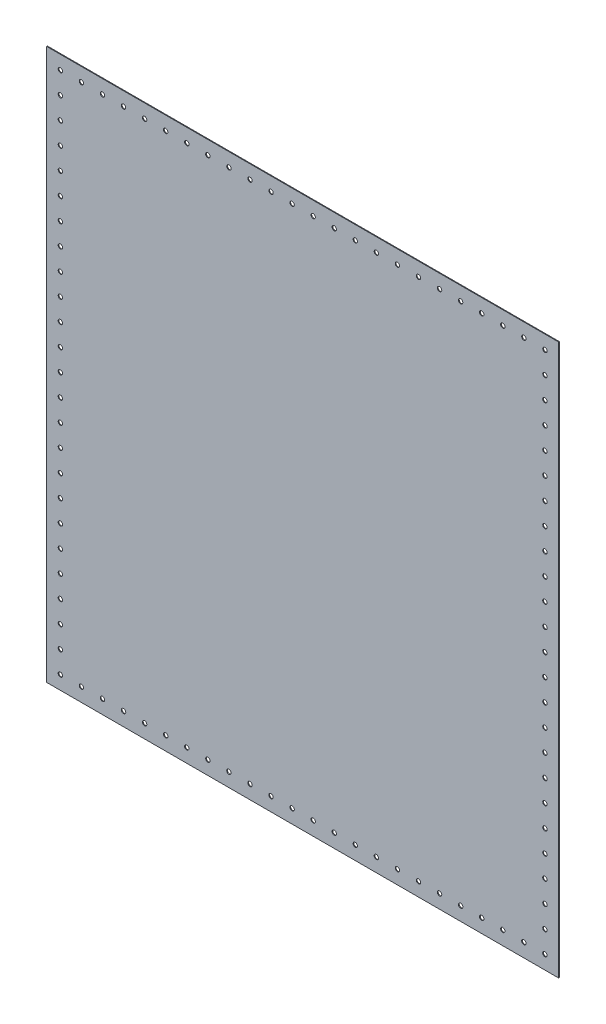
ISO-10303-21;
HEADER;
FILE_DESCRIPTION(('STEP AP214'),'2;1');
FILE_NAME('part.step','',(''),(''),'','','');
FILE_SCHEMA(('AUTOMOTIVE_DESIGN { 1 0 10303 214 1 1 1 1 }'));
ENDSEC;
DATA;
#1=APPLICATION_CONTEXT('core data for automotive mechanical design processes');
#2=APPLICATION_PROTOCOL_DEFINITION('international standard','automotive_design',2000,#1);
#3=PRODUCT_CONTEXT('',#1,'mechanical');
#4=PRODUCT('Part','Part','',(#3));
#5=PRODUCT_RELATED_PRODUCT_CATEGORY('part','',(#4));
#6=PRODUCT_DEFINITION_FORMATION('','',#4);
#7=PRODUCT_DEFINITION_CONTEXT('part definition',#1,'design');
#8=PRODUCT_DEFINITION('design','',#6,#7);
#9=PRODUCT_DEFINITION_SHAPE('','',#8);
#10=(LENGTH_UNIT() NAMED_UNIT(*) SI_UNIT(.MILLI.,.METRE.));
#11=(NAMED_UNIT(*) PLANE_ANGLE_UNIT() SI_UNIT($,.RADIAN.));
#12=(NAMED_UNIT(*) SI_UNIT($,.STERADIAN.) SOLID_ANGLE_UNIT());
#13=UNCERTAINTY_MEASURE_WITH_UNIT(LENGTH_MEASURE(1.E-05),#10,'distance_accuracy_value','');
#14=(GEOMETRIC_REPRESENTATION_CONTEXT(3) GLOBAL_UNCERTAINTY_ASSIGNED_CONTEXT((#13)) GLOBAL_UNIT_ASSIGNED_CONTEXT((#10,
#11,#12)) REPRESENTATION_CONTEXT('',''));
#15=CARTESIAN_POINT('',(0.,0.,0.));
#16=DIRECTION('',(0.,0.,1.));
#17=DIRECTION('',(1.,0.,0.));
#18=AXIS2_PLACEMENT_3D('',#15,#16,#17);
#19=CARTESIAN_POINT('',(-566.4,609.4222,1.5875));
#20=DIRECTION('',(0.,-1.,0.));
#21=DIRECTION('',(1.,0.,0.));
#22=AXIS2_PLACEMENT_3D('',#19,#20,#21);
#23=PLANE('',#22);
#24=DIRECTION('',(-1.,0.,0.));
#25=VECTOR('',#24,1.);
#26=CARTESIAN_POINT('',(-566.4,609.4222,0.));
#27=LINE('',#26,#25);
#28=CARTESIAN_POINT('',(566.4,609.4222,0.));
#29=VERTEX_POINT('',#28);
#30=CARTESIAN_POINT('',(-566.4,609.4222,0.));
#31=VERTEX_POINT('',#30);
#32=EDGE_CURVE('E114',#29,#31,#27,.T.);
#33=ORIENTED_EDGE('',*,*,#32,.T.);
#34=DIRECTION('',(0.,0.,-1.));
#35=VECTOR('',#34,1.);
#36=CARTESIAN_POINT('',(-566.4,609.4222,1.5875));
#37=LINE('',#36,#35);
#38=CARTESIAN_POINT('',(-566.4,609.4222,1.5875));
#39=VERTEX_POINT('',#38);
#40=EDGE_CURVE('E11',#39,#31,#37,.T.);
#41=ORIENTED_EDGE('',*,*,#40,.F.);
#42=DIRECTION('',(-1.,0.,0.));
#43=VECTOR('',#42,1.);
#44=CARTESIAN_POINT('',(-566.4,609.4222,1.5875));
#45=LINE('',#44,#43);
#46=CARTESIAN_POINT('',(566.4,609.4222,1.5875));
#47=VERTEX_POINT('',#46);
#48=EDGE_CURVE('E100',#47,#39,#45,.T.);
#49=ORIENTED_EDGE('',*,*,#48,.F.);
#50=DIRECTION('',(0.,0.,-1.));
#51=VECTOR('',#50,1.);
#52=CARTESIAN_POINT('',(566.4,609.4222,1.5875));
#53=LINE('',#52,#51);
#54=EDGE_CURVE('E108',#47,#29,#53,.T.);
#55=ORIENTED_EDGE('',*,*,#54,.T.);
#56=EDGE_LOOP('',(#33,#41,#49,#55));
#57=FACE_BOUND('',#56,.T.);
#58=ADVANCED_FACE('F44',(#57),#23,.F.);
#59=CARTESIAN_POINT('',(-566.4,-609.4222,1.5875));
#60=DIRECTION('',(1.,0.,0.));
#61=DIRECTION('',(0.,0.,-1.));
#62=AXIS2_PLACEMENT_3D('',#59,#60,#61);
#63=PLANE('',#62);
#64=DIRECTION('',(0.,-1.,0.));
#65=VECTOR('',#64,1.);
#66=CARTESIAN_POINT('',(-566.4,-609.4222,0.));
#67=LINE('',#66,#65);
#68=CARTESIAN_POINT('',(-566.4,-609.4222,0.));
#69=VERTEX_POINT('',#68);
#70=EDGE_CURVE('E105',#31,#69,#67,.T.);
#71=ORIENTED_EDGE('',*,*,#70,.T.);
#72=DIRECTION('',(0.,0.,-1.));
#73=VECTOR('',#72,1.);
#74=CARTESIAN_POINT('',(-566.4,-609.4222,1.5875));
#75=LINE('',#74,#73);
#76=CARTESIAN_POINT('',(-566.4,-609.4222,1.5875));
#77=VERTEX_POINT('',#76);
#78=EDGE_CURVE('E53',#77,#69,#75,.T.);
#79=ORIENTED_EDGE('',*,*,#78,.F.);
#80=DIRECTION('',(0.,-1.,0.));
#81=VECTOR('',#80,1.);
#82=CARTESIAN_POINT('',(-566.4,-609.4222,1.5875));
#83=LINE('',#82,#81);
#84=EDGE_CURVE('E95',#39,#77,#83,.T.);
#85=ORIENTED_EDGE('',*,*,#84,.F.);
#86=ORIENTED_EDGE('',*,*,#40,.T.);
#87=EDGE_LOOP('',(#71,#79,#85,#86));
#88=FACE_BOUND('',#87,.T.);
#89=ADVANCED_FACE('F101',(#88),#63,.F.);
#90=CARTESIAN_POINT('',(-566.4,-609.4222,1.5875));
#91=DIRECTION('',(0.,1.,0.));
#92=DIRECTION('',(0.,0.,1.));
#93=AXIS2_PLACEMENT_3D('',#90,#91,#92);
#94=PLANE('',#93);
#95=DIRECTION('',(1.,0.,0.));
#96=VECTOR('',#95,1.);
#97=CARTESIAN_POINT('',(-566.4,-609.4222,0.));
#98=LINE('',#97,#96);
#99=CARTESIAN_POINT('',(566.4,-609.4222,0.));
#100=VERTEX_POINT('',#99);
#101=EDGE_CURVE('E80',#69,#100,#98,.T.);
#102=ORIENTED_EDGE('',*,*,#101,.T.);
#103=DIRECTION('',(0.,0.,-1.));
#104=VECTOR('',#103,1.);
#105=CARTESIAN_POINT('',(566.4,-609.4222,1.5875));
#106=LINE('',#105,#104);
#107=CARTESIAN_POINT('',(566.4,-609.4222,1.5875));
#108=VERTEX_POINT('',#107);
#109=EDGE_CURVE('E102',#108,#100,#106,.T.);
#110=ORIENTED_EDGE('',*,*,#109,.F.);
#111=DIRECTION('',(1.,0.,0.));
#112=VECTOR('',#111,1.);
#113=CARTESIAN_POINT('',(-566.4,-609.4222,1.5875));
#114=LINE('',#113,#112);
#115=EDGE_CURVE('E92',#77,#108,#114,.T.);
#116=ORIENTED_EDGE('',*,*,#115,.F.);
#117=ORIENTED_EDGE('',*,*,#78,.T.);
#118=EDGE_LOOP('',(#102,#110,#116,#117));
#119=FACE_BOUND('',#118,.T.);
#120=ADVANCED_FACE('F104',(#119),#94,.F.);
#121=CARTESIAN_POINT('',(566.4,-609.4222,1.5875));
#122=DIRECTION('',(-1.,0.,0.));
#123=DIRECTION('',(0.,0.,1.));
#124=AXIS2_PLACEMENT_3D('',#121,#122,#123);
#125=PLANE('',#124);
#126=DIRECTION('',(0.,1.,0.));
#127=VECTOR('',#126,1.);
#128=CARTESIAN_POINT('',(566.4,-609.4222,0.));
#129=LINE('',#128,#127);
#130=EDGE_CURVE('E81',#100,#29,#129,.T.);
#131=ORIENTED_EDGE('',*,*,#130,.T.);
#132=ORIENTED_EDGE('',*,*,#54,.F.);
#133=DIRECTION('',(0.,1.,0.));
#134=VECTOR('',#133,1.);
#135=CARTESIAN_POINT('',(566.4,-609.4222,1.5875));
#136=LINE('',#135,#134);
#137=EDGE_CURVE('E64',#108,#47,#136,.T.);
#138=ORIENTED_EDGE('',*,*,#137,.F.);
#139=ORIENTED_EDGE('',*,*,#109,.T.);
#140=EDGE_LOOP('',(#131,#132,#138,#139));
#141=FACE_BOUND('',#140,.T.);
#142=ADVANCED_FACE('F130',(#141),#125,.F.);
#143=CARTESIAN_POINT('',(0.,0.,1.5875));
#144=DIRECTION('',(0.,0.,1.));
#145=DIRECTION('',(1.,0.,0.));
#146=AXIS2_PLACEMENT_3D('',#143,#144,#145);
#147=PLANE('',#146);
#148=CARTESIAN_POINT('',(-536.097799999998,289.56,1.5875));
#149=DIRECTION('',(0.,0.,1.));
#150=DIRECTION('',(1.,0.,0.));
#151=AXIS2_PLACEMENT_3D('',#148,#149,#150);
#152=CIRCLE('',#151,4.826);
#153=CARTESIAN_POINT('',(-531.271799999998,289.56,1.5875));
#154=VERTEX_POINT('',#153);
#155=EDGE_CURVE('E119',#154,#154,#152,.F.);
#156=ORIENTED_EDGE('',*,*,#155,.T.);
#157=EDGE_LOOP('',(#156));
#158=FACE_BOUND('',#157,.T.);
#159=CARTESIAN_POINT('',(-536.097799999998,337.82,1.5875));
#160=DIRECTION('',(0.,0.,1.));
#161=DIRECTION('',(1.,0.,0.));
#162=AXIS2_PLACEMENT_3D('',#159,#160,#161);
#163=CIRCLE('',#162,4.826);
#164=CARTESIAN_POINT('',(-531.271799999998,337.82,1.5875));
#165=VERTEX_POINT('',#164);
#166=EDGE_CURVE('E140',#165,#165,#163,.F.);
#167=ORIENTED_EDGE('',*,*,#166,.T.);
#168=EDGE_LOOP('',(#167));
#169=FACE_BOUND('',#168,.T.);
#170=CARTESIAN_POINT('',(536.0978,579.12,1.5875));
#171=DIRECTION('',(0.,0.,1.));
#172=DIRECTION('',(1.,0.,0.));
#173=AXIS2_PLACEMENT_3D('',#170,#171,#172);
#174=CIRCLE('',#173,4.826);
#175=CARTESIAN_POINT('',(540.9238,579.12,1.5875));
#176=VERTEX_POINT('',#175);
#177=EDGE_CURVE('E143',#176,#176,#174,.F.);
#178=ORIENTED_EDGE('',*,*,#177,.T.);
#179=EDGE_LOOP('',(#178));
#180=FACE_BOUND('',#179,.T.);
#181=CARTESIAN_POINT('',(536.0978,530.86,1.5875));
#182=DIRECTION('',(0.,0.,1.));
#183=DIRECTION('',(1.,0.,0.));
#184=AXIS2_PLACEMENT_3D('',#181,#182,#183);
#185=CIRCLE('',#184,4.826);
#186=CARTESIAN_POINT('',(540.9238,530.86,1.5875));
#187=VERTEX_POINT('',#186);
#188=EDGE_CURVE('E144',#187,#187,#185,.F.);
#189=ORIENTED_EDGE('',*,*,#188,.T.);
#190=EDGE_LOOP('',(#189));
#191=FACE_BOUND('',#190,.T.);
#192=CARTESIAN_POINT('',(-536.097799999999,482.6,1.5875));
#193=DIRECTION('',(0.,0.,1.));
#194=DIRECTION('',(1.,0.,0.));
#195=AXIS2_PLACEMENT_3D('',#192,#193,#194);
#196=CIRCLE('',#195,4.826);
#197=CARTESIAN_POINT('',(-531.271799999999,482.6,1.5875));
#198=VERTEX_POINT('',#197);
#199=EDGE_CURVE('E149',#198,#198,#196,.F.);
#200=ORIENTED_EDGE('',*,*,#199,.T.);
#201=EDGE_LOOP('',(#200));
#202=FACE_BOUND('',#201,.T.);
#203=CARTESIAN_POINT('',(-536.0978,530.86,1.5875));
#204=DIRECTION('',(0.,0.,1.));
#205=DIRECTION('',(1.,0.,0.));
#206=AXIS2_PLACEMENT_3D('',#203,#204,#205);
#207=CIRCLE('',#206,4.826);
#208=CARTESIAN_POINT('',(-531.2718,530.86,1.5875));
#209=VERTEX_POINT('',#208);
#210=EDGE_CURVE('E153',#209,#209,#207,.F.);
#211=ORIENTED_EDGE('',*,*,#210,.T.);
#212=EDGE_LOOP('',(#211));
#213=FACE_BOUND('',#212,.T.);
#214=CARTESIAN_POINT('',(536.0978,-386.08,1.5875));
#215=DIRECTION('',(0.,0.,1.));
#216=DIRECTION('',(1.,0.,0.));
#217=AXIS2_PLACEMENT_3D('',#214,#215,#216);
#218=CIRCLE('',#217,4.826);
#219=CARTESIAN_POINT('',(540.9238,-386.08,1.5875));
#220=VERTEX_POINT('',#219);
#221=EDGE_CURVE('E160',#220,#220,#218,.F.);
#222=ORIENTED_EDGE('',*,*,#221,.T.);
#223=EDGE_LOOP('',(#222));
#224=FACE_BOUND('',#223,.T.);
#225=CARTESIAN_POINT('',(536.0978,-434.34,1.5875));
#226=DIRECTION('',(0.,0.,1.));
#227=DIRECTION('',(1.,0.,0.));
#228=AXIS2_PLACEMENT_3D('',#225,#226,#227);
#229=CIRCLE('',#228,4.826);
#230=CARTESIAN_POINT('',(540.9238,-434.34,1.5875));
#231=VERTEX_POINT('',#230);
#232=EDGE_CURVE('E161',#231,#231,#229,.F.);
#233=ORIENTED_EDGE('',*,*,#232,.T.);
#234=EDGE_LOOP('',(#233));
#235=FACE_BOUND('',#234,.T.);
#236=CARTESIAN_POINT('',(536.0978,482.6,1.5875));
#237=DIRECTION('',(0.,0.,1.));
#238=DIRECTION('',(1.,0.,0.));
#239=AXIS2_PLACEMENT_3D('',#236,#237,#238);
#240=CIRCLE('',#239,4.826);
#241=CARTESIAN_POINT('',(540.9238,482.6,1.5875));
#242=VERTEX_POINT('',#241);
#243=EDGE_CURVE('E164',#242,#242,#240,.F.);
#244=ORIENTED_EDGE('',*,*,#243,.T.);
#245=EDGE_LOOP('',(#244));
#246=FACE_BOUND('',#245,.T.);
#247=CARTESIAN_POINT('',(536.0978,434.34,1.5875));
#248=DIRECTION('',(0.,0.,1.));
#249=DIRECTION('',(1.,0.,0.));
#250=AXIS2_PLACEMENT_3D('',#247,#248,#249);
#251=CIRCLE('',#250,4.826);
#252=CARTESIAN_POINT('',(540.9238,434.34,1.5875));
#253=VERTEX_POINT('',#252);
#254=EDGE_CURVE('E166',#253,#253,#251,.F.);
#255=ORIENTED_EDGE('',*,*,#254,.T.);
#256=EDGE_LOOP('',(#255));
#257=FACE_BOUND('',#256,.T.);
#258=CARTESIAN_POINT('',(536.0978,193.04,1.5875));
#259=DIRECTION('',(0.,0.,1.));
#260=DIRECTION('',(1.,0.,0.));
#261=AXIS2_PLACEMENT_3D('',#258,#259,#260);
#262=CIRCLE('',#261,4.826);
#263=CARTESIAN_POINT('',(540.9238,193.04,1.5875));
#264=VERTEX_POINT('',#263);
#265=EDGE_CURVE('E172',#264,#264,#262,.F.);
#266=ORIENTED_EDGE('',*,*,#265,.T.);
#267=EDGE_LOOP('',(#266));
#268=FACE_BOUND('',#267,.T.);
#269=CARTESIAN_POINT('',(536.0978,144.78,1.5875));
#270=DIRECTION('',(0.,0.,1.));
#271=DIRECTION('',(1.,0.,0.));
#272=AXIS2_PLACEMENT_3D('',#269,#270,#271);
#273=CIRCLE('',#272,4.826);
#274=CARTESIAN_POINT('',(540.9238,144.78,1.5875));
#275=VERTEX_POINT('',#274);
#276=EDGE_CURVE('E180',#275,#275,#273,.F.);
#277=ORIENTED_EDGE('',*,*,#276,.T.);
#278=EDGE_LOOP('',(#277));
#279=FACE_BOUND('',#278,.T.);
#280=CARTESIAN_POINT('',(536.0978,289.56,1.5875));
#281=DIRECTION('',(0.,0.,1.));
#282=DIRECTION('',(1.,0.,0.));
#283=AXIS2_PLACEMENT_3D('',#280,#281,#282);
#284=CIRCLE('',#283,4.826);
#285=CARTESIAN_POINT('',(540.9238,289.56,1.5875));
#286=VERTEX_POINT('',#285);
#287=EDGE_CURVE('E182',#286,#286,#284,.F.);
#288=ORIENTED_EDGE('',*,*,#287,.T.);
#289=EDGE_LOOP('',(#288));
#290=FACE_BOUND('',#289,.T.);
#291=CARTESIAN_POINT('',(536.0978,241.3,1.5875));
#292=DIRECTION('',(0.,0.,1.));
#293=DIRECTION('',(1.,0.,0.));
#294=AXIS2_PLACEMENT_3D('',#291,#292,#293);
#295=CIRCLE('',#294,4.826);
#296=CARTESIAN_POINT('',(540.9238,241.3,1.5875));
#297=VERTEX_POINT('',#296);
#298=EDGE_CURVE('E183',#297,#297,#295,.F.);
#299=ORIENTED_EDGE('',*,*,#298,.T.);
#300=EDGE_LOOP('',(#299));
#301=FACE_BOUND('',#300,.T.);
#302=CARTESIAN_POINT('',(-536.097799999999,386.08,1.5875));
#303=DIRECTION('',(0.,0.,1.));
#304=DIRECTION('',(1.,0.,0.));
#305=AXIS2_PLACEMENT_3D('',#302,#303,#304);
#306=CIRCLE('',#305,4.826);
#307=CARTESIAN_POINT('',(-531.271799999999,386.08,1.5875));
#308=VERTEX_POINT('',#307);
#309=EDGE_CURVE('E190',#308,#308,#306,.F.);
#310=ORIENTED_EDGE('',*,*,#309,.T.);
#311=EDGE_LOOP('',(#310));
#312=FACE_BOUND('',#311,.T.);
#313=CARTESIAN_POINT('',(-536.097799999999,434.34,1.5875));
#314=DIRECTION('',(0.,0.,1.));
#315=DIRECTION('',(1.,0.,0.));
#316=AXIS2_PLACEMENT_3D('',#313,#314,#315);
#317=CIRCLE('',#316,4.826);
#318=CARTESIAN_POINT('',(-531.271799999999,434.34,1.5875));
#319=VERTEX_POINT('',#318);
#320=EDGE_CURVE('E193',#319,#319,#317,.F.);
#321=ORIENTED_EDGE('',*,*,#320,.T.);
#322=EDGE_LOOP('',(#321));
#323=FACE_BOUND('',#322,.T.);
#324=CARTESIAN_POINT('',(536.0978,-96.5199999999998,1.5875));
#325=DIRECTION('',(0.,0.,1.));
#326=DIRECTION('',(1.,0.,0.));
#327=AXIS2_PLACEMENT_3D('',#324,#325,#326);
#328=CIRCLE('',#327,4.826);
#329=CARTESIAN_POINT('',(540.9238,-96.5199999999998,1.5875));
#330=VERTEX_POINT('',#329);
#331=EDGE_CURVE('E197',#330,#330,#328,.F.);
#332=ORIENTED_EDGE('',*,*,#331,.T.);
#333=EDGE_LOOP('',(#332));
#334=FACE_BOUND('',#333,.T.);
#335=CARTESIAN_POINT('',(536.0978,-241.3,1.5875));
#336=DIRECTION('',(0.,0.,1.));
#337=DIRECTION('',(1.,0.,0.));
#338=AXIS2_PLACEMENT_3D('',#335,#336,#337);
#339=CIRCLE('',#338,4.826);
#340=CARTESIAN_POINT('',(540.9238,-241.3,1.5875));
#341=VERTEX_POINT('',#340);
#342=EDGE_CURVE('E203',#341,#341,#339,.F.);
#343=ORIENTED_EDGE('',*,*,#342,.T.);
#344=EDGE_LOOP('',(#343));
#345=FACE_BOUND('',#344,.T.);
#346=CARTESIAN_POINT('',(536.0978,-193.04,1.5875));
#347=DIRECTION('',(0.,0.,1.));
#348=DIRECTION('',(1.,0.,0.));
#349=AXIS2_PLACEMENT_3D('',#346,#347,#348);
#350=CIRCLE('',#349,4.826);
#351=CARTESIAN_POINT('',(540.9238,-193.04,1.5875));
#352=VERTEX_POINT('',#351);
#353=EDGE_CURVE('E202',#352,#352,#350,.F.);
#354=ORIENTED_EDGE('',*,*,#353,.T.);
#355=EDGE_LOOP('',(#354));
#356=FACE_BOUND('',#355,.T.);
#357=CARTESIAN_POINT('',(536.0978,48.2600000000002,1.5875));
#358=DIRECTION('',(0.,0.,1.));
#359=DIRECTION('',(1.,0.,0.));
#360=AXIS2_PLACEMENT_3D('',#357,#358,#359);
#361=CIRCLE('',#360,4.826);
#362=CARTESIAN_POINT('',(540.9238,48.2600000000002,1.5875));
#363=VERTEX_POINT('',#362);
#364=EDGE_CURVE('E207',#363,#363,#361,.F.);
#365=ORIENTED_EDGE('',*,*,#364,.T.);
#366=EDGE_LOOP('',(#365));
#367=FACE_BOUND('',#366,.T.);
#368=CARTESIAN_POINT('',(256.3946,-579.120000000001,1.5875));
#369=DIRECTION('',(0.,0.,1.));
#370=DIRECTION('',(1.,0.,0.));
#371=AXIS2_PLACEMENT_3D('',#368,#369,#370);
#372=CIRCLE('',#371,4.826);
#373=CARTESIAN_POINT('',(261.2206,-579.120000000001,1.5875));
#374=VERTEX_POINT('',#373);
#375=EDGE_CURVE('E213',#374,#374,#372,.F.);
#376=ORIENTED_EDGE('',*,*,#375,.T.);
#377=EDGE_LOOP('',(#376));
#378=FACE_BOUND('',#377,.T.);
#379=CARTESIAN_POINT('',(396.2462,-579.12,1.5875));
#380=DIRECTION('',(0.,0.,1.));
#381=DIRECTION('',(1.,0.,0.));
#382=AXIS2_PLACEMENT_3D('',#379,#380,#381);
#383=CIRCLE('',#382,4.826);
#384=CARTESIAN_POINT('',(401.0722,-579.12,1.5875));
#385=VERTEX_POINT('',#384);
#386=EDGE_CURVE('E220',#385,#385,#383,.F.);
#387=ORIENTED_EDGE('',*,*,#386,.T.);
#388=EDGE_LOOP('',(#387));
#389=FACE_BOUND('',#388,.T.);
#390=CARTESIAN_POINT('',(349.629,-579.12,1.5875));
#391=DIRECTION('',(0.,0.,1.));
#392=DIRECTION('',(1.,0.,0.));
#393=AXIS2_PLACEMENT_3D('',#390,#391,#392);
#394=CIRCLE('',#393,4.826);
#395=CARTESIAN_POINT('',(354.455,-579.12,1.5875));
#396=VERTEX_POINT('',#395);
#397=EDGE_CURVE('E222',#396,#396,#394,.F.);
#398=ORIENTED_EDGE('',*,*,#397,.T.);
#399=EDGE_LOOP('',(#398));
#400=FACE_BOUND('',#399,.T.);
#401=CARTESIAN_POINT('',(536.0978,-144.78,1.5875));
#402=DIRECTION('',(0.,0.,1.));
#403=DIRECTION('',(1.,0.,0.));
#404=AXIS2_PLACEMENT_3D('',#401,#402,#403);
#405=CIRCLE('',#404,4.826);
#406=CARTESIAN_POINT('',(540.9238,-144.78,1.5875));
#407=VERTEX_POINT('',#406);
#408=EDGE_CURVE('E223',#407,#407,#405,.F.);
#409=ORIENTED_EDGE('',*,*,#408,.T.);
#410=EDGE_LOOP('',(#409));
#411=FACE_BOUND('',#410,.T.);
#412=CARTESIAN_POINT('',(536.0978,-482.6,1.5875));
#413=DIRECTION('',(0.,0.,1.));
#414=DIRECTION('',(1.,0.,0.));
#415=AXIS2_PLACEMENT_3D('',#412,#413,#414);
#416=CIRCLE('',#415,4.826);
#417=CARTESIAN_POINT('',(540.9238,-482.6,1.5875));
#418=VERTEX_POINT('',#417);
#419=EDGE_CURVE('E230',#418,#418,#416,.F.);
#420=ORIENTED_EDGE('',*,*,#419,.T.);
#421=EDGE_LOOP('',(#420));
#422=FACE_BOUND('',#421,.T.);
#423=CARTESIAN_POINT('',(-536.0978,579.12,1.5875));
#424=DIRECTION('',(0.,0.,1.));
#425=DIRECTION('',(1.,0.,0.));
#426=AXIS2_PLACEMENT_3D('',#423,#424,#425);
#427=CIRCLE('',#426,4.826);
#428=CARTESIAN_POINT('',(-531.2718,579.12,1.5875));
#429=VERTEX_POINT('',#428);
#430=EDGE_CURVE('E233',#429,#429,#427,.F.);
#431=ORIENTED_EDGE('',*,*,#430,.T.);
#432=EDGE_LOOP('',(#431));
#433=FACE_BOUND('',#432,.T.);
#434=CARTESIAN_POINT('',(536.0978,-337.82,1.5875));
#435=DIRECTION('',(0.,0.,1.));
#436=DIRECTION('',(1.,0.,0.));
#437=AXIS2_PLACEMENT_3D('',#434,#435,#436);
#438=CIRCLE('',#437,4.826);
#439=CARTESIAN_POINT('',(540.9238,-337.82,1.5875));
#440=VERTEX_POINT('',#439);
#441=EDGE_CURVE('E240',#440,#440,#438,.F.);
#442=ORIENTED_EDGE('',*,*,#441,.T.);
#443=EDGE_LOOP('',(#442));
#444=FACE_BOUND('',#443,.T.);
#445=CARTESIAN_POINT('',(536.0978,-289.56,1.5875));
#446=DIRECTION('',(0.,0.,1.));
#447=DIRECTION('',(1.,0.,0.));
#448=AXIS2_PLACEMENT_3D('',#445,#446,#447);
#449=CIRCLE('',#448,4.826);
#450=CARTESIAN_POINT('',(540.9238,-289.56,1.5875));
#451=VERTEX_POINT('',#450);
#452=EDGE_CURVE('E243',#451,#451,#449,.F.);
#453=ORIENTED_EDGE('',*,*,#452,.T.);
#454=EDGE_LOOP('',(#453));
#455=FACE_BOUND('',#454,.T.);
#456=CARTESIAN_POINT('',(536.0978,96.5200000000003,1.5875));
#457=DIRECTION('',(0.,0.,1.));
#458=DIRECTION('',(1.,0.,0.));
#459=AXIS2_PLACEMENT_3D('',#456,#457,#458);
#460=CIRCLE('',#459,4.826);
#461=CARTESIAN_POINT('',(540.9238,96.5200000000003,1.5875));
#462=VERTEX_POINT('',#461);
#463=EDGE_CURVE('E241',#462,#462,#460,.F.);
#464=ORIENTED_EDGE('',*,*,#463,.T.);
#465=EDGE_LOOP('',(#464));
#466=FACE_BOUND('',#465,.T.);
#467=CARTESIAN_POINT('',(536.0978,-48.2599999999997,1.5875));
#468=DIRECTION('',(0.,0.,1.));
#469=DIRECTION('',(1.,0.,0.));
#470=AXIS2_PLACEMENT_3D('',#467,#468,#469);
#471=CIRCLE('',#470,4.826);
#472=CARTESIAN_POINT('',(540.9238,-48.2599999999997,1.5875));
#473=VERTEX_POINT('',#472);
#474=EDGE_CURVE('E249',#473,#473,#471,.F.);
#475=ORIENTED_EDGE('',*,*,#474,.T.);
#476=EDGE_LOOP('',(#475));
#477=FACE_BOUND('',#476,.T.);
#478=CARTESIAN_POINT('',(536.0978,2.22044604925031E-13,1.5875));
#479=DIRECTION('',(0.,0.,1.));
#480=DIRECTION('',(1.,0.,0.));
#481=AXIS2_PLACEMENT_3D('',#478,#479,#480);
#482=CIRCLE('',#481,4.826);
#483=CARTESIAN_POINT('',(540.9238,2.22044604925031E-13,1.5875));
#484=VERTEX_POINT('',#483);
#485=EDGE_CURVE('E251',#484,#484,#482,.F.);
#486=ORIENTED_EDGE('',*,*,#485,.T.);
#487=EDGE_LOOP('',(#486));
#488=FACE_BOUND('',#487,.T.);
#489=CARTESIAN_POINT('',(536.0978,-530.86,1.5875));
#490=DIRECTION('',(0.,0.,1.));
#491=DIRECTION('',(1.,0.,0.));
#492=AXIS2_PLACEMENT_3D('',#489,#490,#491);
#493=CIRCLE('',#492,4.826);
#494=CARTESIAN_POINT('',(540.9238,-530.86,1.5875));
#495=VERTEX_POINT('',#494);
#496=EDGE_CURVE('E260',#495,#495,#493,.F.);
#497=ORIENTED_EDGE('',*,*,#496,.T.);
#498=EDGE_LOOP('',(#497));
#499=FACE_BOUND('',#498,.T.);
#500=CARTESIAN_POINT('',(489.4806,579.120000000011,1.5875));
#501=DIRECTION('',(0.,0.,1.));
#502=DIRECTION('',(1.,0.,0.));
#503=AXIS2_PLACEMENT_3D('',#500,#501,#502);
#504=CIRCLE('',#503,4.826);
#505=CARTESIAN_POINT('',(494.3066,579.120000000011,1.5875));
#506=VERTEX_POINT('',#505);
#507=EDGE_CURVE('E261',#506,#506,#504,.F.);
#508=ORIENTED_EDGE('',*,*,#507,.T.);
#509=EDGE_LOOP('',(#508));
#510=FACE_BOUND('',#509,.T.);
#511=CARTESIAN_POINT('',(442.8634,579.12000000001,1.5875));
#512=DIRECTION('',(0.,0.,1.));
#513=DIRECTION('',(1.,0.,0.));
#514=AXIS2_PLACEMENT_3D('',#511,#512,#513);
#515=CIRCLE('',#514,4.826);
#516=CARTESIAN_POINT('',(447.6894,579.12000000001,1.5875));
#517=VERTEX_POINT('',#516);
#518=EDGE_CURVE('E264',#517,#517,#515,.F.);
#519=ORIENTED_EDGE('',*,*,#518,.T.);
#520=EDGE_LOOP('',(#519));
#521=FACE_BOUND('',#520,.T.);
#522=CARTESIAN_POINT('',(303.0118,579.120000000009,1.5875));
#523=DIRECTION('',(0.,0.,1.));
#524=DIRECTION('',(1.,0.,0.));
#525=AXIS2_PLACEMENT_3D('',#522,#523,#524);
#526=CIRCLE('',#525,4.826);
#527=CARTESIAN_POINT('',(307.8378,579.120000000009,1.5875));
#528=VERTEX_POINT('',#527);
#529=EDGE_CURVE('E267',#528,#528,#526,.F.);
#530=ORIENTED_EDGE('',*,*,#529,.T.);
#531=EDGE_LOOP('',(#530));
#532=FACE_BOUND('',#531,.T.);
#533=CARTESIAN_POINT('',(256.3946,579.120000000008,1.5875));
#534=DIRECTION('',(0.,0.,1.));
#535=DIRECTION('',(1.,0.,0.));
#536=AXIS2_PLACEMENT_3D('',#533,#534,#535);
#537=CIRCLE('',#536,4.826);
#538=CARTESIAN_POINT('',(261.2206,579.120000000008,1.5875));
#539=VERTEX_POINT('',#538);
#540=EDGE_CURVE('E272',#539,#539,#537,.F.);
#541=ORIENTED_EDGE('',*,*,#540,.T.);
#542=EDGE_LOOP('',(#541));
#543=FACE_BOUND('',#542,.T.);
#544=CARTESIAN_POINT('',(396.2462,579.12000000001,1.5875));
#545=DIRECTION('',(0.,0.,1.));
#546=DIRECTION('',(1.,0.,0.));
#547=AXIS2_PLACEMENT_3D('',#544,#545,#546);
#548=CIRCLE('',#547,4.826);
#549=CARTESIAN_POINT('',(401.0722,579.12000000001,1.5875));
#550=VERTEX_POINT('',#549);
#551=EDGE_CURVE('E280',#550,#550,#548,.F.);
#552=ORIENTED_EDGE('',*,*,#551,.T.);
#553=EDGE_LOOP('',(#552));
#554=FACE_BOUND('',#553,.T.);
#555=CARTESIAN_POINT('',(349.629,579.120000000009,1.5875));
#556=DIRECTION('',(0.,0.,1.));
#557=DIRECTION('',(1.,0.,0.));
#558=AXIS2_PLACEMENT_3D('',#555,#556,#557);
#559=CIRCLE('',#558,4.826);
#560=CARTESIAN_POINT('',(354.455,579.120000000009,1.5875));
#561=VERTEX_POINT('',#560);
#562=EDGE_CURVE('E283',#561,#561,#559,.F.);
#563=ORIENTED_EDGE('',*,*,#562,.T.);
#564=EDGE_LOOP('',(#563));
#565=FACE_BOUND('',#564,.T.);
#566=CARTESIAN_POINT('',(-396.2462,-579.120000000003,1.5875));
#567=DIRECTION('',(0.,0.,1.));
#568=DIRECTION('',(1.,0.,0.));
#569=AXIS2_PLACEMENT_3D('',#566,#567,#568);
#570=CIRCLE('',#569,4.826);
#571=CARTESIAN_POINT('',(-391.4202,-579.120000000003,1.5875));
#572=VERTEX_POINT('',#571);
#573=EDGE_CURVE('E281',#572,#572,#570,.F.);
#574=ORIENTED_EDGE('',*,*,#573,.T.);
#575=EDGE_LOOP('',(#574));
#576=FACE_BOUND('',#575,.T.);
#577=CARTESIAN_POINT('',(-349.629,-579.120000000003,1.5875));
#578=DIRECTION('',(0.,0.,1.));
#579=DIRECTION('',(1.,0.,0.));
#580=AXIS2_PLACEMENT_3D('',#577,#578,#579);
#581=CIRCLE('',#580,4.826);
#582=CARTESIAN_POINT('',(-344.803,-579.120000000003,1.5875));
#583=VERTEX_POINT('',#582);
#584=EDGE_CURVE('E289',#583,#583,#581,.F.);
#585=ORIENTED_EDGE('',*,*,#584,.T.);
#586=EDGE_LOOP('',(#585));
#587=FACE_BOUND('',#586,.T.);
#588=CARTESIAN_POINT('',(-23.3086000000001,579.120000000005,1.5875));
#589=DIRECTION('',(0.,0.,1.));
#590=DIRECTION('',(1.,0.,0.));
#591=AXIS2_PLACEMENT_3D('',#588,#589,#590);
#592=CIRCLE('',#591,4.826);
#593=CARTESIAN_POINT('',(-18.4826000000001,579.120000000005,1.5875));
#594=VERTEX_POINT('',#593);
#595=EDGE_CURVE('E291',#594,#594,#592,.F.);
#596=ORIENTED_EDGE('',*,*,#595,.T.);
#597=EDGE_LOOP('',(#596));
#598=FACE_BOUND('',#597,.T.);
#599=CARTESIAN_POINT('',(23.3085999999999,579.120000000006,1.5875));
#600=DIRECTION('',(0.,0.,1.));
#601=DIRECTION('',(1.,0.,0.));
#602=AXIS2_PLACEMENT_3D('',#599,#600,#601);
#603=CIRCLE('',#602,4.826);
#604=CARTESIAN_POINT('',(28.1345999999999,579.120000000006,1.5875));
#605=VERTEX_POINT('',#604);
#606=EDGE_CURVE('E299',#605,#605,#603,.F.);
#607=ORIENTED_EDGE('',*,*,#606,.T.);
#608=EDGE_LOOP('',(#607));
#609=FACE_BOUND('',#608,.T.);
#610=CARTESIAN_POINT('',(-116.543,579.120000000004,1.5875));
#611=DIRECTION('',(0.,0.,1.));
#612=DIRECTION('',(1.,0.,0.));
#613=AXIS2_PLACEMENT_3D('',#610,#611,#612);
#614=CIRCLE('',#613,4.826);
#615=CARTESIAN_POINT('',(-111.717,579.120000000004,1.5875));
#616=VERTEX_POINT('',#615);
#617=EDGE_CURVE('E302',#616,#616,#614,.F.);
#618=ORIENTED_EDGE('',*,*,#617,.T.);
#619=EDGE_LOOP('',(#618));
#620=FACE_BOUND('',#619,.T.);
#621=CARTESIAN_POINT('',(-69.9258000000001,579.120000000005,1.5875));
#622=DIRECTION('',(0.,0.,1.));
#623=DIRECTION('',(1.,0.,0.));
#624=AXIS2_PLACEMENT_3D('',#621,#622,#623);
#625=CIRCLE('',#624,4.826);
#626=CARTESIAN_POINT('',(-65.0998000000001,579.120000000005,1.5875));
#627=VERTEX_POINT('',#626);
#628=EDGE_CURVE('E301',#627,#627,#625,.F.);
#629=ORIENTED_EDGE('',*,*,#628,.T.);
#630=EDGE_LOOP('',(#629));
#631=FACE_BOUND('',#630,.T.);
#632=CARTESIAN_POINT('',(163.1602,579.120000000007,1.5875));
#633=DIRECTION('',(0.,0.,1.));
#634=DIRECTION('',(1.,0.,0.));
#635=AXIS2_PLACEMENT_3D('',#632,#633,#634);
#636=CIRCLE('',#635,4.826);
#637=CARTESIAN_POINT('',(167.9862,579.120000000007,1.5875));
#638=VERTEX_POINT('',#637);
#639=EDGE_CURVE('E310',#638,#638,#636,.F.);
#640=ORIENTED_EDGE('',*,*,#639,.T.);
#641=EDGE_LOOP('',(#640));
#642=FACE_BOUND('',#641,.T.);
#643=CARTESIAN_POINT('',(209.7774,579.120000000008,1.5875));
#644=DIRECTION('',(0.,0.,1.));
#645=DIRECTION('',(1.,0.,0.));
#646=AXIS2_PLACEMENT_3D('',#643,#644,#645);
#647=CIRCLE('',#646,4.826);
#648=CARTESIAN_POINT('',(214.6034,579.120000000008,1.5875));
#649=VERTEX_POINT('',#648);
#650=EDGE_CURVE('E311',#649,#649,#647,.F.);
#651=ORIENTED_EDGE('',*,*,#650,.T.);
#652=EDGE_LOOP('',(#651));
#653=FACE_BOUND('',#652,.T.);
#654=CARTESIAN_POINT('',(69.9257999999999,579.120000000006,1.5875));
#655=DIRECTION('',(0.,0.,1.));
#656=DIRECTION('',(1.,0.,0.));
#657=AXIS2_PLACEMENT_3D('',#654,#655,#656);
#658=CIRCLE('',#657,4.826);
#659=CARTESIAN_POINT('',(74.7517999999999,579.120000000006,1.5875));
#660=VERTEX_POINT('',#659);
#661=EDGE_CURVE('E320',#660,#660,#658,.F.);
#662=ORIENTED_EDGE('',*,*,#661,.T.);
#663=EDGE_LOOP('',(#662));
#664=FACE_BOUND('',#663,.T.);
#665=CARTESIAN_POINT('',(116.543,579.120000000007,1.5875));
#666=DIRECTION('',(0.,0.,1.));
#667=DIRECTION('',(1.,0.,0.));
#668=AXIS2_PLACEMENT_3D('',#665,#666,#667);
#669=CIRCLE('',#668,4.826);
#670=CARTESIAN_POINT('',(121.369,579.120000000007,1.5875));
#671=VERTEX_POINT('',#670);
#672=EDGE_CURVE('E321',#671,#671,#669,.F.);
#673=ORIENTED_EDGE('',*,*,#672,.T.);
#674=EDGE_LOOP('',(#673));
#675=FACE_BOUND('',#674,.T.);
#676=CARTESIAN_POINT('',(-163.1602,579.120000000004,1.5875));
#677=DIRECTION('',(0.,0.,1.));
#678=DIRECTION('',(1.,0.,0.));
#679=AXIS2_PLACEMENT_3D('',#676,#677,#678);
#680=CIRCLE('',#679,4.826);
#681=CARTESIAN_POINT('',(-158.3342,579.120000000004,1.5875));
#682=VERTEX_POINT('',#681);
#683=EDGE_CURVE('E324',#682,#682,#680,.F.);
#684=ORIENTED_EDGE('',*,*,#683,.T.);
#685=EDGE_LOOP('',(#684));
#686=FACE_BOUND('',#685,.T.);
#687=CARTESIAN_POINT('',(-209.7774,579.120000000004,1.5875));
#688=DIRECTION('',(0.,0.,1.));
#689=DIRECTION('',(1.,0.,0.));
#690=AXIS2_PLACEMENT_3D('',#687,#688,#689);
#691=CIRCLE('',#690,4.826);
#692=CARTESIAN_POINT('',(-204.9514,579.120000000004,1.5875));
#693=VERTEX_POINT('',#692);
#694=EDGE_CURVE('E328',#693,#693,#691,.F.);
#695=ORIENTED_EDGE('',*,*,#694,.T.);
#696=EDGE_LOOP('',(#695));
#697=FACE_BOUND('',#696,.T.);
#698=CARTESIAN_POINT('',(-442.8634,579.120000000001,1.5875));
#699=DIRECTION('',(0.,0.,1.));
#700=DIRECTION('',(1.,0.,0.));
#701=AXIS2_PLACEMENT_3D('',#698,#699,#700);
#702=CIRCLE('',#701,4.826);
#703=CARTESIAN_POINT('',(-438.0374,579.120000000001,1.5875));
#704=VERTEX_POINT('',#703);
#705=EDGE_CURVE('E334',#704,#704,#702,.F.);
#706=ORIENTED_EDGE('',*,*,#705,.T.);
#707=EDGE_LOOP('',(#706));
#708=FACE_BOUND('',#707,.T.);
#709=CARTESIAN_POINT('',(-489.4806,579.120000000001,1.5875));
#710=DIRECTION('',(0.,0.,1.));
#711=DIRECTION('',(1.,0.,0.));
#712=AXIS2_PLACEMENT_3D('',#709,#710,#711);
#713=CIRCLE('',#712,4.826);
#714=CARTESIAN_POINT('',(-484.6546,579.120000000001,1.5875));
#715=VERTEX_POINT('',#714);
#716=EDGE_CURVE('E339',#715,#715,#713,.F.);
#717=ORIENTED_EDGE('',*,*,#716,.T.);
#718=EDGE_LOOP('',(#717));
#719=FACE_BOUND('',#718,.T.);
#720=CARTESIAN_POINT('',(-349.629,579.120000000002,1.5875));
#721=DIRECTION('',(0.,0.,1.));
#722=DIRECTION('',(1.,0.,0.));
#723=AXIS2_PLACEMENT_3D('',#720,#721,#722);
#724=CIRCLE('',#723,4.826);
#725=CARTESIAN_POINT('',(-344.803,579.120000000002,1.5875));
#726=VERTEX_POINT('',#725);
#727=EDGE_CURVE('E342',#726,#726,#724,.F.);
#728=ORIENTED_EDGE('',*,*,#727,.T.);
#729=EDGE_LOOP('',(#728));
#730=FACE_BOUND('',#729,.T.);
#731=CARTESIAN_POINT('',(-396.2462,579.120000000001,1.5875));
#732=DIRECTION('',(0.,0.,1.));
#733=DIRECTION('',(1.,0.,0.));
#734=AXIS2_PLACEMENT_3D('',#731,#732,#733);
#735=CIRCLE('',#734,4.826);
#736=CARTESIAN_POINT('',(-391.4202,579.120000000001,1.5875));
#737=VERTEX_POINT('',#736);
#738=EDGE_CURVE('E341',#737,#737,#735,.F.);
#739=ORIENTED_EDGE('',*,*,#738,.T.);
#740=EDGE_LOOP('',(#739));
#741=FACE_BOUND('',#740,.T.);
#742=CARTESIAN_POINT('',(536.0978,386.08,1.5875));
#743=DIRECTION('',(0.,0.,1.));
#744=DIRECTION('',(1.,0.,0.));
#745=AXIS2_PLACEMENT_3D('',#742,#743,#744);
#746=CIRCLE('',#745,4.826);
#747=CARTESIAN_POINT('',(540.9238,386.08,1.5875));
#748=VERTEX_POINT('',#747);
#749=EDGE_CURVE('E349',#748,#748,#746,.F.);
#750=ORIENTED_EDGE('',*,*,#749,.T.);
#751=EDGE_LOOP('',(#750));
#752=FACE_BOUND('',#751,.T.);
#753=CARTESIAN_POINT('',(536.0978,337.82,1.5875));
#754=DIRECTION('',(0.,0.,1.));
#755=DIRECTION('',(1.,0.,0.));
#756=AXIS2_PLACEMENT_3D('',#753,#754,#755);
#757=CIRCLE('',#756,4.826);
#758=CARTESIAN_POINT('',(540.9238,337.82,1.5875));
#759=VERTEX_POINT('',#758);
#760=EDGE_CURVE('E352',#759,#759,#757,.F.);
#761=ORIENTED_EDGE('',*,*,#760,.T.);
#762=EDGE_LOOP('',(#761));
#763=FACE_BOUND('',#762,.T.);
#764=CARTESIAN_POINT('',(-489.4806,-579.120000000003,1.5875));
#765=DIRECTION('',(0.,0.,1.));
#766=DIRECTION('',(1.,0.,0.));
#767=AXIS2_PLACEMENT_3D('',#764,#765,#766);
#768=CIRCLE('',#767,4.826);
#769=CARTESIAN_POINT('',(-484.6546,-579.120000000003,1.5875));
#770=VERTEX_POINT('',#769);
#771=EDGE_CURVE('E360',#770,#770,#768,.F.);
#772=ORIENTED_EDGE('',*,*,#771,.T.);
#773=EDGE_LOOP('',(#772));
#774=FACE_BOUND('',#773,.T.);
#775=CARTESIAN_POINT('',(-442.8634,-579.120000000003,1.5875));
#776=DIRECTION('',(0.,0.,1.));
#777=DIRECTION('',(1.,0.,0.));
#778=AXIS2_PLACEMENT_3D('',#775,#776,#777);
#779=CIRCLE('',#778,4.826);
#780=CARTESIAN_POINT('',(-438.0374,-579.120000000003,1.5875));
#781=VERTEX_POINT('',#780);
#782=EDGE_CURVE('E363',#781,#781,#779,.F.);
#783=ORIENTED_EDGE('',*,*,#782,.T.);
#784=EDGE_LOOP('',(#783));
#785=FACE_BOUND('',#784,.T.);
#786=CARTESIAN_POINT('',(-209.7774,-579.120000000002,1.5875));
#787=DIRECTION('',(0.,0.,1.));
#788=DIRECTION('',(1.,0.,0.));
#789=AXIS2_PLACEMENT_3D('',#786,#787,#788);
#790=CIRCLE('',#789,4.826);
#791=CARTESIAN_POINT('',(-204.9514,-579.120000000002,1.5875));
#792=VERTEX_POINT('',#791);
#793=EDGE_CURVE('E364',#792,#792,#790,.F.);
#794=ORIENTED_EDGE('',*,*,#793,.T.);
#795=EDGE_LOOP('',(#794));
#796=FACE_BOUND('',#795,.T.);
#797=CARTESIAN_POINT('',(-163.1602,-579.120000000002,1.5875));
#798=DIRECTION('',(0.,0.,1.));
#799=DIRECTION('',(1.,0.,0.));
#800=AXIS2_PLACEMENT_3D('',#797,#798,#799);
#801=CIRCLE('',#800,4.826);
#802=CARTESIAN_POINT('',(-158.3342,-579.120000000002,1.5875));
#803=VERTEX_POINT('',#802);
#804=EDGE_CURVE('E369',#803,#803,#801,.F.);
#805=ORIENTED_EDGE('',*,*,#804,.T.);
#806=EDGE_LOOP('',(#805));
#807=FACE_BOUND('',#806,.T.);
#808=CARTESIAN_POINT('',(-303.0118,-579.120000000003,1.5875));
#809=DIRECTION('',(0.,0.,1.));
#810=DIRECTION('',(1.,0.,0.));
#811=AXIS2_PLACEMENT_3D('',#808,#809,#810);
#812=CIRCLE('',#811,4.826);
#813=CARTESIAN_POINT('',(-298.1858,-579.120000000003,1.5875));
#814=VERTEX_POINT('',#813);
#815=EDGE_CURVE('E373',#814,#814,#812,.F.);
#816=ORIENTED_EDGE('',*,*,#815,.T.);
#817=EDGE_LOOP('',(#816));
#818=FACE_BOUND('',#817,.T.);
#819=CARTESIAN_POINT('',(-256.3946,-579.120000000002,1.5875));
#820=DIRECTION('',(0.,0.,1.));
#821=DIRECTION('',(1.,0.,0.));
#822=AXIS2_PLACEMENT_3D('',#819,#820,#821);
#823=CIRCLE('',#822,4.826);
#824=CARTESIAN_POINT('',(-251.5686,-579.120000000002,1.5875));
#825=VERTEX_POINT('',#824);
#826=EDGE_CURVE('E380',#825,#825,#823,.F.);
#827=ORIENTED_EDGE('',*,*,#826,.T.);
#828=EDGE_LOOP('',(#827));
#829=FACE_BOUND('',#828,.T.);
#830=CARTESIAN_POINT('',(-256.3946,579.120000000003,1.5875));
#831=DIRECTION('',(0.,0.,1.));
#832=DIRECTION('',(1.,0.,0.));
#833=AXIS2_PLACEMENT_3D('',#830,#831,#832);
#834=CIRCLE('',#833,4.826);
#835=CARTESIAN_POINT('',(-251.5686,579.120000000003,1.5875));
#836=VERTEX_POINT('',#835);
#837=EDGE_CURVE('E381',#836,#836,#834,.F.);
#838=ORIENTED_EDGE('',*,*,#837,.T.);
#839=EDGE_LOOP('',(#838));
#840=FACE_BOUND('',#839,.T.);
#841=CARTESIAN_POINT('',(-303.0118,579.120000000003,1.5875));
#842=DIRECTION('',(0.,0.,1.));
#843=DIRECTION('',(1.,0.,0.));
#844=AXIS2_PLACEMENT_3D('',#841,#842,#843);
#845=CIRCLE('',#844,4.826);
#846=CARTESIAN_POINT('',(-298.1858,579.120000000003,1.5875));
#847=VERTEX_POINT('',#846);
#848=EDGE_CURVE('E384',#847,#847,#845,.F.);
#849=ORIENTED_EDGE('',*,*,#848,.T.);
#850=EDGE_LOOP('',(#849));
#851=FACE_BOUND('',#850,.T.);
#852=CARTESIAN_POINT('',(-536.097799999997,144.78,1.5875));
#853=DIRECTION('',(0.,0.,1.));
#854=DIRECTION('',(1.,0.,0.));
#855=AXIS2_PLACEMENT_3D('',#852,#853,#854);
#856=CIRCLE('',#855,4.826);
#857=CARTESIAN_POINT('',(-531.271799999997,144.78,1.5875));
#858=VERTEX_POINT('',#857);
#859=EDGE_CURVE('E386',#858,#858,#856,.F.);
#860=ORIENTED_EDGE('',*,*,#859,.T.);
#861=EDGE_LOOP('',(#860));
#862=FACE_BOUND('',#861,.T.);
#863=CARTESIAN_POINT('',(-536.097799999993,-386.08,1.5875));
#864=DIRECTION('',(0.,0.,1.));
#865=DIRECTION('',(1.,0.,0.));
#866=AXIS2_PLACEMENT_3D('',#863,#864,#865);
#867=CIRCLE('',#866,4.826);
#868=CARTESIAN_POINT('',(-531.271799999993,-386.08,1.5875));
#869=VERTEX_POINT('',#868);
#870=EDGE_CURVE('E392',#869,#869,#867,.F.);
#871=ORIENTED_EDGE('',*,*,#870,.T.);
#872=EDGE_LOOP('',(#871));
#873=FACE_BOUND('',#872,.T.);
#874=CARTESIAN_POINT('',(-536.097799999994,-337.82,1.5875));
#875=DIRECTION('',(0.,0.,1.));
#876=DIRECTION('',(1.,0.,0.));
#877=AXIS2_PLACEMENT_3D('',#874,#875,#876);
#878=CIRCLE('',#877,4.826);
#879=CARTESIAN_POINT('',(-531.271799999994,-337.82,1.5875));
#880=VERTEX_POINT('',#879);
#881=EDGE_CURVE('E400',#880,#880,#878,.F.);
#882=ORIENTED_EDGE('',*,*,#881,.T.);
#883=EDGE_LOOP('',(#882));
#884=FACE_BOUND('',#883,.T.);
#885=CARTESIAN_POINT('',(-536.097799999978,-482.599999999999,1.5875));
#886=DIRECTION('',(0.,0.,1.));
#887=DIRECTION('',(1.,0.,0.));
#888=AXIS2_PLACEMENT_3D('',#885,#886,#887);
#889=CIRCLE('',#888,4.82600000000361);
#890=CARTESIAN_POINT('',(-531.271799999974,-482.599999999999,1.5875));
#891=VERTEX_POINT('',#890);
#892=EDGE_CURVE('E402',#891,#891,#889,.F.);
#893=ORIENTED_EDGE('',*,*,#892,.T.);
#894=EDGE_LOOP('',(#893));
#895=FACE_BOUND('',#894,.T.);
#896=CARTESIAN_POINT('',(-536.097799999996,-48.2599999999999,1.5875));
#897=DIRECTION('',(0.,0.,1.));
#898=DIRECTION('',(1.,0.,0.));
#899=AXIS2_PLACEMENT_3D('',#896,#897,#898);
#900=CIRCLE('',#899,4.826);
#901=CARTESIAN_POINT('',(-531.271799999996,-48.2599999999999,1.5875));
#902=VERTEX_POINT('',#901);
#903=EDGE_CURVE('E403',#902,#902,#900,.F.);
#904=ORIENTED_EDGE('',*,*,#903,.T.);
#905=EDGE_LOOP('',(#904));
#906=FACE_BOUND('',#905,.T.);
#907=CARTESIAN_POINT('',(-536.097799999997,193.04,1.5875));
#908=DIRECTION('',(0.,0.,1.));
#909=DIRECTION('',(1.,0.,0.));
#910=AXIS2_PLACEMENT_3D('',#907,#908,#909);
#911=CIRCLE('',#910,4.826);
#912=CARTESIAN_POINT('',(-531.271799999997,193.04,1.5875));
#913=VERTEX_POINT('',#912);
#914=EDGE_CURVE('E410',#913,#913,#911,.F.);
#915=ORIENTED_EDGE('',*,*,#914,.T.);
#916=EDGE_LOOP('',(#915));
#917=FACE_BOUND('',#916,.T.);
#918=CARTESIAN_POINT('',(-536.097799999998,241.3,1.5875));
#919=DIRECTION('',(0.,0.,1.));
#920=DIRECTION('',(1.,0.,0.));
#921=AXIS2_PLACEMENT_3D('',#918,#919,#920);
#922=CIRCLE('',#921,4.826);
#923=CARTESIAN_POINT('',(-531.271799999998,241.3,1.5875));
#924=VERTEX_POINT('',#923);
#925=EDGE_CURVE('E413',#924,#924,#922,.F.);
#926=ORIENTED_EDGE('',*,*,#925,.T.);
#927=EDGE_LOOP('',(#926));
#928=FACE_BOUND('',#927,.T.);
#929=CARTESIAN_POINT('',(-536.097799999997,96.5200000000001,1.5875));
#930=DIRECTION('',(0.,0.,1.));
#931=DIRECTION('',(1.,0.,0.));
#932=AXIS2_PLACEMENT_3D('',#929,#930,#931);
#933=CIRCLE('',#932,4.826);
#934=CARTESIAN_POINT('',(-531.271799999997,96.5200000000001,1.5875));
#935=VERTEX_POINT('',#934);
#936=EDGE_CURVE('E417',#935,#935,#933,.F.);
#937=ORIENTED_EDGE('',*,*,#936,.T.);
#938=EDGE_LOOP('',(#937));
#939=FACE_BOUND('',#938,.T.);
#940=CARTESIAN_POINT('',(-536.097799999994,-241.3,1.5875));
#941=DIRECTION('',(0.,0.,1.));
#942=DIRECTION('',(1.,0.,0.));
#943=AXIS2_PLACEMENT_3D('',#940,#941,#942);
#944=CIRCLE('',#943,4.826);
#945=CARTESIAN_POINT('',(-531.271799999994,-241.3,1.5875));
#946=VERTEX_POINT('',#945);
#947=EDGE_CURVE('E423',#946,#946,#944,.F.);
#948=ORIENTED_EDGE('',*,*,#947,.T.);
#949=EDGE_LOOP('',(#948));
#950=FACE_BOUND('',#949,.T.);
#951=CARTESIAN_POINT('',(-536.097799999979,-434.339999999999,1.5875));
#952=DIRECTION('',(0.,0.,1.));
#953=DIRECTION('',(1.,0.,0.));
#954=AXIS2_PLACEMENT_3D('',#951,#952,#953);
#955=CIRCLE('',#954,4.82600000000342);
#956=CARTESIAN_POINT('',(-531.271799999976,-434.339999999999,1.5875));
#957=VERTEX_POINT('',#956);
#958=EDGE_CURVE('E422',#957,#957,#955,.F.);
#959=ORIENTED_EDGE('',*,*,#958,.T.);
#960=EDGE_LOOP('',(#959));
#961=FACE_BOUND('',#960,.T.);
#962=CARTESIAN_POINT('',(-536.097799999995,-193.04,1.5875));
#963=DIRECTION('',(0.,0.,1.));
#964=DIRECTION('',(1.,0.,0.));
#965=AXIS2_PLACEMENT_3D('',#962,#963,#964);
#966=CIRCLE('',#965,4.826);
#967=CARTESIAN_POINT('',(-531.271799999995,-193.04,1.5875));
#968=VERTEX_POINT('',#967);
#969=EDGE_CURVE('E427',#968,#968,#966,.F.);
#970=ORIENTED_EDGE('',*,*,#969,.T.);
#971=EDGE_LOOP('',(#970));
#972=FACE_BOUND('',#971,.T.);
#973=CARTESIAN_POINT('',(-536.097799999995,-144.78,1.5875));
#974=DIRECTION('',(0.,0.,1.));
#975=DIRECTION('',(1.,0.,0.));
#976=AXIS2_PLACEMENT_3D('',#973,#974,#975);
#977=CIRCLE('',#976,4.826);
#978=CARTESIAN_POINT('',(-531.271799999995,-144.78,1.5875));
#979=VERTEX_POINT('',#978);
#980=EDGE_CURVE('E433',#979,#979,#977,.F.);
#981=ORIENTED_EDGE('',*,*,#980,.T.);
#982=EDGE_LOOP('',(#981));
#983=FACE_BOUND('',#982,.T.);
#984=CARTESIAN_POINT('',(-536.097799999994,-289.56,1.5875));
#985=DIRECTION('',(0.,0.,1.));
#986=DIRECTION('',(1.,0.,0.));
#987=AXIS2_PLACEMENT_3D('',#984,#985,#986);
#988=CIRCLE('',#987,4.826);
#989=CARTESIAN_POINT('',(-531.271799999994,-289.56,1.5875));
#990=VERTEX_POINT('',#989);
#991=EDGE_CURVE('E440',#990,#990,#988,.F.);
#992=ORIENTED_EDGE('',*,*,#991,.T.);
#993=EDGE_LOOP('',(#992));
#994=FACE_BOUND('',#993,.T.);
#995=CARTESIAN_POINT('',(489.4806,-579.12,1.5875));
#996=DIRECTION('',(0.,0.,1.));
#997=DIRECTION('',(1.,0.,0.));
#998=AXIS2_PLACEMENT_3D('',#995,#996,#997);
#999=CIRCLE('',#998,4.826);
#1000=CARTESIAN_POINT('',(494.3066,-579.12,1.5875));
#1001=VERTEX_POINT('',#1000);
#1002=EDGE_CURVE('E442',#1001,#1001,#999,.F.);
#1003=ORIENTED_EDGE('',*,*,#1002,.T.);
#1004=EDGE_LOOP('',(#1003));
#1005=FACE_BOUND('',#1004,.T.);
#1006=CARTESIAN_POINT('',(-23.3085999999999,-579.120000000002,1.5875));
#1007=DIRECTION('',(0.,0.,1.));
#1008=DIRECTION('',(1.,0.,0.));
#1009=AXIS2_PLACEMENT_3D('',#1006,#1007,#1008);
#1010=CIRCLE('',#1009,4.826);
#1011=CARTESIAN_POINT('',(-18.4825999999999,-579.120000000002,1.5875));
#1012=VERTEX_POINT('',#1011);
#1013=EDGE_CURVE('E443',#1012,#1012,#1010,.F.);
#1014=ORIENTED_EDGE('',*,*,#1013,.T.);
#1015=EDGE_LOOP('',(#1014));
#1016=FACE_BOUND('',#1015,.T.);
#1017=CARTESIAN_POINT('',(23.3086000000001,-579.120000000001,1.5875));
#1018=DIRECTION('',(0.,0.,1.));
#1019=DIRECTION('',(1.,0.,0.));
#1020=AXIS2_PLACEMENT_3D('',#1017,#1018,#1019);
#1021=CIRCLE('',#1020,4.826);
#1022=CARTESIAN_POINT('',(28.1346000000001,-579.120000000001,1.5875));
#1023=VERTEX_POINT('',#1022);
#1024=EDGE_CURVE('E450',#1023,#1023,#1021,.F.);
#1025=ORIENTED_EDGE('',*,*,#1024,.T.);
#1026=EDGE_LOOP('',(#1025));
#1027=FACE_BOUND('',#1026,.T.);
#1028=CARTESIAN_POINT('',(-116.543,-579.120000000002,1.5875));
#1029=DIRECTION('',(0.,0.,1.));
#1030=DIRECTION('',(1.,0.,0.));
#1031=AXIS2_PLACEMENT_3D('',#1028,#1029,#1030);
#1032=CIRCLE('',#1031,4.826);
#1033=CARTESIAN_POINT('',(-111.717,-579.120000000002,1.5875));
#1034=VERTEX_POINT('',#1033);
#1035=EDGE_CURVE('E453',#1034,#1034,#1032,.F.);
#1036=ORIENTED_EDGE('',*,*,#1035,.T.);
#1037=EDGE_LOOP('',(#1036));
#1038=FACE_BOUND('',#1037,.T.);
#1039=CARTESIAN_POINT('',(303.0118,-579.120000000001,1.5875));
#1040=DIRECTION('',(0.,0.,1.));
#1041=DIRECTION('',(1.,0.,0.));
#1042=AXIS2_PLACEMENT_3D('',#1039,#1040,#1041);
#1043=CIRCLE('',#1042,4.826);
#1044=CARTESIAN_POINT('',(307.8378,-579.120000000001,1.5875));
#1045=VERTEX_POINT('',#1044);
#1046=EDGE_CURVE('E460',#1045,#1045,#1043,.F.);
#1047=ORIENTED_EDGE('',*,*,#1046,.T.);
#1048=EDGE_LOOP('',(#1047));
#1049=FACE_BOUND('',#1048,.T.);
#1050=CARTESIAN_POINT('',(-536.097799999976,-579.119999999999,1.5875));
#1051=DIRECTION('',(0.,0.,1.));
#1052=DIRECTION('',(1.,0.,0.));
#1053=AXIS2_PLACEMENT_3D('',#1050,#1051,#1052);
#1054=CIRCLE('',#1053,4.826000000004);
#1055=CARTESIAN_POINT('',(-531.271799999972,-579.119999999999,1.5875));
#1056=VERTEX_POINT('',#1055);
#1057=EDGE_CURVE('E463',#1056,#1056,#1054,.F.);
#1058=ORIENTED_EDGE('',*,*,#1057,.T.);
#1059=EDGE_LOOP('',(#1058));
#1060=FACE_BOUND('',#1059,.T.);
#1061=CARTESIAN_POINT('',(-536.097799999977,-530.859999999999,1.5875));
#1062=DIRECTION('',(0.,0.,1.));
#1063=DIRECTION('',(1.,0.,0.));
#1064=AXIS2_PLACEMENT_3D('',#1061,#1062,#1063);
#1065=CIRCLE('',#1064,4.82600000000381);
#1066=CARTESIAN_POINT('',(-531.271799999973,-530.859999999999,1.5875));
#1067=VERTEX_POINT('',#1066);
#1068=EDGE_CURVE('E461',#1067,#1067,#1065,.F.);
#1069=ORIENTED_EDGE('',*,*,#1068,.T.);
#1070=EDGE_LOOP('',(#1069));
#1071=FACE_BOUND('',#1070,.T.);
#1072=CARTESIAN_POINT('',(442.8634,-579.12,1.5875));
#1073=DIRECTION('',(0.,0.,1.));
#1074=DIRECTION('',(1.,0.,0.));
#1075=AXIS2_PLACEMENT_3D('',#1072,#1073,#1074);
#1076=CIRCLE('',#1075,4.826);
#1077=CARTESIAN_POINT('',(447.6894,-579.12,1.5875));
#1078=VERTEX_POINT('',#1077);
#1079=EDGE_CURVE('E469',#1078,#1078,#1076,.F.);
#1080=ORIENTED_EDGE('',*,*,#1079,.T.);
#1081=EDGE_LOOP('',(#1080));
#1082=FACE_BOUND('',#1081,.T.);
#1083=CARTESIAN_POINT('',(116.543,-579.120000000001,1.5875));
#1084=DIRECTION('',(0.,0.,1.));
#1085=DIRECTION('',(1.,0.,0.));
#1086=AXIS2_PLACEMENT_3D('',#1083,#1084,#1085);
#1087=CIRCLE('',#1086,4.826);
#1088=CARTESIAN_POINT('',(121.369,-579.120000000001,1.5875));
#1089=VERTEX_POINT('',#1088);
#1090=EDGE_CURVE('E471',#1089,#1089,#1087,.F.);
#1091=ORIENTED_EDGE('',*,*,#1090,.T.);
#1092=EDGE_LOOP('',(#1091));
#1093=FACE_BOUND('',#1092,.T.);
#1094=CARTESIAN_POINT('',(-536.097799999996,1.11022302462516E-13,1.5875));
#1095=DIRECTION('',(0.,0.,1.));
#1096=DIRECTION('',(1.,0.,0.));
#1097=AXIS2_PLACEMENT_3D('',#1094,#1095,#1096);
#1098=CIRCLE('',#1097,4.826);
#1099=CARTESIAN_POINT('',(-531.271799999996,1.11022302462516E-13,1.5875));
#1100=VERTEX_POINT('',#1099);
#1101=EDGE_CURVE('E480',#1100,#1100,#1098,.F.);
#1102=ORIENTED_EDGE('',*,*,#1101,.T.);
#1103=EDGE_LOOP('',(#1102));
#1104=FACE_BOUND('',#1103,.T.);
#1105=CARTESIAN_POINT('',(-536.097799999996,48.2600000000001,1.5875));
#1106=DIRECTION('',(0.,0.,1.));
#1107=DIRECTION('',(1.,0.,0.));
#1108=AXIS2_PLACEMENT_3D('',#1105,#1106,#1107);
#1109=CIRCLE('',#1108,4.826);
#1110=CARTESIAN_POINT('',(-531.271799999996,48.2600000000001,1.5875));
#1111=VERTEX_POINT('',#1110);
#1112=EDGE_CURVE('E481',#1111,#1111,#1109,.F.);
#1113=ORIENTED_EDGE('',*,*,#1112,.T.);
#1114=EDGE_LOOP('',(#1113));
#1115=FACE_BOUND('',#1114,.T.);
#1116=CARTESIAN_POINT('',(-536.097799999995,-96.5199999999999,1.5875));
#1117=DIRECTION('',(0.,0.,1.));
#1118=DIRECTION('',(1.,0.,0.));
#1119=AXIS2_PLACEMENT_3D('',#1116,#1117,#1118);
#1120=CIRCLE('',#1119,4.826);
#1121=CARTESIAN_POINT('',(-531.271799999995,-96.5199999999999,1.5875));
#1122=VERTEX_POINT('',#1121);
#1123=EDGE_CURVE('E484',#1122,#1122,#1120,.F.);
#1124=ORIENTED_EDGE('',*,*,#1123,.T.);
#1125=EDGE_LOOP('',(#1124));
#1126=FACE_BOUND('',#1125,.T.);
#1127=CARTESIAN_POINT('',(-69.9257999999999,-579.120000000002,1.5875));
#1128=DIRECTION('',(0.,0.,1.));
#1129=DIRECTION('',(1.,0.,0.));
#1130=AXIS2_PLACEMENT_3D('',#1127,#1128,#1129);
#1131=CIRCLE('',#1130,4.826);
#1132=CARTESIAN_POINT('',(-65.0997999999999,-579.120000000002,1.5875));
#1133=VERTEX_POINT('',#1132);
#1134=EDGE_CURVE('E487',#1133,#1133,#1131,.F.);
#1135=ORIENTED_EDGE('',*,*,#1134,.T.);
#1136=EDGE_LOOP('',(#1135));
#1137=FACE_BOUND('',#1136,.T.);
#1138=CARTESIAN_POINT('',(163.1602,-579.120000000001,1.5875));
#1139=DIRECTION('',(0.,0.,1.));
#1140=DIRECTION('',(1.,0.,0.));
#1141=AXIS2_PLACEMENT_3D('',#1138,#1139,#1140);
#1142=CIRCLE('',#1141,4.826);
#1143=CARTESIAN_POINT('',(167.9862,-579.120000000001,1.5875));
#1144=VERTEX_POINT('',#1143);
#1145=EDGE_CURVE('E492',#1144,#1144,#1142,.F.);
#1146=ORIENTED_EDGE('',*,*,#1145,.T.);
#1147=EDGE_LOOP('',(#1146));
#1148=FACE_BOUND('',#1147,.T.);
#1149=CARTESIAN_POINT('',(209.7774,-579.120000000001,1.5875));
#1150=DIRECTION('',(0.,0.,1.));
#1151=DIRECTION('',(1.,0.,0.));
#1152=AXIS2_PLACEMENT_3D('',#1149,#1150,#1151);
#1153=CIRCLE('',#1152,4.826);
#1154=CARTESIAN_POINT('',(214.6034,-579.120000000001,1.5875));
#1155=VERTEX_POINT('',#1154);
#1156=EDGE_CURVE('E500',#1155,#1155,#1153,.F.);
#1157=ORIENTED_EDGE('',*,*,#1156,.T.);
#1158=EDGE_LOOP('',(#1157));
#1159=FACE_BOUND('',#1158,.T.);
#1160=CARTESIAN_POINT('',(69.9258000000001,-579.120000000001,1.5875));
#1161=DIRECTION('',(0.,0.,1.));
#1162=DIRECTION('',(1.,0.,0.));
#1163=AXIS2_PLACEMENT_3D('',#1160,#1161,#1162);
#1164=CIRCLE('',#1163,4.826);
#1165=CARTESIAN_POINT('',(74.7518000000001,-579.120000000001,1.5875));
#1166=VERTEX_POINT('',#1165);
#1167=EDGE_CURVE('E503',#1166,#1166,#1164,.F.);
#1168=ORIENTED_EDGE('',*,*,#1167,.T.);
#1169=EDGE_LOOP('',(#1168));
#1170=FACE_BOUND('',#1169,.T.);
#1171=CARTESIAN_POINT('',(536.0978,-579.12,1.5875));
#1172=DIRECTION('',(0.,0.,1.));
#1173=DIRECTION('',(1.,0.,0.));
#1174=AXIS2_PLACEMENT_3D('',#1171,#1172,#1173);
#1175=CIRCLE('',#1174,4.826);
#1176=CARTESIAN_POINT('',(540.9238,-579.12,1.5875));
#1177=VERTEX_POINT('',#1176);
#1178=EDGE_CURVE('E501',#1177,#1177,#1175,.F.);
#1179=ORIENTED_EDGE('',*,*,#1178,.T.);
#1180=EDGE_LOOP('',(#1179));
#1181=FACE_BOUND('',#1180,.T.);
#1182=ORIENTED_EDGE('',*,*,#48,.T.);
#1183=ORIENTED_EDGE('',*,*,#84,.T.);
#1184=ORIENTED_EDGE('',*,*,#115,.T.);
#1185=ORIENTED_EDGE('',*,*,#137,.T.);
#1186=EDGE_LOOP('',(#1182,#1183,#1184,#1185));
#1187=FACE_BOUND('',#1186,.T.);
#1188=ADVANCED_FACE('F91',(#158,#169,#180,#191,#202,#213,#224,#235,#246,#257,#268,#279,#290,
#301,#312,#323,#334,#345,#356,#367,#378,#389,#400,#411,#422,#433,#444,#455,#466,#477,#488,#499,
#510,#521,#532,#543,#554,#565,#576,#587,#598,#609,#620,#631,#642,#653,#664,#675,#686,#697,#708,
#719,#730,#741,#752,#763,#774,#785,#796,#807,#818,#829,#840,#851,#862,#873,#884,#895,#906,#917,
#928,#939,#950,#961,#972,#983,#994,#1005,#1016,#1027,#1038,#1049,#1060,#1071,#1082,#1093,#1104,
#1115,#1126,#1137,#1148,#1159,#1170,#1181,#1187),#147,.T.);
#1189=CARTESIAN_POINT('',(0.,0.,0.));
#1190=DIRECTION('',(0.,0.,1.));
#1191=DIRECTION('',(1.,0.,0.));
#1192=AXIS2_PLACEMENT_3D('',#1189,#1190,#1191);
#1193=PLANE('',#1192);
#1194=CARTESIAN_POINT('',(-536.097799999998,289.56,0.));
#1195=DIRECTION('',(0.,0.,1.));
#1196=DIRECTION('',(1.,0.,0.));
#1197=AXIS2_PLACEMENT_3D('',#1194,#1195,#1196);
#1198=CIRCLE('',#1197,4.826);
#1199=CARTESIAN_POINT('',(-531.271799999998,289.56,0.));
#1200=VERTEX_POINT('',#1199);
#1201=EDGE_CURVE('E664',#1200,#1200,#1198,.T.);
#1202=ORIENTED_EDGE('',*,*,#1201,.T.);
#1203=EDGE_LOOP('',(#1202));
#1204=FACE_BOUND('',#1203,.T.);
#1205=CARTESIAN_POINT('',(-536.097799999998,337.82,0.));
#1206=DIRECTION('',(0.,0.,1.));
#1207=DIRECTION('',(1.,0.,0.));
#1208=AXIS2_PLACEMENT_3D('',#1205,#1206,#1207);
#1209=CIRCLE('',#1208,4.826);
#1210=CARTESIAN_POINT('',(-531.271799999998,337.82,0.));
#1211=VERTEX_POINT('',#1210);
#1212=EDGE_CURVE('E682',#1211,#1211,#1209,.T.);
#1213=ORIENTED_EDGE('',*,*,#1212,.T.);
#1214=EDGE_LOOP('',(#1213));
#1215=FACE_BOUND('',#1214,.T.);
#1216=CARTESIAN_POINT('',(536.0978,579.12,0.));
#1217=DIRECTION('',(0.,0.,1.));
#1218=DIRECTION('',(1.,0.,0.));
#1219=AXIS2_PLACEMENT_3D('',#1216,#1217,#1218);
#1220=CIRCLE('',#1219,4.826);
#1221=CARTESIAN_POINT('',(540.9238,579.12,0.));
#1222=VERTEX_POINT('',#1221);
#1223=EDGE_CURVE('E676',#1222,#1222,#1220,.T.);
#1224=ORIENTED_EDGE('',*,*,#1223,.T.);
#1225=EDGE_LOOP('',(#1224));
#1226=FACE_BOUND('',#1225,.T.);
#1227=CARTESIAN_POINT('',(536.0978,530.86,0.));
#1228=DIRECTION('',(0.,0.,1.));
#1229=DIRECTION('',(1.,0.,0.));
#1230=AXIS2_PLACEMENT_3D('',#1227,#1228,#1229);
#1231=CIRCLE('',#1230,4.826);
#1232=CARTESIAN_POINT('',(540.9238,530.86,0.));
#1233=VERTEX_POINT('',#1232);
#1234=EDGE_CURVE('E674',#1233,#1233,#1231,.T.);
#1235=ORIENTED_EDGE('',*,*,#1234,.T.);
#1236=EDGE_LOOP('',(#1235));
#1237=FACE_BOUND('',#1236,.T.);
#1238=CARTESIAN_POINT('',(-536.097799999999,482.6,0.));
#1239=DIRECTION('',(0.,0.,1.));
#1240=DIRECTION('',(1.,0.,0.));
#1241=AXIS2_PLACEMENT_3D('',#1238,#1239,#1240);
#1242=CIRCLE('',#1241,4.826);
#1243=CARTESIAN_POINT('',(-531.271799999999,482.6,0.));
#1244=VERTEX_POINT('',#1243);
#1245=EDGE_CURVE('E679',#1244,#1244,#1242,.T.);
#1246=ORIENTED_EDGE('',*,*,#1245,.T.);
#1247=EDGE_LOOP('',(#1246));
#1248=FACE_BOUND('',#1247,.T.);
#1249=CARTESIAN_POINT('',(-536.0978,530.86,0.));
#1250=DIRECTION('',(0.,0.,1.));
#1251=DIRECTION('',(1.,0.,0.));
#1252=AXIS2_PLACEMENT_3D('',#1249,#1250,#1251);
#1253=CIRCLE('',#1252,4.826);
#1254=CARTESIAN_POINT('',(-531.2718,530.86,0.));
#1255=VERTEX_POINT('',#1254);
#1256=EDGE_CURVE('E699',#1255,#1255,#1253,.T.);
#1257=ORIENTED_EDGE('',*,*,#1256,.T.);
#1258=EDGE_LOOP('',(#1257));
#1259=FACE_BOUND('',#1258,.T.);
#1260=CARTESIAN_POINT('',(536.0978,-386.08,0.));
#1261=DIRECTION('',(0.,0.,1.));
#1262=DIRECTION('',(1.,0.,0.));
#1263=AXIS2_PLACEMENT_3D('',#1260,#1261,#1262);
#1264=CIRCLE('',#1263,4.826);
#1265=CARTESIAN_POINT('',(540.9238,-386.08,0.));
#1266=VERTEX_POINT('',#1265);
#1267=EDGE_CURVE('E695',#1266,#1266,#1264,.T.);
#1268=ORIENTED_EDGE('',*,*,#1267,.T.);
#1269=EDGE_LOOP('',(#1268));
#1270=FACE_BOUND('',#1269,.T.);
#1271=CARTESIAN_POINT('',(536.0978,-434.34,0.));
#1272=DIRECTION('',(0.,0.,1.));
#1273=DIRECTION('',(1.,0.,0.));
#1274=AXIS2_PLACEMENT_3D('',#1271,#1272,#1273);
#1275=CIRCLE('',#1274,4.826);
#1276=CARTESIAN_POINT('',(540.9238,-434.34,0.));
#1277=VERTEX_POINT('',#1276);
#1278=EDGE_CURVE('E686',#1277,#1277,#1275,.T.);
#1279=ORIENTED_EDGE('',*,*,#1278,.T.);
#1280=EDGE_LOOP('',(#1279));
#1281=FACE_BOUND('',#1280,.T.);
#1282=CARTESIAN_POINT('',(536.0978,482.6,0.));
#1283=DIRECTION('',(0.,0.,1.));
#1284=DIRECTION('',(1.,0.,0.));
#1285=AXIS2_PLACEMENT_3D('',#1282,#1283,#1284);
#1286=CIRCLE('',#1285,4.826);
#1287=CARTESIAN_POINT('',(540.9238,482.6,0.));
#1288=VERTEX_POINT('',#1287);
#1289=EDGE_CURVE('E632',#1288,#1288,#1286,.T.);
#1290=ORIENTED_EDGE('',*,*,#1289,.T.);
#1291=EDGE_LOOP('',(#1290));
#1292=FACE_BOUND('',#1291,.T.);
#1293=CARTESIAN_POINT('',(536.0978,434.34,0.));
#1294=DIRECTION('',(0.,0.,1.));
#1295=DIRECTION('',(1.,0.,0.));
#1296=AXIS2_PLACEMENT_3D('',#1293,#1294,#1295);
#1297=CIRCLE('',#1296,4.826);
#1298=CARTESIAN_POINT('',(540.9238,434.34,0.));
#1299=VERTEX_POINT('',#1298);
#1300=EDGE_CURVE('E651',#1299,#1299,#1297,.T.);
#1301=ORIENTED_EDGE('',*,*,#1300,.T.);
#1302=EDGE_LOOP('',(#1301));
#1303=FACE_BOUND('',#1302,.T.);
#1304=CARTESIAN_POINT('',(536.0978,193.04,0.));
#1305=DIRECTION('',(0.,0.,1.));
#1306=DIRECTION('',(1.,0.,0.));
#1307=AXIS2_PLACEMENT_3D('',#1304,#1305,#1306);
#1308=CIRCLE('',#1307,4.826);
#1309=CARTESIAN_POINT('',(540.9238,193.04,0.));
#1310=VERTEX_POINT('',#1309);
#1311=EDGE_CURVE('E646',#1310,#1310,#1308,.T.);
#1312=ORIENTED_EDGE('',*,*,#1311,.T.);
#1313=EDGE_LOOP('',(#1312));
#1314=FACE_BOUND('',#1313,.T.);
#1315=CARTESIAN_POINT('',(536.0978,144.78,0.));
#1316=DIRECTION('',(0.,0.,1.));
#1317=DIRECTION('',(1.,0.,0.));
#1318=AXIS2_PLACEMENT_3D('',#1315,#1316,#1317);
#1319=CIRCLE('',#1318,4.826);
#1320=CARTESIAN_POINT('',(540.9238,144.78,0.));
#1321=VERTEX_POINT('',#1320);
#1322=EDGE_CURVE('E645',#1321,#1321,#1319,.T.);
#1323=ORIENTED_EDGE('',*,*,#1322,.T.);
#1324=EDGE_LOOP('',(#1323));
#1325=FACE_BOUND('',#1324,.T.);
#1326=CARTESIAN_POINT('',(536.0978,289.56,0.));
#1327=DIRECTION('',(0.,0.,1.));
#1328=DIRECTION('',(1.,0.,0.));
#1329=AXIS2_PLACEMENT_3D('',#1326,#1327,#1328);
#1330=CIRCLE('',#1329,4.826);
#1331=CARTESIAN_POINT('',(540.9238,289.56,0.));
#1332=VERTEX_POINT('',#1331);
#1333=EDGE_CURVE('E650',#1332,#1332,#1330,.T.);
#1334=ORIENTED_EDGE('',*,*,#1333,.T.);
#1335=EDGE_LOOP('',(#1334));
#1336=FACE_BOUND('',#1335,.T.);
#1337=CARTESIAN_POINT('',(536.0978,241.3,0.));
#1338=DIRECTION('',(0.,0.,1.));
#1339=DIRECTION('',(1.,0.,0.));
#1340=AXIS2_PLACEMENT_3D('',#1337,#1338,#1339);
#1341=CIRCLE('',#1340,4.826);
#1342=CARTESIAN_POINT('',(540.9238,241.3,0.));
#1343=VERTEX_POINT('',#1342);
#1344=EDGE_CURVE('E669',#1343,#1343,#1341,.T.);
#1345=ORIENTED_EDGE('',*,*,#1344,.T.);
#1346=EDGE_LOOP('',(#1345));
#1347=FACE_BOUND('',#1346,.T.);
#1348=CARTESIAN_POINT('',(-536.097799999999,386.08,0.));
#1349=DIRECTION('',(0.,0.,1.));
#1350=DIRECTION('',(1.,0.,0.));
#1351=AXIS2_PLACEMENT_3D('',#1348,#1349,#1350);
#1352=CIRCLE('',#1351,4.826);
#1353=CARTESIAN_POINT('',(-531.271799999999,386.08,0.));
#1354=VERTEX_POINT('',#1353);
#1355=EDGE_CURVE('E665',#1354,#1354,#1352,.T.);
#1356=ORIENTED_EDGE('',*,*,#1355,.T.);
#1357=EDGE_LOOP('',(#1356));
#1358=FACE_BOUND('',#1357,.T.);
#1359=CARTESIAN_POINT('',(-536.097799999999,434.34,0.));
#1360=DIRECTION('',(0.,0.,1.));
#1361=DIRECTION('',(1.,0.,0.));
#1362=AXIS2_PLACEMENT_3D('',#1359,#1360,#1361);
#1363=CIRCLE('',#1362,4.826);
#1364=CARTESIAN_POINT('',(-531.271799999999,434.34,0.));
#1365=VERTEX_POINT('',#1364);
#1366=EDGE_CURVE('E657',#1365,#1365,#1363,.T.);
#1367=ORIENTED_EDGE('',*,*,#1366,.T.);
#1368=EDGE_LOOP('',(#1367));
#1369=FACE_BOUND('',#1368,.T.);
#1370=CARTESIAN_POINT('',(536.0978,-96.5199999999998,0.));
#1371=DIRECTION('',(0.,0.,1.));
#1372=DIRECTION('',(1.,0.,0.));
#1373=AXIS2_PLACEMENT_3D('',#1370,#1371,#1372);
#1374=CIRCLE('',#1373,4.826);
#1375=CARTESIAN_POINT('',(540.9238,-96.5199999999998,0.));
#1376=VERTEX_POINT('',#1375);
#1377=EDGE_CURVE('E748',#1376,#1376,#1374,.T.);
#1378=ORIENTED_EDGE('',*,*,#1377,.T.);
#1379=EDGE_LOOP('',(#1378));
#1380=FACE_BOUND('',#1379,.T.);
#1381=CARTESIAN_POINT('',(536.0978,-241.3,0.));
#1382=DIRECTION('',(0.,0.,1.));
#1383=DIRECTION('',(1.,0.,0.));
#1384=AXIS2_PLACEMENT_3D('',#1381,#1382,#1383);
#1385=CIRCLE('',#1384,4.826);
#1386=CARTESIAN_POINT('',(540.9238,-241.3,0.));
#1387=VERTEX_POINT('',#1386);
#1388=EDGE_CURVE('E745',#1387,#1387,#1385,.T.);
#1389=ORIENTED_EDGE('',*,*,#1388,.T.);
#1390=EDGE_LOOP('',(#1389));
#1391=FACE_BOUND('',#1390,.T.);
#1392=CARTESIAN_POINT('',(536.0978,-193.04,0.));
#1393=DIRECTION('',(0.,0.,1.));
#1394=DIRECTION('',(1.,0.,0.));
#1395=AXIS2_PLACEMENT_3D('',#1392,#1393,#1394);
#1396=CIRCLE('',#1395,4.826);
#1397=CARTESIAN_POINT('',(540.9238,-193.04,0.));
#1398=VERTEX_POINT('',#1397);
#1399=EDGE_CURVE('E737',#1398,#1398,#1396,.T.);
#1400=ORIENTED_EDGE('',*,*,#1399,.T.);
#1401=EDGE_LOOP('',(#1400));
#1402=FACE_BOUND('',#1401,.T.);
#1403=CARTESIAN_POINT('',(536.0978,48.2600000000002,0.));
#1404=DIRECTION('',(0.,0.,1.));
#1405=DIRECTION('',(1.,0.,0.));
#1406=AXIS2_PLACEMENT_3D('',#1403,#1404,#1405);
#1407=CIRCLE('',#1406,4.826);
#1408=CARTESIAN_POINT('',(540.9238,48.2600000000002,0.));
#1409=VERTEX_POINT('',#1408);
#1410=EDGE_CURVE('E734',#1409,#1409,#1407,.T.);
#1411=ORIENTED_EDGE('',*,*,#1410,.T.);
#1412=EDGE_LOOP('',(#1411));
#1413=FACE_BOUND('',#1412,.T.);
#1414=CARTESIAN_POINT('',(256.3946,-579.120000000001,0.));
#1415=DIRECTION('',(0.,0.,1.));
#1416=DIRECTION('',(1.,0.,0.));
#1417=AXIS2_PLACEMENT_3D('',#1414,#1415,#1416);
#1418=CIRCLE('',#1417,4.826);
#1419=CARTESIAN_POINT('',(261.2206,-579.120000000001,0.));
#1420=VERTEX_POINT('',#1419);
#1421=EDGE_CURVE('E765',#1420,#1420,#1418,.T.);
#1422=ORIENTED_EDGE('',*,*,#1421,.T.);
#1423=EDGE_LOOP('',(#1422));
#1424=FACE_BOUND('',#1423,.T.);
#1425=CARTESIAN_POINT('',(396.2462,-579.12,0.));
#1426=DIRECTION('',(0.,0.,1.));
#1427=DIRECTION('',(1.,0.,0.));
#1428=AXIS2_PLACEMENT_3D('',#1425,#1426,#1427);
#1429=CIRCLE('',#1428,4.826);
#1430=CARTESIAN_POINT('',(401.0722,-579.12,0.));
#1431=VERTEX_POINT('',#1430);
#1432=EDGE_CURVE('E758',#1431,#1431,#1429,.T.);
#1433=ORIENTED_EDGE('',*,*,#1432,.T.);
#1434=EDGE_LOOP('',(#1433));
#1435=FACE_BOUND('',#1434,.T.);
#1436=CARTESIAN_POINT('',(349.629,-579.12,0.));
#1437=DIRECTION('',(0.,0.,1.));
#1438=DIRECTION('',(1.,0.,0.));
#1439=AXIS2_PLACEMENT_3D('',#1436,#1437,#1438);
#1440=CIRCLE('',#1439,4.826);
#1441=CARTESIAN_POINT('',(354.455,-579.12,0.));
#1442=VERTEX_POINT('',#1441);
#1443=EDGE_CURVE('E754',#1442,#1442,#1440,.T.);
#1444=ORIENTED_EDGE('',*,*,#1443,.T.);
#1445=EDGE_LOOP('',(#1444));
#1446=FACE_BOUND('',#1445,.T.);
#1447=CARTESIAN_POINT('',(536.0978,-144.78,0.));
#1448=DIRECTION('',(0.,0.,1.));
#1449=DIRECTION('',(1.,0.,0.));
#1450=AXIS2_PLACEMENT_3D('',#1447,#1448,#1449);
#1451=CIRCLE('',#1450,4.826);
#1452=CARTESIAN_POINT('',(540.9238,-144.78,0.));
#1453=VERTEX_POINT('',#1452);
#1454=EDGE_CURVE('E749',#1453,#1453,#1451,.T.);
#1455=ORIENTED_EDGE('',*,*,#1454,.T.);
#1456=EDGE_LOOP('',(#1455));
#1457=FACE_BOUND('',#1456,.T.);
#1458=CARTESIAN_POINT('',(536.0978,-482.6,0.));
#1459=DIRECTION('',(0.,0.,1.));
#1460=DIRECTION('',(1.,0.,0.));
#1461=AXIS2_PLACEMENT_3D('',#1458,#1459,#1460);
#1462=CIRCLE('',#1461,4.826);
#1463=CARTESIAN_POINT('',(540.9238,-482.6,0.));
#1464=VERTEX_POINT('',#1463);
#1465=EDGE_CURVE('E713',#1464,#1464,#1462,.T.);
#1466=ORIENTED_EDGE('',*,*,#1465,.T.);
#1467=EDGE_LOOP('',(#1466));
#1468=FACE_BOUND('',#1467,.T.);
#1469=CARTESIAN_POINT('',(-536.0978,579.12,0.));
#1470=DIRECTION('',(0.,0.,1.));
#1471=DIRECTION('',(1.,0.,0.));
#1472=AXIS2_PLACEMENT_3D('',#1469,#1470,#1471);
#1473=CIRCLE('',#1472,4.826);
#1474=CARTESIAN_POINT('',(-531.2718,579.12,0.));
#1475=VERTEX_POINT('',#1474);
#1476=EDGE_CURVE('E709',#1475,#1475,#1473,.T.);
#1477=ORIENTED_EDGE('',*,*,#1476,.T.);
#1478=EDGE_LOOP('',(#1477));
#1479=FACE_BOUND('',#1478,.T.);
#1480=CARTESIAN_POINT('',(536.0978,-337.82,0.));
#1481=DIRECTION('',(0.,0.,1.));
#1482=DIRECTION('',(1.,0.,0.));
#1483=AXIS2_PLACEMENT_3D('',#1480,#1481,#1482);
#1484=CIRCLE('',#1483,4.826);
#1485=CARTESIAN_POINT('',(540.9238,-337.82,0.));
#1486=VERTEX_POINT('',#1485);
#1487=EDGE_CURVE('E706',#1486,#1486,#1484,.T.);
#1488=ORIENTED_EDGE('',*,*,#1487,.T.);
#1489=EDGE_LOOP('',(#1488));
#1490=FACE_BOUND('',#1489,.T.);
#1491=CARTESIAN_POINT('',(536.0978,-289.56,0.));
#1492=DIRECTION('',(0.,0.,1.));
#1493=DIRECTION('',(1.,0.,0.));
#1494=AXIS2_PLACEMENT_3D('',#1491,#1492,#1493);
#1495=CIRCLE('',#1494,4.826);
#1496=CARTESIAN_POINT('',(540.9238,-289.56,0.));
#1497=VERTEX_POINT('',#1496);
#1498=EDGE_CURVE('E694',#1497,#1497,#1495,.T.);
#1499=ORIENTED_EDGE('',*,*,#1498,.T.);
#1500=EDGE_LOOP('',(#1499));
#1501=FACE_BOUND('',#1500,.T.);
#1502=CARTESIAN_POINT('',(536.0978,96.5200000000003,0.));
#1503=DIRECTION('',(0.,0.,1.));
#1504=DIRECTION('',(1.,0.,0.));
#1505=AXIS2_PLACEMENT_3D('',#1502,#1503,#1504);
#1506=CIRCLE('',#1505,4.826);
#1507=CARTESIAN_POINT('',(540.9238,96.5200000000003,0.));
#1508=VERTEX_POINT('',#1507);
#1509=EDGE_CURVE('E726',#1508,#1508,#1506,.T.);
#1510=ORIENTED_EDGE('',*,*,#1509,.T.);
#1511=EDGE_LOOP('',(#1510));
#1512=FACE_BOUND('',#1511,.T.);
#1513=CARTESIAN_POINT('',(536.0978,-48.2599999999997,0.));
#1514=DIRECTION('',(0.,0.,1.));
#1515=DIRECTION('',(1.,0.,0.));
#1516=AXIS2_PLACEMENT_3D('',#1513,#1514,#1515);
#1517=CIRCLE('',#1516,4.826);
#1518=CARTESIAN_POINT('',(540.9238,-48.2599999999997,0.));
#1519=VERTEX_POINT('',#1518);
#1520=EDGE_CURVE('E727',#1519,#1519,#1517,.T.);
#1521=ORIENTED_EDGE('',*,*,#1520,.T.);
#1522=EDGE_LOOP('',(#1521));
#1523=FACE_BOUND('',#1522,.T.);
#1524=CARTESIAN_POINT('',(536.0978,2.22044604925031E-13,0.));
#1525=DIRECTION('',(0.,0.,1.));
#1526=DIRECTION('',(1.,0.,0.));
#1527=AXIS2_PLACEMENT_3D('',#1524,#1525,#1526);
#1528=CIRCLE('',#1527,4.826);
#1529=CARTESIAN_POINT('',(540.9238,2.22044604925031E-13,0.));
#1530=VERTEX_POINT('',#1529);
#1531=EDGE_CURVE('E724',#1530,#1530,#1528,.T.);
#1532=ORIENTED_EDGE('',*,*,#1531,.T.);
#1533=EDGE_LOOP('',(#1532));
#1534=FACE_BOUND('',#1533,.T.);
#1535=CARTESIAN_POINT('',(536.0978,-530.86,0.));
#1536=DIRECTION('',(0.,0.,1.));
#1537=DIRECTION('',(1.,0.,0.));
#1538=AXIS2_PLACEMENT_3D('',#1535,#1536,#1537);
#1539=CIRCLE('',#1538,4.826);
#1540=CARTESIAN_POINT('',(540.9238,-530.86,0.));
#1541=VERTEX_POINT('',#1540);
#1542=EDGE_CURVE('E719',#1541,#1541,#1539,.T.);
#1543=ORIENTED_EDGE('',*,*,#1542,.T.);
#1544=EDGE_LOOP('',(#1543));
#1545=FACE_BOUND('',#1544,.T.);
#1546=CARTESIAN_POINT('',(489.4806,579.120000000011,0.));
#1547=DIRECTION('',(0.,0.,1.));
#1548=DIRECTION('',(1.,0.,0.));
#1549=AXIS2_PLACEMENT_3D('',#1546,#1547,#1548);
#1550=CIRCLE('',#1549,4.826);
#1551=CARTESIAN_POINT('',(494.3066,579.120000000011,0.));
#1552=VERTEX_POINT('',#1551);
#1553=EDGE_CURVE('E520',#1552,#1552,#1550,.T.);
#1554=ORIENTED_EDGE('',*,*,#1553,.T.);
#1555=EDGE_LOOP('',(#1554));
#1556=FACE_BOUND('',#1555,.T.);
#1557=CARTESIAN_POINT('',(442.8634,579.12000000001,0.));
#1558=DIRECTION('',(0.,0.,1.));
#1559=DIRECTION('',(1.,0.,0.));
#1560=AXIS2_PLACEMENT_3D('',#1557,#1558,#1559);
#1561=CIRCLE('',#1560,4.826);
#1562=CARTESIAN_POINT('',(447.6894,579.12000000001,0.));
#1563=VERTEX_POINT('',#1562);
#1564=EDGE_CURVE('E553',#1563,#1563,#1561,.T.);
#1565=ORIENTED_EDGE('',*,*,#1564,.T.);
#1566=EDGE_LOOP('',(#1565));
#1567=FACE_BOUND('',#1566,.T.);
#1568=CARTESIAN_POINT('',(303.0118,579.120000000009,0.));
#1569=DIRECTION('',(0.,0.,1.));
#1570=DIRECTION('',(1.,0.,0.));
#1571=AXIS2_PLACEMENT_3D('',#1568,#1569,#1570);
#1572=CIRCLE('',#1571,4.826);
#1573=CARTESIAN_POINT('',(307.8378,579.120000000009,0.));
#1574=VERTEX_POINT('',#1573);
#1575=EDGE_CURVE('E549',#1574,#1574,#1572,.T.);
#1576=ORIENTED_EDGE('',*,*,#1575,.T.);
#1577=EDGE_LOOP('',(#1576));
#1578=FACE_BOUND('',#1577,.T.);
#1579=CARTESIAN_POINT('',(256.3946,579.120000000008,0.));
#1580=DIRECTION('',(0.,0.,1.));
#1581=DIRECTION('',(1.,0.,0.));
#1582=AXIS2_PLACEMENT_3D('',#1579,#1580,#1581);
#1583=CIRCLE('',#1582,4.826);
#1584=CARTESIAN_POINT('',(261.2206,579.120000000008,0.));
#1585=VERTEX_POINT('',#1584);
#1586=EDGE_CURVE('E546',#1585,#1585,#1583,.T.);
#1587=ORIENTED_EDGE('',*,*,#1586,.T.);
#1588=EDGE_LOOP('',(#1587));
#1589=FACE_BOUND('',#1588,.T.);
#1590=CARTESIAN_POINT('',(396.2462,579.12000000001,0.));
#1591=DIRECTION('',(0.,0.,1.));
#1592=DIRECTION('',(1.,0.,0.));
#1593=AXIS2_PLACEMENT_3D('',#1590,#1591,#1592);
#1594=CIRCLE('',#1593,4.826);
#1595=CARTESIAN_POINT('',(401.0722,579.12000000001,0.));
#1596=VERTEX_POINT('',#1595);
#1597=EDGE_CURVE('E552',#1596,#1596,#1594,.T.);
#1598=ORIENTED_EDGE('',*,*,#1597,.T.);
#1599=EDGE_LOOP('',(#1598));
#1600=FACE_BOUND('',#1599,.T.);
#1601=CARTESIAN_POINT('',(349.629,579.120000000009,0.));
#1602=DIRECTION('',(0.,0.,1.));
#1603=DIRECTION('',(1.,0.,0.));
#1604=AXIS2_PLACEMENT_3D('',#1601,#1602,#1603);
#1605=CIRCLE('',#1604,4.826);
#1606=CARTESIAN_POINT('',(354.455,579.120000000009,0.));
#1607=VERTEX_POINT('',#1606);
#1608=EDGE_CURVE('E573',#1607,#1607,#1605,.T.);
#1609=ORIENTED_EDGE('',*,*,#1608,.T.);
#1610=EDGE_LOOP('',(#1609));
#1611=FACE_BOUND('',#1610,.T.);
#1612=CARTESIAN_POINT('',(-396.2462,-579.120000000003,0.));
#1613=DIRECTION('',(0.,0.,1.));
#1614=DIRECTION('',(1.,0.,0.));
#1615=AXIS2_PLACEMENT_3D('',#1612,#1613,#1614);
#1616=CIRCLE('',#1615,4.826);
#1617=CARTESIAN_POINT('',(-391.4202,-579.120000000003,0.));
#1618=VERTEX_POINT('',#1617);
#1619=EDGE_CURVE('E567',#1618,#1618,#1616,.T.);
#1620=ORIENTED_EDGE('',*,*,#1619,.T.);
#1621=EDGE_LOOP('',(#1620));
#1622=FACE_BOUND('',#1621,.T.);
#1623=CARTESIAN_POINT('',(-349.629,-579.120000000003,0.));
#1624=DIRECTION('',(0.,0.,1.));
#1625=DIRECTION('',(1.,0.,0.));
#1626=AXIS2_PLACEMENT_3D('',#1623,#1624,#1625);
#1627=CIRCLE('',#1626,4.826);
#1628=CARTESIAN_POINT('',(-344.803,-579.120000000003,0.));
#1629=VERTEX_POINT('',#1628);
#1630=EDGE_CURVE('E565',#1629,#1629,#1627,.T.);
#1631=ORIENTED_EDGE('',*,*,#1630,.T.);
#1632=EDGE_LOOP('',(#1631));
#1633=FACE_BOUND('',#1632,.T.);
#1634=CARTESIAN_POINT('',(-23.3086000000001,579.120000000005,0.));
#1635=DIRECTION('',(0.,0.,1.));
#1636=DIRECTION('',(1.,0.,0.));
#1637=AXIS2_PLACEMENT_3D('',#1634,#1635,#1636);
#1638=CIRCLE('',#1637,4.826);
#1639=CARTESIAN_POINT('',(-18.4826000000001,579.120000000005,0.));
#1640=VERTEX_POINT('',#1639);
#1641=EDGE_CURVE('E514',#1640,#1640,#1638,.T.);
#1642=ORIENTED_EDGE('',*,*,#1641,.T.);
#1643=EDGE_LOOP('',(#1642));
#1644=FACE_BOUND('',#1643,.T.);
#1645=CARTESIAN_POINT('',(23.3085999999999,579.120000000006,0.));
#1646=DIRECTION('',(0.,0.,1.));
#1647=DIRECTION('',(1.,0.,0.));
#1648=AXIS2_PLACEMENT_3D('',#1645,#1646,#1647);
#1649=CIRCLE('',#1648,4.826);
#1650=CARTESIAN_POINT('',(28.1345999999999,579.120000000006,0.));
#1651=VERTEX_POINT('',#1650);
#1652=EDGE_CURVE('E517',#1651,#1651,#1649,.T.);
#1653=ORIENTED_EDGE('',*,*,#1652,.T.);
#1654=EDGE_LOOP('',(#1653));
#1655=FACE_BOUND('',#1654,.T.);
#1656=CARTESIAN_POINT('',(-116.543,579.120000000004,0.));
#1657=DIRECTION('',(0.,0.,1.));
#1658=DIRECTION('',(1.,0.,0.));
#1659=AXIS2_PLACEMENT_3D('',#1656,#1657,#1658);
#1660=CIRCLE('',#1659,4.826);
#1661=CARTESIAN_POINT('',(-111.717,579.120000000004,0.));
#1662=VERTEX_POINT('',#1661);
#1663=EDGE_CURVE('E523',#1662,#1662,#1660,.T.);
#1664=ORIENTED_EDGE('',*,*,#1663,.T.);
#1665=EDGE_LOOP('',(#1664));
#1666=FACE_BOUND('',#1665,.T.);
#1667=CARTESIAN_POINT('',(-69.9258000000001,579.120000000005,0.));
#1668=DIRECTION('',(0.,0.,1.));
#1669=DIRECTION('',(1.,0.,0.));
#1670=AXIS2_PLACEMENT_3D('',#1667,#1668,#1669);
#1671=CIRCLE('',#1670,4.826);
#1672=CARTESIAN_POINT('',(-65.0998000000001,579.120000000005,0.));
#1673=VERTEX_POINT('',#1672);
#1674=EDGE_CURVE('E527',#1673,#1673,#1671,.T.);
#1675=ORIENTED_EDGE('',*,*,#1674,.T.);
#1676=EDGE_LOOP('',(#1675));
#1677=FACE_BOUND('',#1676,.T.);
#1678=CARTESIAN_POINT('',(163.1602,579.120000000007,0.));
#1679=DIRECTION('',(0.,0.,1.));
#1680=DIRECTION('',(1.,0.,0.));
#1681=AXIS2_PLACEMENT_3D('',#1678,#1679,#1680);
#1682=CIRCLE('',#1681,4.826);
#1683=CARTESIAN_POINT('',(167.9862,579.120000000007,0.));
#1684=VERTEX_POINT('',#1683);
#1685=EDGE_CURVE('E533',#1684,#1684,#1682,.T.);
#1686=ORIENTED_EDGE('',*,*,#1685,.T.);
#1687=EDGE_LOOP('',(#1686));
#1688=FACE_BOUND('',#1687,.T.);
#1689=CARTESIAN_POINT('',(209.7774,579.120000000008,0.));
#1690=DIRECTION('',(0.,0.,1.));
#1691=DIRECTION('',(1.,0.,0.));
#1692=AXIS2_PLACEMENT_3D('',#1689,#1690,#1691);
#1693=CIRCLE('',#1692,4.826);
#1694=CARTESIAN_POINT('',(214.6034,579.120000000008,0.));
#1695=VERTEX_POINT('',#1694);
#1696=EDGE_CURVE('E532',#1695,#1695,#1693,.T.);
#1697=ORIENTED_EDGE('',*,*,#1696,.T.);
#1698=EDGE_LOOP('',(#1697));
#1699=FACE_BOUND('',#1698,.T.);
#1700=CARTESIAN_POINT('',(69.9257999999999,579.120000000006,0.));
#1701=DIRECTION('',(0.,0.,1.));
#1702=DIRECTION('',(1.,0.,0.));
#1703=AXIS2_PLACEMENT_3D('',#1700,#1701,#1702);
#1704=CIRCLE('',#1703,4.826);
#1705=CARTESIAN_POINT('',(74.7517999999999,579.120000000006,0.));
#1706=VERTEX_POINT('',#1705);
#1707=EDGE_CURVE('E537',#1706,#1706,#1704,.T.);
#1708=ORIENTED_EDGE('',*,*,#1707,.T.);
#1709=EDGE_LOOP('',(#1708));
#1710=FACE_BOUND('',#1709,.T.);
#1711=CARTESIAN_POINT('',(116.543,579.120000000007,0.));
#1712=DIRECTION('',(0.,0.,1.));
#1713=DIRECTION('',(1.,0.,0.));
#1714=AXIS2_PLACEMENT_3D('',#1711,#1712,#1713);
#1715=CIRCLE('',#1714,4.826);
#1716=CARTESIAN_POINT('',(121.369,579.120000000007,0.));
#1717=VERTEX_POINT('',#1716);
#1718=EDGE_CURVE('E511',#1717,#1717,#1715,.T.);
#1719=ORIENTED_EDGE('',*,*,#1718,.T.);
#1720=EDGE_LOOP('',(#1719));
#1721=FACE_BOUND('',#1720,.T.);
#1722=CARTESIAN_POINT('',(-163.1602,579.120000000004,0.));
#1723=DIRECTION('',(0.,0.,1.));
#1724=DIRECTION('',(1.,0.,0.));
#1725=AXIS2_PLACEMENT_3D('',#1722,#1723,#1724);
#1726=CIRCLE('',#1725,4.826);
#1727=CARTESIAN_POINT('',(-158.3342,579.120000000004,0.));
#1728=VERTEX_POINT('',#1727);
#1729=EDGE_CURVE('E597',#1728,#1728,#1726,.T.);
#1730=ORIENTED_EDGE('',*,*,#1729,.T.);
#1731=EDGE_LOOP('',(#1730));
#1732=FACE_BOUND('',#1731,.T.);
#1733=CARTESIAN_POINT('',(-209.7774,579.120000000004,0.));
#1734=DIRECTION('',(0.,0.,1.));
#1735=DIRECTION('',(1.,0.,0.));
#1736=AXIS2_PLACEMENT_3D('',#1733,#1734,#1735);
#1737=CIRCLE('',#1736,4.826);
#1738=CARTESIAN_POINT('',(-204.9514,579.120000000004,0.));
#1739=VERTEX_POINT('',#1738);
#1740=EDGE_CURVE('E619',#1739,#1739,#1737,.T.);
#1741=ORIENTED_EDGE('',*,*,#1740,.T.);
#1742=EDGE_LOOP('',(#1741));
#1743=FACE_BOUND('',#1742,.T.);
#1744=CARTESIAN_POINT('',(-442.8634,579.120000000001,0.));
#1745=DIRECTION('',(0.,0.,1.));
#1746=DIRECTION('',(1.,0.,0.));
#1747=AXIS2_PLACEMENT_3D('',#1744,#1745,#1746);
#1748=CIRCLE('',#1747,4.826);
#1749=CARTESIAN_POINT('',(-438.0374,579.120000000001,0.));
#1750=VERTEX_POINT('',#1749);
#1751=EDGE_CURVE('E615',#1750,#1750,#1748,.T.);
#1752=ORIENTED_EDGE('',*,*,#1751,.T.);
#1753=EDGE_LOOP('',(#1752));
#1754=FACE_BOUND('',#1753,.T.);
#1755=CARTESIAN_POINT('',(-489.4806,579.120000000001,0.));
#1756=DIRECTION('',(0.,0.,1.));
#1757=DIRECTION('',(1.,0.,0.));
#1758=AXIS2_PLACEMENT_3D('',#1755,#1756,#1757);
#1759=CIRCLE('',#1758,4.826);
#1760=CARTESIAN_POINT('',(-484.6546,579.120000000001,0.));
#1761=VERTEX_POINT('',#1760);
#1762=EDGE_CURVE('E608',#1761,#1761,#1759,.T.);
#1763=ORIENTED_EDGE('',*,*,#1762,.T.);
#1764=EDGE_LOOP('',(#1763));
#1765=FACE_BOUND('',#1764,.T.);
#1766=CARTESIAN_POINT('',(-349.629,579.120000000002,0.));
#1767=DIRECTION('',(0.,0.,1.));
#1768=DIRECTION('',(1.,0.,0.));
#1769=AXIS2_PLACEMENT_3D('',#1766,#1767,#1768);
#1770=CIRCLE('',#1769,4.826);
#1771=CARTESIAN_POINT('',(-344.803,579.120000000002,0.));
#1772=VERTEX_POINT('',#1771);
#1773=EDGE_CURVE('E611',#1772,#1772,#1770,.T.);
#1774=ORIENTED_EDGE('',*,*,#1773,.T.);
#1775=EDGE_LOOP('',(#1774));
#1776=FACE_BOUND('',#1775,.T.);
#1777=CARTESIAN_POINT('',(-396.2462,579.120000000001,0.));
#1778=DIRECTION('',(0.,0.,1.));
#1779=DIRECTION('',(1.,0.,0.));
#1780=AXIS2_PLACEMENT_3D('',#1777,#1778,#1779);
#1781=CIRCLE('',#1780,4.826);
#1782=CARTESIAN_POINT('',(-391.4202,579.120000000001,0.));
#1783=VERTEX_POINT('',#1782);
#1784=EDGE_CURVE('E631',#1783,#1783,#1781,.T.);
#1785=ORIENTED_EDGE('',*,*,#1784,.T.);
#1786=EDGE_LOOP('',(#1785));
#1787=FACE_BOUND('',#1786,.T.);
#1788=CARTESIAN_POINT('',(536.0978,386.08,0.));
#1789=DIRECTION('',(0.,0.,1.));
#1790=DIRECTION('',(1.,0.,0.));
#1791=AXIS2_PLACEMENT_3D('',#1788,#1789,#1790);
#1792=CIRCLE('',#1791,4.826);
#1793=CARTESIAN_POINT('',(540.9238,386.08,0.));
#1794=VERTEX_POINT('',#1793);
#1795=EDGE_CURVE('E626',#1794,#1794,#1792,.T.);
#1796=ORIENTED_EDGE('',*,*,#1795,.T.);
#1797=EDGE_LOOP('',(#1796));
#1798=FACE_BOUND('',#1797,.T.);
#1799=CARTESIAN_POINT('',(536.0978,337.82,0.));
#1800=DIRECTION('',(0.,0.,1.));
#1801=DIRECTION('',(1.,0.,0.));
#1802=AXIS2_PLACEMENT_3D('',#1799,#1800,#1801);
#1803=CIRCLE('',#1802,4.826);
#1804=CARTESIAN_POINT('',(540.9238,337.82,0.));
#1805=VERTEX_POINT('',#1804);
#1806=EDGE_CURVE('E628',#1805,#1805,#1803,.T.);
#1807=ORIENTED_EDGE('',*,*,#1806,.T.);
#1808=EDGE_LOOP('',(#1807));
#1809=FACE_BOUND('',#1808,.T.);
#1810=CARTESIAN_POINT('',(-489.4806,-579.120000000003,0.));
#1811=DIRECTION('',(0.,0.,1.));
#1812=DIRECTION('',(1.,0.,0.));
#1813=AXIS2_PLACEMENT_3D('',#1810,#1811,#1812);
#1814=CIRCLE('',#1813,4.826);
#1815=CARTESIAN_POINT('',(-484.6546,-579.120000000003,0.));
#1816=VERTEX_POINT('',#1815);
#1817=EDGE_CURVE('E570',#1816,#1816,#1814,.T.);
#1818=ORIENTED_EDGE('',*,*,#1817,.T.);
#1819=EDGE_LOOP('',(#1818));
#1820=FACE_BOUND('',#1819,.T.);
#1821=CARTESIAN_POINT('',(-442.8634,-579.120000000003,0.));
#1822=DIRECTION('',(0.,0.,1.));
#1823=DIRECTION('',(1.,0.,0.));
#1824=AXIS2_PLACEMENT_3D('',#1821,#1822,#1823);
#1825=CIRCLE('',#1824,4.826);
#1826=CARTESIAN_POINT('',(-438.0374,-579.120000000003,0.));
#1827=VERTEX_POINT('',#1826);
#1828=EDGE_CURVE('E590',#1827,#1827,#1825,.T.);
#1829=ORIENTED_EDGE('',*,*,#1828,.T.);
#1830=EDGE_LOOP('',(#1829));
#1831=FACE_BOUND('',#1830,.T.);
#1832=CARTESIAN_POINT('',(-209.7774,-579.120000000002,0.));
#1833=DIRECTION('',(0.,0.,1.));
#1834=DIRECTION('',(1.,0.,0.));
#1835=AXIS2_PLACEMENT_3D('',#1832,#1833,#1834);
#1836=CIRCLE('',#1835,4.826);
#1837=CARTESIAN_POINT('',(-204.9514,-579.120000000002,0.));
#1838=VERTEX_POINT('',#1837);
#1839=EDGE_CURVE('E582',#1838,#1838,#1836,.T.);
#1840=ORIENTED_EDGE('',*,*,#1839,.T.);
#1841=EDGE_LOOP('',(#1840));
#1842=FACE_BOUND('',#1841,.T.);
#1843=CARTESIAN_POINT('',(-163.1602,-579.120000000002,0.));
#1844=DIRECTION('',(0.,0.,1.));
#1845=DIRECTION('',(1.,0.,0.));
#1846=AXIS2_PLACEMENT_3D('',#1843,#1844,#1845);
#1847=CIRCLE('',#1846,4.826);
#1848=CARTESIAN_POINT('',(-158.3342,-579.120000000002,0.));
#1849=VERTEX_POINT('',#1848);
#1850=EDGE_CURVE('E578',#1849,#1849,#1847,.T.);
#1851=ORIENTED_EDGE('',*,*,#1850,.T.);
#1852=EDGE_LOOP('',(#1851));
#1853=FACE_BOUND('',#1852,.T.);
#1854=CARTESIAN_POINT('',(-303.0118,-579.120000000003,0.));
#1855=DIRECTION('',(0.,0.,1.));
#1856=DIRECTION('',(1.,0.,0.));
#1857=AXIS2_PLACEMENT_3D('',#1854,#1855,#1856);
#1858=CIRCLE('',#1857,4.826);
#1859=CARTESIAN_POINT('',(-298.1858,-579.120000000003,0.));
#1860=VERTEX_POINT('',#1859);
#1861=EDGE_CURVE('E581',#1860,#1860,#1858,.T.);
#1862=ORIENTED_EDGE('',*,*,#1861,.T.);
#1863=EDGE_LOOP('',(#1862));
#1864=FACE_BOUND('',#1863,.T.);
#1865=CARTESIAN_POINT('',(-256.3946,-579.120000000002,0.));
#1866=DIRECTION('',(0.,0.,1.));
#1867=DIRECTION('',(1.,0.,0.));
#1868=AXIS2_PLACEMENT_3D('',#1865,#1866,#1867);
#1869=CIRCLE('',#1868,4.826);
#1870=CARTESIAN_POINT('',(-251.5686,-579.120000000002,0.));
#1871=VERTEX_POINT('',#1870);
#1872=EDGE_CURVE('E602',#1871,#1871,#1869,.T.);
#1873=ORIENTED_EDGE('',*,*,#1872,.T.);
#1874=EDGE_LOOP('',(#1873));
#1875=FACE_BOUND('',#1874,.T.);
#1876=CARTESIAN_POINT('',(-256.3946,579.120000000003,0.));
#1877=DIRECTION('',(0.,0.,1.));
#1878=DIRECTION('',(1.,0.,0.));
#1879=AXIS2_PLACEMENT_3D('',#1876,#1877,#1878);
#1880=CIRCLE('',#1879,4.826);
#1881=CARTESIAN_POINT('',(-251.5686,579.120000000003,0.));
#1882=VERTEX_POINT('',#1881);
#1883=EDGE_CURVE('E598',#1882,#1882,#1880,.T.);
#1884=ORIENTED_EDGE('',*,*,#1883,.T.);
#1885=EDGE_LOOP('',(#1884));
#1886=FACE_BOUND('',#1885,.T.);
#1887=CARTESIAN_POINT('',(-303.0118,579.120000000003,0.));
#1888=DIRECTION('',(0.,0.,1.));
#1889=DIRECTION('',(1.,0.,0.));
#1890=AXIS2_PLACEMENT_3D('',#1887,#1888,#1889);
#1891=CIRCLE('',#1890,4.826);
#1892=CARTESIAN_POINT('',(-298.1858,579.120000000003,0.));
#1893=VERTEX_POINT('',#1892);
#1894=EDGE_CURVE('E592',#1893,#1893,#1891,.T.);
#1895=ORIENTED_EDGE('',*,*,#1894,.T.);
#1896=EDGE_LOOP('',(#1895));
#1897=FACE_BOUND('',#1896,.T.);
#1898=CARTESIAN_POINT('',(-536.097799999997,144.78,0.));
#1899=DIRECTION('',(0.,0.,1.));
#1900=DIRECTION('',(1.,0.,0.));
#1901=AXIS2_PLACEMENT_3D('',#1898,#1899,#1900);
#1902=CIRCLE('',#1901,4.826);
#1903=CARTESIAN_POINT('',(-531.271799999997,144.78,0.));
#1904=VERTEX_POINT('',#1903);
#1905=EDGE_CURVE('E848',#1904,#1904,#1902,.T.);
#1906=ORIENTED_EDGE('',*,*,#1905,.T.);
#1907=EDGE_LOOP('',(#1906));
#1908=FACE_BOUND('',#1907,.T.);
#1909=CARTESIAN_POINT('',(-536.097799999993,-386.08,0.));
#1910=DIRECTION('',(0.,0.,1.));
#1911=DIRECTION('',(1.,0.,0.));
#1912=AXIS2_PLACEMENT_3D('',#1909,#1910,#1911);
#1913=CIRCLE('',#1912,4.826);
#1914=CARTESIAN_POINT('',(-531.271799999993,-386.08,0.));
#1915=VERTEX_POINT('',#1914);
#1916=EDGE_CURVE('E846',#1915,#1915,#1913,.T.);
#1917=ORIENTED_EDGE('',*,*,#1916,.T.);
#1918=EDGE_LOOP('',(#1917));
#1919=FACE_BOUND('',#1918,.T.);
#1920=CARTESIAN_POINT('',(-536.097799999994,-337.82,0.));
#1921=DIRECTION('',(0.,0.,1.));
#1922=DIRECTION('',(1.,0.,0.));
#1923=AXIS2_PLACEMENT_3D('',#1920,#1921,#1922);
#1924=CIRCLE('',#1923,4.826);
#1925=CARTESIAN_POINT('',(-531.271799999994,-337.82,0.));
#1926=VERTEX_POINT('',#1925);
#1927=EDGE_CURVE('E854',#1926,#1926,#1924,.T.);
#1928=ORIENTED_EDGE('',*,*,#1927,.T.);
#1929=EDGE_LOOP('',(#1928));
#1930=FACE_BOUND('',#1929,.T.);
#1931=CARTESIAN_POINT('',(-536.097799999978,-482.599999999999,0.));
#1932=DIRECTION('',(0.,0.,1.));
#1933=DIRECTION('',(1.,0.,0.));
#1934=AXIS2_PLACEMENT_3D('',#1931,#1932,#1933);
#1935=CIRCLE('',#1934,4.82600000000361);
#1936=CARTESIAN_POINT('',(-531.271799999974,-482.599999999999,0.));
#1937=VERTEX_POINT('',#1936);
#1938=EDGE_CURVE('E856',#1937,#1937,#1935,.T.);
#1939=ORIENTED_EDGE('',*,*,#1938,.T.);
#1940=EDGE_LOOP('',(#1939));
#1941=FACE_BOUND('',#1940,.T.);
#1942=CARTESIAN_POINT('',(-536.097799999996,-48.2599999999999,0.));
#1943=DIRECTION('',(0.,0.,1.));
#1944=DIRECTION('',(1.,0.,0.));
#1945=AXIS2_PLACEMENT_3D('',#1942,#1943,#1944);
#1946=CIRCLE('',#1945,4.826);
#1947=CARTESIAN_POINT('',(-531.271799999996,-48.2599999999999,0.));
#1948=VERTEX_POINT('',#1947);
#1949=EDGE_CURVE('E828',#1948,#1948,#1946,.T.);
#1950=ORIENTED_EDGE('',*,*,#1949,.T.);
#1951=EDGE_LOOP('',(#1950));
#1952=FACE_BOUND('',#1951,.T.);
#1953=CARTESIAN_POINT('',(-536.097799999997,193.04,0.));
#1954=DIRECTION('',(0.,0.,1.));
#1955=DIRECTION('',(1.,0.,0.));
#1956=AXIS2_PLACEMENT_3D('',#1953,#1954,#1955);
#1957=CIRCLE('',#1956,4.826);
#1958=CARTESIAN_POINT('',(-531.271799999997,193.04,0.));
#1959=VERTEX_POINT('',#1958);
#1960=EDGE_CURVE('E835',#1959,#1959,#1957,.T.);
#1961=ORIENTED_EDGE('',*,*,#1960,.T.);
#1962=EDGE_LOOP('',(#1961));
#1963=FACE_BOUND('',#1962,.T.);
#1964=CARTESIAN_POINT('',(-536.097799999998,241.3,0.));
#1965=DIRECTION('',(0.,0.,1.));
#1966=DIRECTION('',(1.,0.,0.));
#1967=AXIS2_PLACEMENT_3D('',#1964,#1965,#1966);
#1968=CIRCLE('',#1967,4.826);
#1969=CARTESIAN_POINT('',(-531.271799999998,241.3,0.));
#1970=VERTEX_POINT('',#1969);
#1971=EDGE_CURVE('E838',#1970,#1970,#1968,.T.);
#1972=ORIENTED_EDGE('',*,*,#1971,.T.);
#1973=EDGE_LOOP('',(#1972));
#1974=FACE_BOUND('',#1973,.T.);
#1975=CARTESIAN_POINT('',(-536.097799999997,96.5200000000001,0.));
#1976=DIRECTION('',(0.,0.,1.));
#1977=DIRECTION('',(1.,0.,0.));
#1978=AXIS2_PLACEMENT_3D('',#1975,#1976,#1977);
#1979=CIRCLE('',#1978,4.826);
#1980=CARTESIAN_POINT('',(-531.271799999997,96.5200000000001,0.));
#1981=VERTEX_POINT('',#1980);
#1982=EDGE_CURVE('E845',#1981,#1981,#1979,.T.);
#1983=ORIENTED_EDGE('',*,*,#1982,.T.);
#1984=EDGE_LOOP('',(#1983));
#1985=FACE_BOUND('',#1984,.T.);
#1986=CARTESIAN_POINT('',(-536.097799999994,-241.3,0.));
#1987=DIRECTION('',(0.,0.,1.));
#1988=DIRECTION('',(1.,0.,0.));
#1989=AXIS2_PLACEMENT_3D('',#1986,#1987,#1988);
#1990=CIRCLE('',#1989,4.826);
#1991=CARTESIAN_POINT('',(-531.271799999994,-241.3,0.));
#1992=VERTEX_POINT('',#1991);
#1993=EDGE_CURVE('E877',#1992,#1992,#1990,.T.);
#1994=ORIENTED_EDGE('',*,*,#1993,.T.);
#1995=EDGE_LOOP('',(#1994));
#1996=FACE_BOUND('',#1995,.T.);
#1997=CARTESIAN_POINT('',(-536.097799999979,-434.339999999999,0.));
#1998=DIRECTION('',(0.,0.,1.));
#1999=DIRECTION('',(1.,0.,0.));
#2000=AXIS2_PLACEMENT_3D('',#1997,#1998,#1999);
#2001=CIRCLE('',#2000,4.82600000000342);
#2002=CARTESIAN_POINT('',(-531.271799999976,-434.339999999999,0.));
#2003=VERTEX_POINT('',#2002);
#2004=EDGE_CURVE('E865',#2003,#2003,#2001,.T.);
#2005=ORIENTED_EDGE('',*,*,#2004,.T.);
#2006=EDGE_LOOP('',(#2005));
#2007=FACE_BOUND('',#2006,.T.);
#2008=CARTESIAN_POINT('',(-536.097799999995,-193.04,0.));
#2009=DIRECTION('',(0.,0.,1.));
#2010=DIRECTION('',(1.,0.,0.));
#2011=AXIS2_PLACEMENT_3D('',#2008,#2009,#2010);
#2012=CIRCLE('',#2011,4.826);
#2013=CARTESIAN_POINT('',(-531.271799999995,-193.04,0.));
#2014=VERTEX_POINT('',#2013);
#2015=EDGE_CURVE('E866',#2014,#2014,#2012,.T.);
#2016=ORIENTED_EDGE('',*,*,#2015,.T.);
#2017=EDGE_LOOP('',(#2016));
#2018=FACE_BOUND('',#2017,.T.);
#2019=CARTESIAN_POINT('',(-536.097799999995,-144.78,0.));
#2020=DIRECTION('',(0.,0.,1.));
#2021=DIRECTION('',(1.,0.,0.));
#2022=AXIS2_PLACEMENT_3D('',#2019,#2020,#2021);
#2023=CIRCLE('',#2022,4.826);
#2024=CARTESIAN_POINT('',(-531.271799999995,-144.78,0.));
#2025=VERTEX_POINT('',#2024);
#2026=EDGE_CURVE('E869',#2025,#2025,#2023,.T.);
#2027=ORIENTED_EDGE('',*,*,#2026,.T.);
#2028=EDGE_LOOP('',(#2027));
#2029=FACE_BOUND('',#2028,.T.);
#2030=CARTESIAN_POINT('',(-536.097799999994,-289.56,0.));
#2031=DIRECTION('',(0.,0.,1.));
#2032=DIRECTION('',(1.,0.,0.));
#2033=AXIS2_PLACEMENT_3D('',#2030,#2031,#2032);
#2034=CIRCLE('',#2033,4.826);
#2035=CARTESIAN_POINT('',(-531.271799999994,-289.56,0.));
#2036=VERTEX_POINT('',#2035);
#2037=EDGE_CURVE('E872',#2036,#2036,#2034,.T.);
#2038=ORIENTED_EDGE('',*,*,#2037,.T.);
#2039=EDGE_LOOP('',(#2038));
#2040=FACE_BOUND('',#2039,.T.);
#2041=CARTESIAN_POINT('',(489.4806,-579.12,0.));
#2042=DIRECTION('',(0.,0.,1.));
#2043=DIRECTION('',(1.,0.,0.));
#2044=AXIS2_PLACEMENT_3D('',#2041,#2042,#2043);
#2045=CIRCLE('',#2044,4.826);
#2046=CARTESIAN_POINT('',(494.3066,-579.12,0.));
#2047=VERTEX_POINT('',#2046);
#2048=EDGE_CURVE('E785',#2047,#2047,#2045,.T.);
#2049=ORIENTED_EDGE('',*,*,#2048,.T.);
#2050=EDGE_LOOP('',(#2049));
#2051=FACE_BOUND('',#2050,.T.);
#2052=CARTESIAN_POINT('',(-23.3085999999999,-579.120000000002,0.));
#2053=DIRECTION('',(0.,0.,1.));
#2054=DIRECTION('',(1.,0.,0.));
#2055=AXIS2_PLACEMENT_3D('',#2052,#2053,#2054);
#2056=CIRCLE('',#2055,4.826);
#2057=CARTESIAN_POINT('',(-18.4825999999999,-579.120000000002,0.));
#2058=VERTEX_POINT('',#2057);
#2059=EDGE_CURVE('E787',#2058,#2058,#2056,.T.);
#2060=ORIENTED_EDGE('',*,*,#2059,.T.);
#2061=EDGE_LOOP('',(#2060));
#2062=FACE_BOUND('',#2061,.T.);
#2063=CARTESIAN_POINT('',(23.3086000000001,-579.120000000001,0.));
#2064=DIRECTION('',(0.,0.,1.));
#2065=DIRECTION('',(1.,0.,0.));
#2066=AXIS2_PLACEMENT_3D('',#2063,#2064,#2065);
#2067=CIRCLE('',#2066,4.826);
#2068=CARTESIAN_POINT('',(28.1346000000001,-579.120000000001,0.));
#2069=VERTEX_POINT('',#2068);
#2070=EDGE_CURVE('E788',#2069,#2069,#2067,.T.);
#2071=ORIENTED_EDGE('',*,*,#2070,.T.);
#2072=EDGE_LOOP('',(#2071));
#2073=FACE_BOUND('',#2072,.T.);
#2074=CARTESIAN_POINT('',(-116.543,-579.120000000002,0.));
#2075=DIRECTION('',(0.,0.,1.));
#2076=DIRECTION('',(1.,0.,0.));
#2077=AXIS2_PLACEMENT_3D('',#2074,#2075,#2076);
#2078=CIRCLE('',#2077,4.826);
#2079=CARTESIAN_POINT('',(-111.717,-579.120000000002,0.));
#2080=VERTEX_POINT('',#2079);
#2081=EDGE_CURVE('E795',#2080,#2080,#2078,.T.);
#2082=ORIENTED_EDGE('',*,*,#2081,.T.);
#2083=EDGE_LOOP('',(#2082));
#2084=FACE_BOUND('',#2083,.T.);
#2085=CARTESIAN_POINT('',(303.0118,-579.120000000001,0.));
#2086=DIRECTION('',(0.,0.,1.));
#2087=DIRECTION('',(1.,0.,0.));
#2088=AXIS2_PLACEMENT_3D('',#2085,#2086,#2087);
#2089=CIRCLE('',#2088,4.826);
#2090=CARTESIAN_POINT('',(307.8378,-579.120000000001,0.));
#2091=VERTEX_POINT('',#2090);
#2092=EDGE_CURVE('E766',#2091,#2091,#2089,.T.);
#2093=ORIENTED_EDGE('',*,*,#2092,.T.);
#2094=EDGE_LOOP('',(#2093));
#2095=FACE_BOUND('',#2094,.T.);
#2096=CARTESIAN_POINT('',(-536.097799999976,-579.119999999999,0.));
#2097=DIRECTION('',(0.,0.,1.));
#2098=DIRECTION('',(1.,0.,0.));
#2099=AXIS2_PLACEMENT_3D('',#2096,#2097,#2098);
#2100=CIRCLE('',#2099,4.826000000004);
#2101=CARTESIAN_POINT('',(-531.271799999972,-579.119999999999,0.));
#2102=VERTEX_POINT('',#2101);
#2103=EDGE_CURVE('E769',#2102,#2102,#2100,.T.);
#2104=ORIENTED_EDGE('',*,*,#2103,.T.);
#2105=EDGE_LOOP('',(#2104));
#2106=FACE_BOUND('',#2105,.T.);
#2107=CARTESIAN_POINT('',(-536.097799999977,-530.859999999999,0.));
#2108=DIRECTION('',(0.,0.,1.));
#2109=DIRECTION('',(1.,0.,0.));
#2110=AXIS2_PLACEMENT_3D('',#2107,#2108,#2109);
#2111=CIRCLE('',#2110,4.82600000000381);
#2112=CARTESIAN_POINT('',(-531.271799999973,-530.859999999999,0.));
#2113=VERTEX_POINT('',#2112);
#2114=EDGE_CURVE('E771',#2113,#2113,#2111,.T.);
#2115=ORIENTED_EDGE('',*,*,#2114,.T.);
#2116=EDGE_LOOP('',(#2115));
#2117=FACE_BOUND('',#2116,.T.);
#2118=CARTESIAN_POINT('',(442.8634,-579.12,0.));
#2119=DIRECTION('',(0.,0.,1.));
#2120=DIRECTION('',(1.,0.,0.));
#2121=AXIS2_PLACEMENT_3D('',#2118,#2119,#2120);
#2122=CIRCLE('',#2121,4.826);
#2123=CARTESIAN_POINT('',(447.6894,-579.12,0.));
#2124=VERTEX_POINT('',#2123);
#2125=EDGE_CURVE('E777',#2124,#2124,#2122,.T.);
#2126=ORIENTED_EDGE('',*,*,#2125,.T.);
#2127=EDGE_LOOP('',(#2126));
#2128=FACE_BOUND('',#2127,.T.);
#2129=CARTESIAN_POINT('',(116.543,-579.120000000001,0.));
#2130=DIRECTION('',(0.,0.,1.));
#2131=DIRECTION('',(1.,0.,0.));
#2132=AXIS2_PLACEMENT_3D('',#2129,#2130,#2131);
#2133=CIRCLE('',#2132,4.826);
#2134=CARTESIAN_POINT('',(121.369,-579.120000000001,0.));
#2135=VERTEX_POINT('',#2134);
#2136=EDGE_CURVE('E812',#2135,#2135,#2133,.T.);
#2137=ORIENTED_EDGE('',*,*,#2136,.T.);
#2138=EDGE_LOOP('',(#2137));
#2139=FACE_BOUND('',#2138,.T.);
#2140=CARTESIAN_POINT('',(-536.097799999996,1.11022302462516E-13,0.));
#2141=DIRECTION('',(0.,0.,1.));
#2142=DIRECTION('',(1.,0.,0.));
#2143=AXIS2_PLACEMENT_3D('',#2140,#2141,#2142);
#2144=CIRCLE('',#2143,4.826);
#2145=CARTESIAN_POINT('',(-531.271799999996,1.11022302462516E-13,0.));
#2146=VERTEX_POINT('',#2145);
#2147=EDGE_CURVE('E818',#2146,#2146,#2144,.T.);
#2148=ORIENTED_EDGE('',*,*,#2147,.T.);
#2149=EDGE_LOOP('',(#2148));
#2150=FACE_BOUND('',#2149,.T.);
#2151=CARTESIAN_POINT('',(-536.097799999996,48.2600000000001,0.));
#2152=DIRECTION('',(0.,0.,1.));
#2153=DIRECTION('',(1.,0.,0.));
#2154=AXIS2_PLACEMENT_3D('',#2151,#2152,#2153);
#2155=CIRCLE('',#2154,4.826);
#2156=CARTESIAN_POINT('',(-531.271799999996,48.2600000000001,0.));
#2157=VERTEX_POINT('',#2156);
#2158=EDGE_CURVE('E825',#2157,#2157,#2155,.T.);
#2159=ORIENTED_EDGE('',*,*,#2158,.T.);
#2160=EDGE_LOOP('',(#2159));
#2161=FACE_BOUND('',#2160,.T.);
#2162=CARTESIAN_POINT('',(-536.097799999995,-96.5199999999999,0.));
#2163=DIRECTION('',(0.,0.,1.));
#2164=DIRECTION('',(1.,0.,0.));
#2165=AXIS2_PLACEMENT_3D('',#2162,#2163,#2164);
#2166=CIRCLE('',#2165,4.826);
#2167=CARTESIAN_POINT('',(-531.271799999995,-96.5199999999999,0.));
#2168=VERTEX_POINT('',#2167);
#2169=EDGE_CURVE('E827',#2168,#2168,#2166,.T.);
#2170=ORIENTED_EDGE('',*,*,#2169,.T.);
#2171=EDGE_LOOP('',(#2170));
#2172=FACE_BOUND('',#2171,.T.);
#2173=CARTESIAN_POINT('',(-69.9257999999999,-579.120000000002,0.));
#2174=DIRECTION('',(0.,0.,1.));
#2175=DIRECTION('',(1.,0.,0.));
#2176=AXIS2_PLACEMENT_3D('',#2173,#2174,#2175);
#2177=CIRCLE('',#2176,4.826);
#2178=CARTESIAN_POINT('',(-65.0997999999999,-579.120000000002,0.));
#2179=VERTEX_POINT('',#2178);
#2180=EDGE_CURVE('E798',#2179,#2179,#2177,.T.);
#2181=ORIENTED_EDGE('',*,*,#2180,.T.);
#2182=EDGE_LOOP('',(#2181));
#2183=FACE_BOUND('',#2182,.T.);
#2184=CARTESIAN_POINT('',(163.1602,-579.120000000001,0.));
#2185=DIRECTION('',(0.,0.,1.));
#2186=DIRECTION('',(1.,0.,0.));
#2187=AXIS2_PLACEMENT_3D('',#2184,#2185,#2186);
#2188=CIRCLE('',#2187,4.826);
#2189=CARTESIAN_POINT('',(167.9862,-579.120000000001,0.));
#2190=VERTEX_POINT('',#2189);
#2191=EDGE_CURVE('E802',#2190,#2190,#2188,.T.);
#2192=ORIENTED_EDGE('',*,*,#2191,.T.);
#2193=EDGE_LOOP('',(#2192));
#2194=FACE_BOUND('',#2193,.T.);
#2195=CARTESIAN_POINT('',(209.7774,-579.120000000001,0.));
#2196=DIRECTION('',(0.,0.,1.));
#2197=DIRECTION('',(1.,0.,0.));
#2198=AXIS2_PLACEMENT_3D('',#2195,#2196,#2197);
#2199=CIRCLE('',#2198,4.826);
#2200=CARTESIAN_POINT('',(214.6034,-579.120000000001,0.));
#2201=VERTEX_POINT('',#2200);
#2202=EDGE_CURVE('E808',#2201,#2201,#2199,.T.);
#2203=ORIENTED_EDGE('',*,*,#2202,.T.);
#2204=EDGE_LOOP('',(#2203));
#2205=FACE_BOUND('',#2204,.T.);
#2206=CARTESIAN_POINT('',(69.9258000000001,-579.120000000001,0.));
#2207=DIRECTION('',(0.,0.,1.));
#2208=DIRECTION('',(1.,0.,0.));
#2209=AXIS2_PLACEMENT_3D('',#2206,#2207,#2208);
#2210=CIRCLE('',#2209,4.826);
#2211=CARTESIAN_POINT('',(74.7518000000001,-579.120000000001,0.));
#2212=VERTEX_POINT('',#2211);
#2213=EDGE_CURVE('E807',#2212,#2212,#2210,.T.);
#2214=ORIENTED_EDGE('',*,*,#2213,.T.);
#2215=EDGE_LOOP('',(#2214));
#2216=FACE_BOUND('',#2215,.T.);
#2217=CARTESIAN_POINT('',(536.0978,-579.12,0.));
#2218=DIRECTION('',(0.,0.,1.));
#2219=DIRECTION('',(1.,0.,0.));
#2220=AXIS2_PLACEMENT_3D('',#2217,#2218,#2219);
#2221=CIRCLE('',#2220,4.826);
#2222=CARTESIAN_POINT('',(540.9238,-579.12,0.));
#2223=VERTEX_POINT('',#2222);
#2224=EDGE_CURVE('E509',#2223,#2223,#2221,.T.);
#2225=ORIENTED_EDGE('',*,*,#2224,.T.);
#2226=EDGE_LOOP('',(#2225));
#2227=FACE_BOUND('',#2226,.T.);
#2228=ORIENTED_EDGE('',*,*,#32,.F.);
#2229=ORIENTED_EDGE('',*,*,#130,.F.);
#2230=ORIENTED_EDGE('',*,*,#101,.F.);
#2231=ORIENTED_EDGE('',*,*,#70,.F.);
#2232=EDGE_LOOP('',(#2228,#2229,#2230,#2231));
#2233=FACE_BOUND('',#2232,.T.);
#2234=ADVANCED_FACE('F128',(#1204,#1215,#1226,#1237,#1248,#1259,#1270,#1281,#1292,#1303,#1314,
#1325,#1336,#1347,#1358,#1369,#1380,#1391,#1402,#1413,#1424,#1435,#1446,#1457,#1468,#1479,#1490,
#1501,#1512,#1523,#1534,#1545,#1556,#1567,#1578,#1589,#1600,#1611,#1622,#1633,#1644,#1655,#1666,
#1677,#1688,#1699,#1710,#1721,#1732,#1743,#1754,#1765,#1776,#1787,#1798,#1809,#1820,#1831,#1842,
#1853,#1864,#1875,#1886,#1897,#1908,#1919,#1930,#1941,#1952,#1963,#1974,#1985,#1996,#2007,#2018,
#2029,#2040,#2051,#2062,#2073,#2084,#2095,#2106,#2117,#2128,#2139,#2150,#2161,#2172,#2183,#2194,
#2205,#2216,#2227,#2233),#1193,.F.);
#2235=CARTESIAN_POINT('',(536.0978,-579.12,10.));
#2236=DIRECTION('',(0.,0.,-1.));
#2237=DIRECTION('',(-1.,0.,0.));
#2238=AXIS2_PLACEMENT_3D('',#2235,#2236,#2237);
#2239=CYLINDRICAL_SURFACE('',#2238,4.826);
#2240=ORIENTED_EDGE('',*,*,#1178,.F.);
#2241=EDGE_LOOP('',(#2240));
#2242=FACE_BOUND('',#2241,.T.);
#2243=ORIENTED_EDGE('',*,*,#2224,.F.);
#2244=EDGE_LOOP('',(#2243));
#2245=FACE_BOUND('',#2244,.T.);
#2246=ADVANCED_FACE('F919',(#2242,#2245),#2239,.F.);
#2247=CARTESIAN_POINT('',(69.9258000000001,-579.120000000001,10.));
#2248=DIRECTION('',(0.,0.,-1.));
#2249=DIRECTION('',(-1.,0.,0.));
#2250=AXIS2_PLACEMENT_3D('',#2247,#2248,#2249);
#2251=CYLINDRICAL_SURFACE('',#2250,4.826);
#2252=ORIENTED_EDGE('',*,*,#1167,.F.);
#2253=EDGE_LOOP('',(#2252));
#2254=FACE_BOUND('',#2253,.T.);
#2255=ORIENTED_EDGE('',*,*,#2213,.F.);
#2256=EDGE_LOOP('',(#2255));
#2257=FACE_BOUND('',#2256,.T.);
#2258=ADVANCED_FACE('F926',(#2254,#2257),#2251,.F.);
#2259=CARTESIAN_POINT('',(209.7774,-579.120000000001,10.));
#2260=DIRECTION('',(0.,0.,-1.));
#2261=DIRECTION('',(-1.,0.,0.));
#2262=AXIS2_PLACEMENT_3D('',#2259,#2260,#2261);
#2263=CYLINDRICAL_SURFACE('',#2262,4.826);
#2264=ORIENTED_EDGE('',*,*,#1156,.F.);
#2265=EDGE_LOOP('',(#2264));
#2266=FACE_BOUND('',#2265,.T.);
#2267=ORIENTED_EDGE('',*,*,#2202,.F.);
#2268=EDGE_LOOP('',(#2267));
#2269=FACE_BOUND('',#2268,.T.);
#2270=ADVANCED_FACE('F1223',(#2266,#2269),#2263,.F.);
#2271=CARTESIAN_POINT('',(163.1602,-579.120000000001,10.));
#2272=DIRECTION('',(0.,0.,-1.));
#2273=DIRECTION('',(-1.,0.,0.));
#2274=AXIS2_PLACEMENT_3D('',#2271,#2272,#2273);
#2275=CYLINDRICAL_SURFACE('',#2274,4.826);
#2276=ORIENTED_EDGE('',*,*,#1145,.F.);
#2277=EDGE_LOOP('',(#2276));
#2278=FACE_BOUND('',#2277,.T.);
#2279=ORIENTED_EDGE('',*,*,#2191,.F.);
#2280=EDGE_LOOP('',(#2279));
#2281=FACE_BOUND('',#2280,.T.);
#2282=ADVANCED_FACE('F1220',(#2278,#2281),#2275,.F.);
#2283=CARTESIAN_POINT('',(-69.9257999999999,-579.120000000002,10.));
#2284=DIRECTION('',(0.,0.,-1.));
#2285=DIRECTION('',(-1.,0.,0.));
#2286=AXIS2_PLACEMENT_3D('',#2283,#2284,#2285);
#2287=CYLINDRICAL_SURFACE('',#2286,4.826);
#2288=ORIENTED_EDGE('',*,*,#1134,.F.);
#2289=EDGE_LOOP('',(#2288));
#2290=FACE_BOUND('',#2289,.T.);
#2291=ORIENTED_EDGE('',*,*,#2180,.F.);
#2292=EDGE_LOOP('',(#2291));
#2293=FACE_BOUND('',#2292,.T.);
#2294=ADVANCED_FACE('F1225',(#2290,#2293),#2287,.F.);
#2295=CARTESIAN_POINT('',(-536.097799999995,-96.5199999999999,10.));
#2296=DIRECTION('',(0.,0.,-1.));
#2297=DIRECTION('',(-1.,0.,0.));
#2298=AXIS2_PLACEMENT_3D('',#2295,#2296,#2297);
#2299=CYLINDRICAL_SURFACE('',#2298,4.826);
#2300=ORIENTED_EDGE('',*,*,#1123,.F.);
#2301=EDGE_LOOP('',(#2300));
#2302=FACE_BOUND('',#2301,.T.);
#2303=ORIENTED_EDGE('',*,*,#2169,.F.);
#2304=EDGE_LOOP('',(#2303));
#2305=FACE_BOUND('',#2304,.T.);
#2306=ADVANCED_FACE('F1230',(#2302,#2305),#2299,.F.);
#2307=CARTESIAN_POINT('',(-536.097799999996,48.2600000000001,10.));
#2308=DIRECTION('',(0.,0.,-1.));
#2309=DIRECTION('',(-1.,0.,0.));
#2310=AXIS2_PLACEMENT_3D('',#2307,#2308,#2309);
#2311=CYLINDRICAL_SURFACE('',#2310,4.826);
#2312=ORIENTED_EDGE('',*,*,#1112,.F.);
#2313=EDGE_LOOP('',(#2312));
#2314=FACE_BOUND('',#2313,.T.);
#2315=ORIENTED_EDGE('',*,*,#2158,.F.);
#2316=EDGE_LOOP('',(#2315));
#2317=FACE_BOUND('',#2316,.T.);
#2318=ADVANCED_FACE('F1238',(#2314,#2317),#2311,.F.);
#2319=CARTESIAN_POINT('',(-536.097799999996,1.11022302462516E-13,10.));
#2320=DIRECTION('',(0.,0.,-1.));
#2321=DIRECTION('',(-1.,0.,0.));
#2322=AXIS2_PLACEMENT_3D('',#2319,#2320,#2321);
#2323=CYLINDRICAL_SURFACE('',#2322,4.826);
#2324=ORIENTED_EDGE('',*,*,#1101,.F.);
#2325=EDGE_LOOP('',(#2324));
#2326=FACE_BOUND('',#2325,.T.);
#2327=ORIENTED_EDGE('',*,*,#2147,.F.);
#2328=EDGE_LOOP('',(#2327));
#2329=FACE_BOUND('',#2328,.T.);
#2330=ADVANCED_FACE('F1231',(#2326,#2329),#2323,.F.);
#2331=CARTESIAN_POINT('',(116.543,-579.120000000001,10.));
#2332=DIRECTION('',(0.,0.,-1.));
#2333=DIRECTION('',(-1.,0.,0.));
#2334=AXIS2_PLACEMENT_3D('',#2331,#2332,#2333);
#2335=CYLINDRICAL_SURFACE('',#2334,4.826);
#2336=ORIENTED_EDGE('',*,*,#1090,.F.);
#2337=EDGE_LOOP('',(#2336));
#2338=FACE_BOUND('',#2337,.T.);
#2339=ORIENTED_EDGE('',*,*,#2136,.F.);
#2340=EDGE_LOOP('',(#2339));
#2341=FACE_BOUND('',#2340,.T.);
#2342=ADVANCED_FACE('F1198',(#2338,#2341),#2335,.F.);
#2343=CARTESIAN_POINT('',(442.8634,-579.12,10.));
#2344=DIRECTION('',(0.,0.,-1.));
#2345=DIRECTION('',(-1.,0.,0.));
#2346=AXIS2_PLACEMENT_3D('',#2343,#2344,#2345);
#2347=CYLINDRICAL_SURFACE('',#2346,4.826);
#2348=ORIENTED_EDGE('',*,*,#1079,.F.);
#2349=EDGE_LOOP('',(#2348));
#2350=FACE_BOUND('',#2349,.T.);
#2351=ORIENTED_EDGE('',*,*,#2125,.F.);
#2352=EDGE_LOOP('',(#2351));
#2353=FACE_BOUND('',#2352,.T.);
#2354=ADVANCED_FACE('F1192',(#2350,#2353),#2347,.F.);
#2355=CARTESIAN_POINT('',(-536.097799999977,-530.859999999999,10.));
#2356=DIRECTION('',(0.,0.,-1.));
#2357=DIRECTION('',(-1.,0.,0.));
#2358=AXIS2_PLACEMENT_3D('',#2355,#2356,#2357);
#2359=CYLINDRICAL_SURFACE('',#2358,4.82600000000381);
#2360=ORIENTED_EDGE('',*,*,#1068,.F.);
#2361=EDGE_LOOP('',(#2360));
#2362=FACE_BOUND('',#2361,.T.);
#2363=ORIENTED_EDGE('',*,*,#2114,.F.);
#2364=EDGE_LOOP('',(#2363));
#2365=FACE_BOUND('',#2364,.T.);
#2366=ADVANCED_FACE('F1190',(#2362,#2365),#2359,.F.);
#2367=CARTESIAN_POINT('',(-536.097799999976,-579.119999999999,10.));
#2368=DIRECTION('',(0.,0.,-1.));
#2369=DIRECTION('',(-1.,0.,0.));
#2370=AXIS2_PLACEMENT_3D('',#2367,#2368,#2369);
#2371=CYLINDRICAL_SURFACE('',#2370,4.826000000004);
#2372=ORIENTED_EDGE('',*,*,#1057,.F.);
#2373=EDGE_LOOP('',(#2372));
#2374=FACE_BOUND('',#2373,.T.);
#2375=ORIENTED_EDGE('',*,*,#2103,.F.);
#2376=EDGE_LOOP('',(#2375));
#2377=FACE_BOUND('',#2376,.T.);
#2378=ADVANCED_FACE('F1181',(#2374,#2377),#2371,.F.);
#2379=CARTESIAN_POINT('',(303.0118,-579.120000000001,10.));
#2380=DIRECTION('',(0.,0.,-1.));
#2381=DIRECTION('',(-1.,0.,0.));
#2382=AXIS2_PLACEMENT_3D('',#2379,#2380,#2381);
#2383=CYLINDRICAL_SURFACE('',#2382,4.826);
#2384=ORIENTED_EDGE('',*,*,#1046,.F.);
#2385=EDGE_LOOP('',(#2384));
#2386=FACE_BOUND('',#2385,.T.);
#2387=ORIENTED_EDGE('',*,*,#2092,.F.);
#2388=EDGE_LOOP('',(#2387));
#2389=FACE_BOUND('',#2388,.T.);
#2390=ADVANCED_FACE('F1186',(#2386,#2389),#2383,.F.);
#2391=CARTESIAN_POINT('',(-116.543,-579.120000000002,10.));
#2392=DIRECTION('',(0.,0.,-1.));
#2393=DIRECTION('',(-1.,0.,0.));
#2394=AXIS2_PLACEMENT_3D('',#2391,#2392,#2393);
#2395=CYLINDRICAL_SURFACE('',#2394,4.826);
#2396=ORIENTED_EDGE('',*,*,#1035,.F.);
#2397=EDGE_LOOP('',(#2396));
#2398=FACE_BOUND('',#2397,.T.);
#2399=ORIENTED_EDGE('',*,*,#2081,.F.);
#2400=EDGE_LOOP('',(#2399));
#2401=FACE_BOUND('',#2400,.T.);
#2402=ADVANCED_FACE('F1191',(#2398,#2401),#2395,.F.);
#2403=CARTESIAN_POINT('',(23.3086000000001,-579.120000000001,10.));
#2404=DIRECTION('',(0.,0.,-1.));
#2405=DIRECTION('',(-1.,0.,0.));
#2406=AXIS2_PLACEMENT_3D('',#2403,#2404,#2405);
#2407=CYLINDRICAL_SURFACE('',#2406,4.826);
#2408=ORIENTED_EDGE('',*,*,#1024,.F.);
#2409=EDGE_LOOP('',(#2408));
#2410=FACE_BOUND('',#2409,.T.);
#2411=ORIENTED_EDGE('',*,*,#2070,.F.);
#2412=EDGE_LOOP('',(#2411));
#2413=FACE_BOUND('',#2412,.T.);
#2414=ADVANCED_FACE('F1210',(#2410,#2413),#2407,.F.);
#2415=CARTESIAN_POINT('',(-23.3085999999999,-579.120000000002,10.));
#2416=DIRECTION('',(0.,0.,-1.));
#2417=DIRECTION('',(-1.,0.,0.));
#2418=AXIS2_PLACEMENT_3D('',#2415,#2416,#2417);
#2419=CYLINDRICAL_SURFACE('',#2418,4.826);
#2420=ORIENTED_EDGE('',*,*,#1013,.F.);
#2421=EDGE_LOOP('',(#2420));
#2422=FACE_BOUND('',#2421,.T.);
#2423=ORIENTED_EDGE('',*,*,#2059,.F.);
#2424=EDGE_LOOP('',(#2423));
#2425=FACE_BOUND('',#2424,.T.);
#2426=ADVANCED_FACE('F1203',(#2422,#2425),#2419,.F.);
#2427=CARTESIAN_POINT('',(489.4806,-579.12,10.));
#2428=DIRECTION('',(0.,0.,-1.));
#2429=DIRECTION('',(-1.,0.,0.));
#2430=AXIS2_PLACEMENT_3D('',#2427,#2428,#2429);
#2431=CYLINDRICAL_SURFACE('',#2430,4.826);
#2432=ORIENTED_EDGE('',*,*,#1002,.F.);
#2433=EDGE_LOOP('',(#2432));
#2434=FACE_BOUND('',#2433,.T.);
#2435=ORIENTED_EDGE('',*,*,#2048,.F.);
#2436=EDGE_LOOP('',(#2435));
#2437=FACE_BOUND('',#2436,.T.);
#2438=ADVANCED_FACE('F1206',(#2434,#2437),#2431,.F.);
#2439=CARTESIAN_POINT('',(-536.097799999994,-289.56,10.));
#2440=DIRECTION('',(0.,0.,-1.));
#2441=DIRECTION('',(-1.,0.,0.));
#2442=AXIS2_PLACEMENT_3D('',#2439,#2440,#2441);
#2443=CYLINDRICAL_SURFACE('',#2442,4.826);
#2444=ORIENTED_EDGE('',*,*,#991,.F.);
#2445=EDGE_LOOP('',(#2444));
#2446=FACE_BOUND('',#2445,.T.);
#2447=ORIENTED_EDGE('',*,*,#2037,.F.);
#2448=EDGE_LOOP('',(#2447));
#2449=FACE_BOUND('',#2448,.T.);
#2450=ADVANCED_FACE('F1212',(#2446,#2449),#2443,.F.);
#2451=CARTESIAN_POINT('',(-536.097799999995,-144.78,10.));
#2452=DIRECTION('',(0.,0.,-1.));
#2453=DIRECTION('',(-1.,0.,0.));
#2454=AXIS2_PLACEMENT_3D('',#2451,#2452,#2453);
#2455=CYLINDRICAL_SURFACE('',#2454,4.826);
#2456=ORIENTED_EDGE('',*,*,#980,.F.);
#2457=EDGE_LOOP('',(#2456));
#2458=FACE_BOUND('',#2457,.T.);
#2459=ORIENTED_EDGE('',*,*,#2026,.F.);
#2460=EDGE_LOOP('',(#2459));
#2461=FACE_BOUND('',#2460,.T.);
#2462=ADVANCED_FACE('F1277',(#2458,#2461),#2455,.F.);
#2463=CARTESIAN_POINT('',(-536.097799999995,-193.04,10.));
#2464=DIRECTION('',(0.,0.,-1.));
#2465=DIRECTION('',(-1.,0.,0.));
#2466=AXIS2_PLACEMENT_3D('',#2463,#2464,#2465);
#2467=CYLINDRICAL_SURFACE('',#2466,4.826);
#2468=ORIENTED_EDGE('',*,*,#969,.F.);
#2469=EDGE_LOOP('',(#2468));
#2470=FACE_BOUND('',#2469,.T.);
#2471=ORIENTED_EDGE('',*,*,#2015,.F.);
#2472=EDGE_LOOP('',(#2471));
#2473=FACE_BOUND('',#2472,.T.);
#2474=ADVANCED_FACE('F903',(#2470,#2473),#2467,.F.);
#2475=CARTESIAN_POINT('',(-536.097799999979,-434.339999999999,10.));
#2476=DIRECTION('',(0.,0.,-1.));
#2477=DIRECTION('',(-1.,0.,0.));
#2478=AXIS2_PLACEMENT_3D('',#2475,#2476,#2477);
#2479=CYLINDRICAL_SURFACE('',#2478,4.82600000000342);
#2480=ORIENTED_EDGE('',*,*,#958,.F.);
#2481=EDGE_LOOP('',(#2480));
#2482=FACE_BOUND('',#2481,.T.);
#2483=ORIENTED_EDGE('',*,*,#2004,.F.);
#2484=EDGE_LOOP('',(#2483));
#2485=FACE_BOUND('',#2484,.T.);
#2486=ADVANCED_FACE('F892',(#2482,#2485),#2479,.F.);
#2487=CARTESIAN_POINT('',(-536.097799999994,-241.3,10.));
#2488=DIRECTION('',(0.,0.,-1.));
#2489=DIRECTION('',(-1.,0.,0.));
#2490=AXIS2_PLACEMENT_3D('',#2487,#2488,#2489);
#2491=CYLINDRICAL_SURFACE('',#2490,4.826);
#2492=ORIENTED_EDGE('',*,*,#947,.F.);
#2493=EDGE_LOOP('',(#2492));
#2494=FACE_BOUND('',#2493,.T.);
#2495=ORIENTED_EDGE('',*,*,#1993,.F.);
#2496=EDGE_LOOP('',(#2495));
#2497=FACE_BOUND('',#2496,.T.);
#2498=ADVANCED_FACE('F887',(#2494,#2497),#2491,.F.);
#2499=CARTESIAN_POINT('',(-536.097799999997,96.5200000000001,10.));
#2500=DIRECTION('',(0.,0.,-1.));
#2501=DIRECTION('',(-1.,0.,0.));
#2502=AXIS2_PLACEMENT_3D('',#2499,#2500,#2501);
#2503=CYLINDRICAL_SURFACE('',#2502,4.826);
#2504=ORIENTED_EDGE('',*,*,#936,.F.);
#2505=EDGE_LOOP('',(#2504));
#2506=FACE_BOUND('',#2505,.T.);
#2507=ORIENTED_EDGE('',*,*,#1982,.F.);
#2508=EDGE_LOOP('',(#2507));
#2509=FACE_BOUND('',#2508,.T.);
#2510=ADVANCED_FACE('F886',(#2506,#2509),#2503,.F.);
#2511=CARTESIAN_POINT('',(-536.097799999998,241.3,10.));
#2512=DIRECTION('',(0.,0.,-1.));
#2513=DIRECTION('',(-1.,0.,0.));
#2514=AXIS2_PLACEMENT_3D('',#2511,#2512,#2513);
#2515=CYLINDRICAL_SURFACE('',#2514,4.826);
#2516=ORIENTED_EDGE('',*,*,#925,.F.);
#2517=EDGE_LOOP('',(#2516));
#2518=FACE_BOUND('',#2517,.T.);
#2519=ORIENTED_EDGE('',*,*,#1971,.F.);
#2520=EDGE_LOOP('',(#2519));
#2521=FACE_BOUND('',#2520,.T.);
#2522=ADVANCED_FACE('F896',(#2518,#2521),#2515,.F.);
#2523=CARTESIAN_POINT('',(-536.097799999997,193.04,10.));
#2524=DIRECTION('',(0.,0.,-1.));
#2525=DIRECTION('',(-1.,0.,0.));
#2526=AXIS2_PLACEMENT_3D('',#2523,#2524,#2525);
#2527=CYLINDRICAL_SURFACE('',#2526,4.826);
#2528=ORIENTED_EDGE('',*,*,#914,.F.);
#2529=EDGE_LOOP('',(#2528));
#2530=FACE_BOUND('',#2529,.T.);
#2531=ORIENTED_EDGE('',*,*,#1960,.F.);
#2532=EDGE_LOOP('',(#2531));
#2533=FACE_BOUND('',#2532,.T.);
#2534=ADVANCED_FACE('F1249',(#2530,#2533),#2527,.F.);
#2535=CARTESIAN_POINT('',(-536.097799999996,-48.2599999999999,10.));
#2536=DIRECTION('',(0.,0.,-1.));
#2537=DIRECTION('',(-1.,0.,0.));
#2538=AXIS2_PLACEMENT_3D('',#2535,#2536,#2537);
#2539=CYLINDRICAL_SURFACE('',#2538,4.826);
#2540=ORIENTED_EDGE('',*,*,#903,.F.);
#2541=EDGE_LOOP('',(#2540));
#2542=FACE_BOUND('',#2541,.T.);
#2543=ORIENTED_EDGE('',*,*,#1949,.F.);
#2544=EDGE_LOOP('',(#2543));
#2545=FACE_BOUND('',#2544,.T.);
#2546=ADVANCED_FACE('F1255',(#2542,#2545),#2539,.F.);
#2547=CARTESIAN_POINT('',(-536.097799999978,-482.599999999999,10.));
#2548=DIRECTION('',(0.,0.,-1.));
#2549=DIRECTION('',(-1.,0.,0.));
#2550=AXIS2_PLACEMENT_3D('',#2547,#2548,#2549);
#2551=CYLINDRICAL_SURFACE('',#2550,4.82600000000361);
#2552=ORIENTED_EDGE('',*,*,#892,.F.);
#2553=EDGE_LOOP('',(#2552));
#2554=FACE_BOUND('',#2553,.T.);
#2555=ORIENTED_EDGE('',*,*,#1938,.F.);
#2556=EDGE_LOOP('',(#2555));
#2557=FACE_BOUND('',#2556,.T.);
#2558=ADVANCED_FACE('F1254',(#2554,#2557),#2551,.F.);
#2559=CARTESIAN_POINT('',(-536.097799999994,-337.82,10.));
#2560=DIRECTION('',(0.,0.,-1.));
#2561=DIRECTION('',(-1.,0.,0.));
#2562=AXIS2_PLACEMENT_3D('',#2559,#2560,#2561);
#2563=CYLINDRICAL_SURFACE('',#2562,4.826);
#2564=ORIENTED_EDGE('',*,*,#881,.F.);
#2565=EDGE_LOOP('',(#2564));
#2566=FACE_BOUND('',#2565,.T.);
#2567=ORIENTED_EDGE('',*,*,#1927,.F.);
#2568=EDGE_LOOP('',(#2567));
#2569=FACE_BOUND('',#2568,.T.);
#2570=ADVANCED_FACE('F1263',(#2566,#2569),#2563,.F.);
#2571=CARTESIAN_POINT('',(-536.097799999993,-386.08,10.));
#2572=DIRECTION('',(0.,0.,-1.));
#2573=DIRECTION('',(-1.,0.,0.));
#2574=AXIS2_PLACEMENT_3D('',#2571,#2572,#2573);
#2575=CYLINDRICAL_SURFACE('',#2574,4.826);
#2576=ORIENTED_EDGE('',*,*,#870,.F.);
#2577=EDGE_LOOP('',(#2576));
#2578=FACE_BOUND('',#2577,.T.);
#2579=ORIENTED_EDGE('',*,*,#1916,.F.);
#2580=EDGE_LOOP('',(#2579));
#2581=FACE_BOUND('',#2580,.T.);
#2582=ADVANCED_FACE('F1261',(#2578,#2581),#2575,.F.);
#2583=CARTESIAN_POINT('',(-536.097799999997,144.78,10.));
#2584=DIRECTION('',(0.,0.,-1.));
#2585=DIRECTION('',(-1.,0.,0.));
#2586=AXIS2_PLACEMENT_3D('',#2583,#2584,#2585);
#2587=CYLINDRICAL_SURFACE('',#2586,4.826);
#2588=ORIENTED_EDGE('',*,*,#859,.F.);
#2589=EDGE_LOOP('',(#2588));
#2590=FACE_BOUND('',#2589,.T.);
#2591=ORIENTED_EDGE('',*,*,#1905,.F.);
#2592=EDGE_LOOP('',(#2591));
#2593=FACE_BOUND('',#2592,.T.);
#2594=ADVANCED_FACE('F1017',(#2590,#2593),#2587,.F.);
#2595=CARTESIAN_POINT('',(-303.0118,579.120000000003,10.));
#2596=DIRECTION('',(0.,0.,-1.));
#2597=DIRECTION('',(-1.,0.,0.));
#2598=AXIS2_PLACEMENT_3D('',#2595,#2596,#2597);
#2599=CYLINDRICAL_SURFACE('',#2598,4.826);
#2600=ORIENTED_EDGE('',*,*,#848,.F.);
#2601=EDGE_LOOP('',(#2600));
#2602=FACE_BOUND('',#2601,.T.);
#2603=ORIENTED_EDGE('',*,*,#1894,.F.);
#2604=EDGE_LOOP('',(#2603));
#2605=FACE_BOUND('',#2604,.T.);
#2606=ADVANCED_FACE('F1014',(#2602,#2605),#2599,.F.);
#2607=CARTESIAN_POINT('',(-256.3946,579.120000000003,10.));
#2608=DIRECTION('',(0.,0.,-1.));
#2609=DIRECTION('',(-1.,0.,0.));
#2610=AXIS2_PLACEMENT_3D('',#2607,#2608,#2609);
#2611=CYLINDRICAL_SURFACE('',#2610,4.826);
#2612=ORIENTED_EDGE('',*,*,#837,.F.);
#2613=EDGE_LOOP('',(#2612));
#2614=FACE_BOUND('',#2613,.T.);
#2615=ORIENTED_EDGE('',*,*,#1883,.F.);
#2616=EDGE_LOOP('',(#2615));
#2617=FACE_BOUND('',#2616,.T.);
#2618=ADVANCED_FACE('F1011',(#2614,#2617),#2611,.F.);
#2619=CARTESIAN_POINT('',(-256.3946,-579.120000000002,10.));
#2620=DIRECTION('',(0.,0.,-1.));
#2621=DIRECTION('',(-1.,0.,0.));
#2622=AXIS2_PLACEMENT_3D('',#2619,#2620,#2621);
#2623=CYLINDRICAL_SURFACE('',#2622,4.826);
#2624=ORIENTED_EDGE('',*,*,#826,.F.);
#2625=EDGE_LOOP('',(#2624));
#2626=FACE_BOUND('',#2625,.T.);
#2627=ORIENTED_EDGE('',*,*,#1872,.F.);
#2628=EDGE_LOOP('',(#2627));
#2629=FACE_BOUND('',#2628,.T.);
#2630=ADVANCED_FACE('F1016',(#2626,#2629),#2623,.F.);
#2631=CARTESIAN_POINT('',(-303.0118,-579.120000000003,10.));
#2632=DIRECTION('',(0.,0.,-1.));
#2633=DIRECTION('',(-1.,0.,0.));
#2634=AXIS2_PLACEMENT_3D('',#2631,#2632,#2633);
#2635=CYLINDRICAL_SURFACE('',#2634,4.826);
#2636=ORIENTED_EDGE('',*,*,#815,.F.);
#2637=EDGE_LOOP('',(#2636));
#2638=FACE_BOUND('',#2637,.T.);
#2639=ORIENTED_EDGE('',*,*,#1861,.F.);
#2640=EDGE_LOOP('',(#2639));
#2641=FACE_BOUND('',#2640,.T.);
#2642=ADVANCED_FACE('F997',(#2638,#2641),#2635,.F.);
#2643=CARTESIAN_POINT('',(-163.1602,-579.120000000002,10.));
#2644=DIRECTION('',(0.,0.,-1.));
#2645=DIRECTION('',(-1.,0.,0.));
#2646=AXIS2_PLACEMENT_3D('',#2643,#2644,#2645);
#2647=CYLINDRICAL_SURFACE('',#2646,4.826);
#2648=ORIENTED_EDGE('',*,*,#804,.F.);
#2649=EDGE_LOOP('',(#2648));
#2650=FACE_BOUND('',#2649,.T.);
#2651=ORIENTED_EDGE('',*,*,#1850,.F.);
#2652=EDGE_LOOP('',(#2651));
#2653=FACE_BOUND('',#2652,.T.);
#2654=ADVANCED_FACE('F991',(#2650,#2653),#2647,.F.);
#2655=CARTESIAN_POINT('',(-209.7774,-579.120000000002,10.));
#2656=DIRECTION('',(0.,0.,-1.));
#2657=DIRECTION('',(-1.,0.,0.));
#2658=AXIS2_PLACEMENT_3D('',#2655,#2656,#2657);
#2659=CYLINDRICAL_SURFACE('',#2658,4.826);
#2660=ORIENTED_EDGE('',*,*,#793,.F.);
#2661=EDGE_LOOP('',(#2660));
#2662=FACE_BOUND('',#2661,.T.);
#2663=ORIENTED_EDGE('',*,*,#1839,.F.);
#2664=EDGE_LOOP('',(#2663));
#2665=FACE_BOUND('',#2664,.T.);
#2666=ADVANCED_FACE('F999',(#2662,#2665),#2659,.F.);
#2667=CARTESIAN_POINT('',(-442.8634,-579.120000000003,10.));
#2668=DIRECTION('',(0.,0.,-1.));
#2669=DIRECTION('',(-1.,0.,0.));
#2670=AXIS2_PLACEMENT_3D('',#2667,#2668,#2669);
#2671=CYLINDRICAL_SURFACE('',#2670,4.826);
#2672=ORIENTED_EDGE('',*,*,#782,.F.);
#2673=EDGE_LOOP('',(#2672));
#2674=FACE_BOUND('',#2673,.T.);
#2675=ORIENTED_EDGE('',*,*,#1828,.F.);
#2676=EDGE_LOOP('',(#2675));
#2677=FACE_BOUND('',#2676,.T.);
#2678=ADVANCED_FACE('F1005',(#2674,#2677),#2671,.F.);
#2679=CARTESIAN_POINT('',(-489.4806,-579.120000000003,10.));
#2680=DIRECTION('',(0.,0.,-1.));
#2681=DIRECTION('',(-1.,0.,0.));
#2682=AXIS2_PLACEMENT_3D('',#2679,#2680,#2681);
#2683=CYLINDRICAL_SURFACE('',#2682,4.826);
#2684=ORIENTED_EDGE('',*,*,#771,.F.);
#2685=EDGE_LOOP('',(#2684));
#2686=FACE_BOUND('',#2685,.T.);
#2687=ORIENTED_EDGE('',*,*,#1817,.F.);
#2688=EDGE_LOOP('',(#2687));
#2689=FACE_BOUND('',#2688,.T.);
#2690=ADVANCED_FACE('F1007',(#2686,#2689),#2683,.F.);
#2691=CARTESIAN_POINT('',(536.0978,337.82,10.));
#2692=DIRECTION('',(0.,0.,-1.));
#2693=DIRECTION('',(-1.,0.,0.));
#2694=AXIS2_PLACEMENT_3D('',#2691,#2692,#2693);
#2695=CYLINDRICAL_SURFACE('',#2694,4.826);
#2696=ORIENTED_EDGE('',*,*,#760,.F.);
#2697=EDGE_LOOP('',(#2696));
#2698=FACE_BOUND('',#2697,.T.);
#2699=ORIENTED_EDGE('',*,*,#1806,.F.);
#2700=EDGE_LOOP('',(#2699));
#2701=FACE_BOUND('',#2700,.T.);
#2702=ADVANCED_FACE('F1008',(#2698,#2701),#2695,.F.);
#2703=CARTESIAN_POINT('',(536.0978,386.08,10.));
#2704=DIRECTION('',(0.,0.,-1.));
#2705=DIRECTION('',(-1.,0.,0.));
#2706=AXIS2_PLACEMENT_3D('',#2703,#2704,#2705);
#2707=CYLINDRICAL_SURFACE('',#2706,4.826);
#2708=ORIENTED_EDGE('',*,*,#749,.F.);
#2709=EDGE_LOOP('',(#2708));
#2710=FACE_BOUND('',#2709,.T.);
#2711=ORIENTED_EDGE('',*,*,#1795,.F.);
#2712=EDGE_LOOP('',(#2711));
#2713=FACE_BOUND('',#2712,.T.);
#2714=ADVANCED_FACE('F1047',(#2710,#2713),#2707,.F.);
#2715=CARTESIAN_POINT('',(-396.2462,579.120000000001,10.));
#2716=DIRECTION('',(0.,0.,-1.));
#2717=DIRECTION('',(-1.,0.,0.));
#2718=AXIS2_PLACEMENT_3D('',#2715,#2716,#2717);
#2719=CYLINDRICAL_SURFACE('',#2718,4.826);
#2720=ORIENTED_EDGE('',*,*,#738,.F.);
#2721=EDGE_LOOP('',(#2720));
#2722=FACE_BOUND('',#2721,.T.);
#2723=ORIENTED_EDGE('',*,*,#1784,.F.);
#2724=EDGE_LOOP('',(#2723));
#2725=FACE_BOUND('',#2724,.T.);
#2726=ADVANCED_FACE('F1048',(#2722,#2725),#2719,.F.);
#2727=CARTESIAN_POINT('',(-349.629,579.120000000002,10.));
#2728=DIRECTION('',(0.,0.,-1.));
#2729=DIRECTION('',(-1.,0.,0.));
#2730=AXIS2_PLACEMENT_3D('',#2727,#2728,#2729);
#2731=CYLINDRICAL_SURFACE('',#2730,4.826);
#2732=ORIENTED_EDGE('',*,*,#727,.F.);
#2733=EDGE_LOOP('',(#2732));
#2734=FACE_BOUND('',#2733,.T.);
#2735=ORIENTED_EDGE('',*,*,#1773,.F.);
#2736=EDGE_LOOP('',(#2735));
#2737=FACE_BOUND('',#2736,.T.);
#2738=ADVANCED_FACE('F1035',(#2734,#2737),#2731,.F.);
#2739=CARTESIAN_POINT('',(-489.4806,579.120000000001,10.));
#2740=DIRECTION('',(0.,0.,-1.));
#2741=DIRECTION('',(-1.,0.,0.));
#2742=AXIS2_PLACEMENT_3D('',#2739,#2740,#2741);
#2743=CYLINDRICAL_SURFACE('',#2742,4.826);
#2744=ORIENTED_EDGE('',*,*,#716,.F.);
#2745=EDGE_LOOP('',(#2744));
#2746=FACE_BOUND('',#2745,.T.);
#2747=ORIENTED_EDGE('',*,*,#1762,.F.);
#2748=EDGE_LOOP('',(#2747));
#2749=FACE_BOUND('',#2748,.T.);
#2750=ADVANCED_FACE('F1026',(#2746,#2749),#2743,.F.);
#2751=CARTESIAN_POINT('',(-442.8634,579.120000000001,10.));
#2752=DIRECTION('',(0.,0.,-1.));
#2753=DIRECTION('',(-1.,0.,0.));
#2754=AXIS2_PLACEMENT_3D('',#2751,#2752,#2753);
#2755=CYLINDRICAL_SURFACE('',#2754,4.826);
#2756=ORIENTED_EDGE('',*,*,#705,.F.);
#2757=EDGE_LOOP('',(#2756));
#2758=FACE_BOUND('',#2757,.T.);
#2759=ORIENTED_EDGE('',*,*,#1751,.F.);
#2760=EDGE_LOOP('',(#2759));
#2761=FACE_BOUND('',#2760,.T.);
#2762=ADVANCED_FACE('F1031',(#2758,#2761),#2755,.F.);
#2763=CARTESIAN_POINT('',(-209.7774,579.120000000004,10.));
#2764=DIRECTION('',(0.,0.,-1.));
#2765=DIRECTION('',(-1.,0.,0.));
#2766=AXIS2_PLACEMENT_3D('',#2763,#2764,#2765);
#2767=CYLINDRICAL_SURFACE('',#2766,4.826);
#2768=ORIENTED_EDGE('',*,*,#694,.F.);
#2769=EDGE_LOOP('',(#2768));
#2770=FACE_BOUND('',#2769,.T.);
#2771=ORIENTED_EDGE('',*,*,#1740,.F.);
#2772=EDGE_LOOP('',(#2771));
#2773=FACE_BOUND('',#2772,.T.);
#2774=ADVANCED_FACE('F1036',(#2770,#2773),#2767,.F.);
#2775=CARTESIAN_POINT('',(-163.1602,579.120000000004,10.));
#2776=DIRECTION('',(0.,0.,-1.));
#2777=DIRECTION('',(-1.,0.,0.));
#2778=AXIS2_PLACEMENT_3D('',#2775,#2776,#2777);
#2779=CYLINDRICAL_SURFACE('',#2778,4.826);
#2780=ORIENTED_EDGE('',*,*,#683,.F.);
#2781=EDGE_LOOP('',(#2780));
#2782=FACE_BOUND('',#2781,.T.);
#2783=ORIENTED_EDGE('',*,*,#1729,.F.);
#2784=EDGE_LOOP('',(#2783));
#2785=FACE_BOUND('',#2784,.T.);
#2786=ADVANCED_FACE('F956',(#2782,#2785),#2779,.F.);
#2787=CARTESIAN_POINT('',(116.543,579.120000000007,10.));
#2788=DIRECTION('',(0.,0.,-1.));
#2789=DIRECTION('',(-1.,0.,0.));
#2790=AXIS2_PLACEMENT_3D('',#2787,#2788,#2789);
#2791=CYLINDRICAL_SURFACE('',#2790,4.826);
#2792=ORIENTED_EDGE('',*,*,#672,.F.);
#2793=EDGE_LOOP('',(#2792));
#2794=FACE_BOUND('',#2793,.T.);
#2795=ORIENTED_EDGE('',*,*,#1718,.F.);
#2796=EDGE_LOOP('',(#2795));
#2797=FACE_BOUND('',#2796,.T.);
#2798=ADVANCED_FACE('F958',(#2794,#2797),#2791,.F.);
#2799=CARTESIAN_POINT('',(69.9257999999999,579.120000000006,10.));
#2800=DIRECTION('',(0.,0.,-1.));
#2801=DIRECTION('',(-1.,0.,0.));
#2802=AXIS2_PLACEMENT_3D('',#2799,#2800,#2801);
#2803=CYLINDRICAL_SURFACE('',#2802,4.826);
#2804=ORIENTED_EDGE('',*,*,#661,.F.);
#2805=EDGE_LOOP('',(#2804));
#2806=FACE_BOUND('',#2805,.T.);
#2807=ORIENTED_EDGE('',*,*,#1707,.F.);
#2808=EDGE_LOOP('',(#2807));
#2809=FACE_BOUND('',#2808,.T.);
#2810=ADVANCED_FACE('F955',(#2806,#2809),#2803,.F.);
#2811=CARTESIAN_POINT('',(209.7774,579.120000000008,10.));
#2812=DIRECTION('',(0.,0.,-1.));
#2813=DIRECTION('',(-1.,0.,0.));
#2814=AXIS2_PLACEMENT_3D('',#2811,#2812,#2813);
#2815=CYLINDRICAL_SURFACE('',#2814,4.826);
#2816=ORIENTED_EDGE('',*,*,#650,.F.);
#2817=EDGE_LOOP('',(#2816));
#2818=FACE_BOUND('',#2817,.T.);
#2819=ORIENTED_EDGE('',*,*,#1696,.F.);
#2820=EDGE_LOOP('',(#2819));
#2821=FACE_BOUND('',#2820,.T.);
#2822=ADVANCED_FACE('F948',(#2818,#2821),#2815,.F.);
#2823=CARTESIAN_POINT('',(163.1602,579.120000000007,10.));
#2824=DIRECTION('',(0.,0.,-1.));
#2825=DIRECTION('',(-1.,0.,0.));
#2826=AXIS2_PLACEMENT_3D('',#2823,#2824,#2825);
#2827=CYLINDRICAL_SURFACE('',#2826,4.826);
#2828=ORIENTED_EDGE('',*,*,#639,.F.);
#2829=EDGE_LOOP('',(#2828));
#2830=FACE_BOUND('',#2829,.T.);
#2831=ORIENTED_EDGE('',*,*,#1685,.F.);
#2832=EDGE_LOOP('',(#2831));
#2833=FACE_BOUND('',#2832,.T.);
#2834=ADVANCED_FACE('F945',(#2830,#2833),#2827,.F.);
#2835=CARTESIAN_POINT('',(-69.9258000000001,579.120000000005,10.));
#2836=DIRECTION('',(0.,0.,-1.));
#2837=DIRECTION('',(-1.,0.,0.));
#2838=AXIS2_PLACEMENT_3D('',#2835,#2836,#2837);
#2839=CYLINDRICAL_SURFACE('',#2838,4.826);
#2840=ORIENTED_EDGE('',*,*,#628,.F.);
#2841=EDGE_LOOP('',(#2840));
#2842=FACE_BOUND('',#2841,.T.);
#2843=ORIENTED_EDGE('',*,*,#1674,.F.);
#2844=EDGE_LOOP('',(#2843));
#2845=FACE_BOUND('',#2844,.T.);
#2846=ADVANCED_FACE('F938',(#2842,#2845),#2839,.F.);
#2847=CARTESIAN_POINT('',(-116.543,579.120000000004,10.));
#2848=DIRECTION('',(0.,0.,-1.));
#2849=DIRECTION('',(-1.,0.,0.));
#2850=AXIS2_PLACEMENT_3D('',#2847,#2848,#2849);
#2851=CYLINDRICAL_SURFACE('',#2850,4.826);
#2852=ORIENTED_EDGE('',*,*,#617,.F.);
#2853=EDGE_LOOP('',(#2852));
#2854=FACE_BOUND('',#2853,.T.);
#2855=ORIENTED_EDGE('',*,*,#1663,.F.);
#2856=EDGE_LOOP('',(#2855));
#2857=FACE_BOUND('',#2856,.T.);
#2858=ADVANCED_FACE('F937',(#2854,#2857),#2851,.F.);
#2859=CARTESIAN_POINT('',(23.3085999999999,579.120000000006,10.));
#2860=DIRECTION('',(0.,0.,-1.));
#2861=DIRECTION('',(-1.,0.,0.));
#2862=AXIS2_PLACEMENT_3D('',#2859,#2860,#2861);
#2863=CYLINDRICAL_SURFACE('',#2862,4.826);
#2864=ORIENTED_EDGE('',*,*,#606,.F.);
#2865=EDGE_LOOP('',(#2864));
#2866=FACE_BOUND('',#2865,.T.);
#2867=ORIENTED_EDGE('',*,*,#1652,.F.);
#2868=EDGE_LOOP('',(#2867));
#2869=FACE_BOUND('',#2868,.T.);
#2870=ADVANCED_FACE('F935',(#2866,#2869),#2863,.F.);
#2871=CARTESIAN_POINT('',(-23.3086000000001,579.120000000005,10.));
#2872=DIRECTION('',(0.,0.,-1.));
#2873=DIRECTION('',(-1.,0.,0.));
#2874=AXIS2_PLACEMENT_3D('',#2871,#2872,#2873);
#2875=CYLINDRICAL_SURFACE('',#2874,4.826);
#2876=ORIENTED_EDGE('',*,*,#595,.F.);
#2877=EDGE_LOOP('',(#2876));
#2878=FACE_BOUND('',#2877,.T.);
#2879=ORIENTED_EDGE('',*,*,#1641,.F.);
#2880=EDGE_LOOP('',(#2879));
#2881=FACE_BOUND('',#2880,.T.);
#2882=ADVANCED_FACE('F928',(#2878,#2881),#2875,.F.);
#2883=CARTESIAN_POINT('',(-349.629,-579.120000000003,10.));
#2884=DIRECTION('',(0.,0.,-1.));
#2885=DIRECTION('',(-1.,0.,0.));
#2886=AXIS2_PLACEMENT_3D('',#2883,#2884,#2885);
#2887=CYLINDRICAL_SURFACE('',#2886,4.826);
#2888=ORIENTED_EDGE('',*,*,#584,.F.);
#2889=EDGE_LOOP('',(#2888));
#2890=FACE_BOUND('',#2889,.T.);
#2891=ORIENTED_EDGE('',*,*,#1630,.F.);
#2892=EDGE_LOOP('',(#2891));
#2893=FACE_BOUND('',#2892,.T.);
#2894=ADVANCED_FACE('F931',(#2890,#2893),#2887,.F.);
#2895=CARTESIAN_POINT('',(-396.2462,-579.120000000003,10.));
#2896=DIRECTION('',(0.,0.,-1.));
#2897=DIRECTION('',(-1.,0.,0.));
#2898=AXIS2_PLACEMENT_3D('',#2895,#2896,#2897);
#2899=CYLINDRICAL_SURFACE('',#2898,4.826);
#2900=ORIENTED_EDGE('',*,*,#573,.F.);
#2901=EDGE_LOOP('',(#2900));
#2902=FACE_BOUND('',#2901,.T.);
#2903=ORIENTED_EDGE('',*,*,#1619,.F.);
#2904=EDGE_LOOP('',(#2903));
#2905=FACE_BOUND('',#2904,.T.);
#2906=ADVANCED_FACE('F985',(#2902,#2905),#2899,.F.);
#2907=CARTESIAN_POINT('',(349.629,579.120000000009,10.));
#2908=DIRECTION('',(0.,0.,-1.));
#2909=DIRECTION('',(-1.,0.,0.));
#2910=AXIS2_PLACEMENT_3D('',#2907,#2908,#2909);
#2911=CYLINDRICAL_SURFACE('',#2910,4.826);
#2912=ORIENTED_EDGE('',*,*,#562,.F.);
#2913=EDGE_LOOP('',(#2912));
#2914=FACE_BOUND('',#2913,.T.);
#2915=ORIENTED_EDGE('',*,*,#1608,.F.);
#2916=EDGE_LOOP('',(#2915));
#2917=FACE_BOUND('',#2916,.T.);
#2918=ADVANCED_FACE('F986',(#2914,#2917),#2911,.F.);
#2919=CARTESIAN_POINT('',(396.2462,579.12000000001,10.));
#2920=DIRECTION('',(0.,0.,-1.));
#2921=DIRECTION('',(-1.,0.,0.));
#2922=AXIS2_PLACEMENT_3D('',#2919,#2920,#2921);
#2923=CYLINDRICAL_SURFACE('',#2922,4.826);
#2924=ORIENTED_EDGE('',*,*,#551,.F.);
#2925=EDGE_LOOP('',(#2924));
#2926=FACE_BOUND('',#2925,.T.);
#2927=ORIENTED_EDGE('',*,*,#1597,.F.);
#2928=EDGE_LOOP('',(#2927));
#2929=FACE_BOUND('',#2928,.T.);
#2930=ADVANCED_FACE('F968',(#2926,#2929),#2923,.F.);
#2931=CARTESIAN_POINT('',(256.3946,579.120000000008,10.));
#2932=DIRECTION('',(0.,0.,-1.));
#2933=DIRECTION('',(-1.,0.,0.));
#2934=AXIS2_PLACEMENT_3D('',#2931,#2932,#2933);
#2935=CYLINDRICAL_SURFACE('',#2934,4.826);
#2936=ORIENTED_EDGE('',*,*,#540,.F.);
#2937=EDGE_LOOP('',(#2936));
#2938=FACE_BOUND('',#2937,.T.);
#2939=ORIENTED_EDGE('',*,*,#1586,.F.);
#2940=EDGE_LOOP('',(#2939));
#2941=FACE_BOUND('',#2940,.T.);
#2942=ADVANCED_FACE('F965',(#2938,#2941),#2935,.F.);
#2943=CARTESIAN_POINT('',(303.0118,579.120000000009,10.));
#2944=DIRECTION('',(0.,0.,-1.));
#2945=DIRECTION('',(-1.,0.,0.));
#2946=AXIS2_PLACEMENT_3D('',#2943,#2944,#2945);
#2947=CYLINDRICAL_SURFACE('',#2946,4.826);
#2948=ORIENTED_EDGE('',*,*,#529,.F.);
#2949=EDGE_LOOP('',(#2948));
#2950=FACE_BOUND('',#2949,.T.);
#2951=ORIENTED_EDGE('',*,*,#1575,.F.);
#2952=EDGE_LOOP('',(#2951));
#2953=FACE_BOUND('',#2952,.T.);
#2954=ADVANCED_FACE('F961',(#2950,#2953),#2947,.F.);
#2955=CARTESIAN_POINT('',(442.8634,579.12000000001,10.));
#2956=DIRECTION('',(0.,0.,-1.));
#2957=DIRECTION('',(-1.,0.,0.));
#2958=AXIS2_PLACEMENT_3D('',#2955,#2956,#2957);
#2959=CYLINDRICAL_SURFACE('',#2958,4.826);
#2960=ORIENTED_EDGE('',*,*,#518,.F.);
#2961=EDGE_LOOP('',(#2960));
#2962=FACE_BOUND('',#2961,.T.);
#2963=ORIENTED_EDGE('',*,*,#1564,.F.);
#2964=EDGE_LOOP('',(#2963));
#2965=FACE_BOUND('',#2964,.T.);
#2966=ADVANCED_FACE('F969',(#2962,#2965),#2959,.F.);
#2967=CARTESIAN_POINT('',(489.4806,579.120000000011,10.));
#2968=DIRECTION('',(0.,0.,-1.));
#2969=DIRECTION('',(-1.,0.,0.));
#2970=AXIS2_PLACEMENT_3D('',#2967,#2968,#2969);
#2971=CYLINDRICAL_SURFACE('',#2970,4.826);
#2972=ORIENTED_EDGE('',*,*,#507,.F.);
#2973=EDGE_LOOP('',(#2972));
#2974=FACE_BOUND('',#2973,.T.);
#2975=ORIENTED_EDGE('',*,*,#1553,.F.);
#2976=EDGE_LOOP('',(#2975));
#2977=FACE_BOUND('',#2976,.T.);
#2978=ADVANCED_FACE('F974',(#2974,#2977),#2971,.F.);
#2979=CARTESIAN_POINT('',(536.0978,-530.86,10.));
#2980=DIRECTION('',(0.,0.,-1.));
#2981=DIRECTION('',(-1.,0.,0.));
#2982=AXIS2_PLACEMENT_3D('',#2979,#2980,#2981);
#2983=CYLINDRICAL_SURFACE('',#2982,4.826);
#2984=ORIENTED_EDGE('',*,*,#496,.F.);
#2985=EDGE_LOOP('',(#2984));
#2986=FACE_BOUND('',#2985,.T.);
#2987=ORIENTED_EDGE('',*,*,#1542,.F.);
#2988=EDGE_LOOP('',(#2987));
#2989=FACE_BOUND('',#2988,.T.);
#2990=ADVANCED_FACE('F978',(#2986,#2989),#2983,.F.);
#2991=CARTESIAN_POINT('',(536.0978,2.22044604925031E-13,10.));
#2992=DIRECTION('',(0.,0.,-1.));
#2993=DIRECTION('',(-1.,0.,0.));
#2994=AXIS2_PLACEMENT_3D('',#2991,#2992,#2993);
#2995=CYLINDRICAL_SURFACE('',#2994,4.826);
#2996=ORIENTED_EDGE('',*,*,#485,.F.);
#2997=EDGE_LOOP('',(#2996));
#2998=FACE_BOUND('',#2997,.T.);
#2999=ORIENTED_EDGE('',*,*,#1531,.F.);
#3000=EDGE_LOOP('',(#2999));
#3001=FACE_BOUND('',#3000,.T.);
#3002=ADVANCED_FACE('F1141',(#2998,#3001),#2995,.F.);
#3003=CARTESIAN_POINT('',(536.0978,-48.2599999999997,10.));
#3004=DIRECTION('',(0.,0.,-1.));
#3005=DIRECTION('',(-1.,0.,0.));
#3006=AXIS2_PLACEMENT_3D('',#3003,#3004,#3005);
#3007=CYLINDRICAL_SURFACE('',#3006,4.826);
#3008=ORIENTED_EDGE('',*,*,#474,.F.);
#3009=EDGE_LOOP('',(#3008));
#3010=FACE_BOUND('',#3009,.T.);
#3011=ORIENTED_EDGE('',*,*,#1520,.F.);
#3012=EDGE_LOOP('',(#3011));
#3013=FACE_BOUND('',#3012,.T.);
#3014=ADVANCED_FACE('F1142',(#3010,#3013),#3007,.F.);
#3015=CARTESIAN_POINT('',(536.0978,96.5200000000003,10.));
#3016=DIRECTION('',(0.,0.,-1.));
#3017=DIRECTION('',(-1.,0.,0.));
#3018=AXIS2_PLACEMENT_3D('',#3015,#3016,#3017);
#3019=CYLINDRICAL_SURFACE('',#3018,4.826);
#3020=ORIENTED_EDGE('',*,*,#463,.F.);
#3021=EDGE_LOOP('',(#3020));
#3022=FACE_BOUND('',#3021,.T.);
#3023=ORIENTED_EDGE('',*,*,#1509,.F.);
#3024=EDGE_LOOP('',(#3023));
#3025=FACE_BOUND('',#3024,.T.);
#3026=ADVANCED_FACE('F1133',(#3022,#3025),#3019,.F.);
#3027=CARTESIAN_POINT('',(536.0978,-289.56,10.));
#3028=DIRECTION('',(0.,0.,-1.));
#3029=DIRECTION('',(-1.,0.,0.));
#3030=AXIS2_PLACEMENT_3D('',#3027,#3028,#3029);
#3031=CYLINDRICAL_SURFACE('',#3030,4.826);
#3032=ORIENTED_EDGE('',*,*,#452,.F.);
#3033=EDGE_LOOP('',(#3032));
#3034=FACE_BOUND('',#3033,.T.);
#3035=ORIENTED_EDGE('',*,*,#1498,.F.);
#3036=EDGE_LOOP('',(#3035));
#3037=FACE_BOUND('',#3036,.T.);
#3038=ADVANCED_FACE('F1130',(#3034,#3037),#3031,.F.);
#3039=CARTESIAN_POINT('',(536.0978,-337.82,10.));
#3040=DIRECTION('',(0.,0.,-1.));
#3041=DIRECTION('',(-1.,0.,0.));
#3042=AXIS2_PLACEMENT_3D('',#3039,#3040,#3041);
#3043=CYLINDRICAL_SURFACE('',#3042,4.826);
#3044=ORIENTED_EDGE('',*,*,#441,.F.);
#3045=EDGE_LOOP('',(#3044));
#3046=FACE_BOUND('',#3045,.T.);
#3047=ORIENTED_EDGE('',*,*,#1487,.F.);
#3048=EDGE_LOOP('',(#3047));
#3049=FACE_BOUND('',#3048,.T.);
#3050=ADVANCED_FACE('F1122',(#3046,#3049),#3043,.F.);
#3051=CARTESIAN_POINT('',(-536.0978,579.12,10.));
#3052=DIRECTION('',(0.,0.,-1.));
#3053=DIRECTION('',(-1.,0.,0.));
#3054=AXIS2_PLACEMENT_3D('',#3051,#3052,#3053);
#3055=CYLINDRICAL_SURFACE('',#3054,4.826);
#3056=ORIENTED_EDGE('',*,*,#430,.F.);
#3057=EDGE_LOOP('',(#3056));
#3058=FACE_BOUND('',#3057,.T.);
#3059=ORIENTED_EDGE('',*,*,#1476,.F.);
#3060=EDGE_LOOP('',(#3059));
#3061=FACE_BOUND('',#3060,.T.);
#3062=ADVANCED_FACE('F1127',(#3058,#3061),#3055,.F.);
#3063=CARTESIAN_POINT('',(536.0978,-482.6,10.));
#3064=DIRECTION('',(0.,0.,-1.));
#3065=DIRECTION('',(-1.,0.,0.));
#3066=AXIS2_PLACEMENT_3D('',#3063,#3064,#3065);
#3067=CYLINDRICAL_SURFACE('',#3066,4.826);
#3068=ORIENTED_EDGE('',*,*,#419,.F.);
#3069=EDGE_LOOP('',(#3068));
#3070=FACE_BOUND('',#3069,.T.);
#3071=ORIENTED_EDGE('',*,*,#1465,.F.);
#3072=EDGE_LOOP('',(#3071));
#3073=FACE_BOUND('',#3072,.T.);
#3074=ADVANCED_FACE('F1131',(#3070,#3073),#3067,.F.);
#3075=CARTESIAN_POINT('',(536.0978,-144.78,10.));
#3076=DIRECTION('',(0.,0.,-1.));
#3077=DIRECTION('',(-1.,0.,0.));
#3078=AXIS2_PLACEMENT_3D('',#3075,#3076,#3077);
#3079=CYLINDRICAL_SURFACE('',#3078,4.826);
#3080=ORIENTED_EDGE('',*,*,#408,.F.);
#3081=EDGE_LOOP('',(#3080));
#3082=FACE_BOUND('',#3081,.T.);
#3083=ORIENTED_EDGE('',*,*,#1454,.F.);
#3084=EDGE_LOOP('',(#3083));
#3085=FACE_BOUND('',#3084,.T.);
#3086=ADVANCED_FACE('F1138',(#3082,#3085),#3079,.F.);
#3087=CARTESIAN_POINT('',(349.629,-579.12,10.));
#3088=DIRECTION('',(0.,0.,-1.));
#3089=DIRECTION('',(-1.,0.,0.));
#3090=AXIS2_PLACEMENT_3D('',#3087,#3088,#3089);
#3091=CYLINDRICAL_SURFACE('',#3090,4.826);
#3092=ORIENTED_EDGE('',*,*,#397,.F.);
#3093=EDGE_LOOP('',(#3092));
#3094=FACE_BOUND('',#3093,.T.);
#3095=ORIENTED_EDGE('',*,*,#1443,.F.);
#3096=EDGE_LOOP('',(#3095));
#3097=FACE_BOUND('',#3096,.T.);
#3098=ADVANCED_FACE('F1172',(#3094,#3097),#3091,.F.);
#3099=CARTESIAN_POINT('',(396.2462,-579.12,10.));
#3100=DIRECTION('',(0.,0.,-1.));
#3101=DIRECTION('',(-1.,0.,0.));
#3102=AXIS2_PLACEMENT_3D('',#3099,#3100,#3101);
#3103=CYLINDRICAL_SURFACE('',#3102,4.826);
#3104=ORIENTED_EDGE('',*,*,#386,.F.);
#3105=EDGE_LOOP('',(#3104));
#3106=FACE_BOUND('',#3105,.T.);
#3107=ORIENTED_EDGE('',*,*,#1432,.F.);
#3108=EDGE_LOOP('',(#3107));
#3109=FACE_BOUND('',#3108,.T.);
#3110=ADVANCED_FACE('F1174',(#3106,#3109),#3103,.F.);
#3111=CARTESIAN_POINT('',(256.3946,-579.120000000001,10.));
#3112=DIRECTION('',(0.,0.,-1.));
#3113=DIRECTION('',(-1.,0.,0.));
#3114=AXIS2_PLACEMENT_3D('',#3111,#3112,#3113);
#3115=CYLINDRICAL_SURFACE('',#3114,4.826);
#3116=ORIENTED_EDGE('',*,*,#375,.F.);
#3117=EDGE_LOOP('',(#3116));
#3118=FACE_BOUND('',#3117,.T.);
#3119=ORIENTED_EDGE('',*,*,#1421,.F.);
#3120=EDGE_LOOP('',(#3119));
#3121=FACE_BOUND('',#3120,.T.);
#3122=ADVANCED_FACE('F1162',(#3118,#3121),#3115,.F.);
#3123=CARTESIAN_POINT('',(536.0978,48.2600000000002,10.));
#3124=DIRECTION('',(0.,0.,-1.));
#3125=DIRECTION('',(-1.,0.,0.));
#3126=AXIS2_PLACEMENT_3D('',#3123,#3124,#3125);
#3127=CYLINDRICAL_SURFACE('',#3126,4.826);
#3128=ORIENTED_EDGE('',*,*,#364,.F.);
#3129=EDGE_LOOP('',(#3128));
#3130=FACE_BOUND('',#3129,.T.);
#3131=ORIENTED_EDGE('',*,*,#1410,.F.);
#3132=EDGE_LOOP('',(#3131));
#3133=FACE_BOUND('',#3132,.T.);
#3134=ADVANCED_FACE('F1156',(#3130,#3133),#3127,.F.);
#3135=CARTESIAN_POINT('',(536.0978,-193.04,10.));
#3136=DIRECTION('',(0.,0.,-1.));
#3137=DIRECTION('',(-1.,0.,0.));
#3138=AXIS2_PLACEMENT_3D('',#3135,#3136,#3137);
#3139=CYLINDRICAL_SURFACE('',#3138,4.826);
#3140=ORIENTED_EDGE('',*,*,#353,.F.);
#3141=EDGE_LOOP('',(#3140));
#3142=FACE_BOUND('',#3141,.T.);
#3143=ORIENTED_EDGE('',*,*,#1399,.F.);
#3144=EDGE_LOOP('',(#3143));
#3145=FACE_BOUND('',#3144,.T.);
#3146=ADVANCED_FACE('F1154',(#3142,#3145),#3139,.F.);
#3147=CARTESIAN_POINT('',(536.0978,-241.3,10.));
#3148=DIRECTION('',(0.,0.,-1.));
#3149=DIRECTION('',(-1.,0.,0.));
#3150=AXIS2_PLACEMENT_3D('',#3147,#3148,#3149);
#3151=CYLINDRICAL_SURFACE('',#3150,4.826);
#3152=ORIENTED_EDGE('',*,*,#342,.F.);
#3153=EDGE_LOOP('',(#3152));
#3154=FACE_BOUND('',#3153,.T.);
#3155=ORIENTED_EDGE('',*,*,#1388,.F.);
#3156=EDGE_LOOP('',(#3155));
#3157=FACE_BOUND('',#3156,.T.);
#3158=ADVANCED_FACE('F1159',(#3154,#3157),#3151,.F.);
#3159=CARTESIAN_POINT('',(536.0978,-96.5199999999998,10.));
#3160=DIRECTION('',(0.,0.,-1.));
#3161=DIRECTION('',(-1.,0.,0.));
#3162=AXIS2_PLACEMENT_3D('',#3159,#3160,#3161);
#3163=CYLINDRICAL_SURFACE('',#3162,4.826);
#3164=ORIENTED_EDGE('',*,*,#331,.F.);
#3165=EDGE_LOOP('',(#3164));
#3166=FACE_BOUND('',#3165,.T.);
#3167=ORIENTED_EDGE('',*,*,#1377,.F.);
#3168=EDGE_LOOP('',(#3167));
#3169=FACE_BOUND('',#3168,.T.);
#3170=ADVANCED_FACE('F1079',(#3166,#3169),#3163,.F.);
#3171=CARTESIAN_POINT('',(-536.097799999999,434.34,10.));
#3172=DIRECTION('',(0.,0.,-1.));
#3173=DIRECTION('',(-1.,0.,0.));
#3174=AXIS2_PLACEMENT_3D('',#3171,#3172,#3173);
#3175=CYLINDRICAL_SURFACE('',#3174,4.826);
#3176=ORIENTED_EDGE('',*,*,#320,.F.);
#3177=EDGE_LOOP('',(#3176));
#3178=FACE_BOUND('',#3177,.T.);
#3179=ORIENTED_EDGE('',*,*,#1366,.F.);
#3180=EDGE_LOOP('',(#3179));
#3181=FACE_BOUND('',#3180,.T.);
#3182=ADVANCED_FACE('F1078',(#3178,#3181),#3175,.F.);
#3183=CARTESIAN_POINT('',(-536.097799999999,386.08,10.));
#3184=DIRECTION('',(0.,0.,-1.));
#3185=DIRECTION('',(-1.,0.,0.));
#3186=AXIS2_PLACEMENT_3D('',#3183,#3184,#3185);
#3187=CYLINDRICAL_SURFACE('',#3186,4.826);
#3188=ORIENTED_EDGE('',*,*,#309,.F.);
#3189=EDGE_LOOP('',(#3188));
#3190=FACE_BOUND('',#3189,.T.);
#3191=ORIENTED_EDGE('',*,*,#1355,.F.);
#3192=EDGE_LOOP('',(#3191));
#3193=FACE_BOUND('',#3192,.T.);
#3194=ADVANCED_FACE('F1080',(#3190,#3193),#3187,.F.);
#3195=CARTESIAN_POINT('',(536.0978,241.3,10.));
#3196=DIRECTION('',(0.,0.,-1.));
#3197=DIRECTION('',(-1.,0.,0.));
#3198=AXIS2_PLACEMENT_3D('',#3195,#3196,#3197);
#3199=CYLINDRICAL_SURFACE('',#3198,4.826);
#3200=ORIENTED_EDGE('',*,*,#298,.F.);
#3201=EDGE_LOOP('',(#3200));
#3202=FACE_BOUND('',#3201,.T.);
#3203=ORIENTED_EDGE('',*,*,#1344,.F.);
#3204=EDGE_LOOP('',(#3203));
#3205=FACE_BOUND('',#3204,.T.);
#3206=ADVANCED_FACE('F1084',(#3202,#3205),#3199,.F.);
#3207=CARTESIAN_POINT('',(536.0978,289.56,10.));
#3208=DIRECTION('',(0.,0.,-1.));
#3209=DIRECTION('',(-1.,0.,0.));
#3210=AXIS2_PLACEMENT_3D('',#3207,#3208,#3209);
#3211=CYLINDRICAL_SURFACE('',#3210,4.826);
#3212=ORIENTED_EDGE('',*,*,#287,.F.);
#3213=EDGE_LOOP('',(#3212));
#3214=FACE_BOUND('',#3213,.T.);
#3215=ORIENTED_EDGE('',*,*,#1333,.F.);
#3216=EDGE_LOOP('',(#3215));
#3217=FACE_BOUND('',#3216,.T.);
#3218=ADVANCED_FACE('F1065',(#3214,#3217),#3211,.F.);
#3219=CARTESIAN_POINT('',(536.0978,144.78,10.));
#3220=DIRECTION('',(0.,0.,-1.));
#3221=DIRECTION('',(-1.,0.,0.));
#3222=AXIS2_PLACEMENT_3D('',#3219,#3220,#3221);
#3223=CYLINDRICAL_SURFACE('',#3222,4.826);
#3224=ORIENTED_EDGE('',*,*,#276,.F.);
#3225=EDGE_LOOP('',(#3224));
#3226=FACE_BOUND('',#3225,.T.);
#3227=ORIENTED_EDGE('',*,*,#1322,.F.);
#3228=EDGE_LOOP('',(#3227));
#3229=FACE_BOUND('',#3228,.T.);
#3230=ADVANCED_FACE('F1058',(#3226,#3229),#3223,.F.);
#3231=CARTESIAN_POINT('',(536.0978,193.04,10.));
#3232=DIRECTION('',(0.,0.,-1.));
#3233=DIRECTION('',(-1.,0.,0.));
#3234=AXIS2_PLACEMENT_3D('',#3231,#3232,#3233);
#3235=CYLINDRICAL_SURFACE('',#3234,4.826);
#3236=ORIENTED_EDGE('',*,*,#265,.F.);
#3237=EDGE_LOOP('',(#3236));
#3238=FACE_BOUND('',#3237,.T.);
#3239=ORIENTED_EDGE('',*,*,#1311,.F.);
#3240=EDGE_LOOP('',(#3239));
#3241=FACE_BOUND('',#3240,.T.);
#3242=ADVANCED_FACE('F1062',(#3238,#3241),#3235,.F.);
#3243=CARTESIAN_POINT('',(536.0978,434.34,10.));
#3244=DIRECTION('',(0.,0.,-1.));
#3245=DIRECTION('',(-1.,0.,0.));
#3246=AXIS2_PLACEMENT_3D('',#3243,#3244,#3245);
#3247=CYLINDRICAL_SURFACE('',#3246,4.826);
#3248=ORIENTED_EDGE('',*,*,#254,.F.);
#3249=EDGE_LOOP('',(#3248));
#3250=FACE_BOUND('',#3249,.T.);
#3251=ORIENTED_EDGE('',*,*,#1300,.F.);
#3252=EDGE_LOOP('',(#3251));
#3253=FACE_BOUND('',#3252,.T.);
#3254=ADVANCED_FACE('F1068',(#3250,#3253),#3247,.F.);
#3255=CARTESIAN_POINT('',(536.0978,482.6,10.));
#3256=DIRECTION('',(0.,0.,-1.));
#3257=DIRECTION('',(-1.,0.,0.));
#3258=AXIS2_PLACEMENT_3D('',#3255,#3256,#3257);
#3259=CYLINDRICAL_SURFACE('',#3258,4.826);
#3260=ORIENTED_EDGE('',*,*,#243,.F.);
#3261=EDGE_LOOP('',(#3260));
#3262=FACE_BOUND('',#3261,.T.);
#3263=ORIENTED_EDGE('',*,*,#1289,.F.);
#3264=EDGE_LOOP('',(#3263));
#3265=FACE_BOUND('',#3264,.T.);
#3266=ADVANCED_FACE('F1066',(#3262,#3265),#3259,.F.);
#3267=CARTESIAN_POINT('',(536.0978,-434.34,10.));
#3268=DIRECTION('',(0.,0.,-1.));
#3269=DIRECTION('',(-1.,0.,0.));
#3270=AXIS2_PLACEMENT_3D('',#3267,#3268,#3269);
#3271=CYLINDRICAL_SURFACE('',#3270,4.826);
#3272=ORIENTED_EDGE('',*,*,#232,.F.);
#3273=EDGE_LOOP('',(#3272));
#3274=FACE_BOUND('',#3273,.T.);
#3275=ORIENTED_EDGE('',*,*,#1278,.F.);
#3276=EDGE_LOOP('',(#3275));
#3277=FACE_BOUND('',#3276,.T.);
#3278=ADVANCED_FACE('F1074',(#3274,#3277),#3271,.F.);
#3279=CARTESIAN_POINT('',(536.0978,-386.08,10.));
#3280=DIRECTION('',(0.,0.,-1.));
#3281=DIRECTION('',(-1.,0.,0.));
#3282=AXIS2_PLACEMENT_3D('',#3279,#3280,#3281);
#3283=CYLINDRICAL_SURFACE('',#3282,4.826);
#3284=ORIENTED_EDGE('',*,*,#221,.F.);
#3285=EDGE_LOOP('',(#3284));
#3286=FACE_BOUND('',#3285,.T.);
#3287=ORIENTED_EDGE('',*,*,#1267,.F.);
#3288=EDGE_LOOP('',(#3287));
#3289=FACE_BOUND('',#3288,.T.);
#3290=ADVANCED_FACE('F1112',(#3286,#3289),#3283,.F.);
#3291=CARTESIAN_POINT('',(-536.0978,530.86,10.));
#3292=DIRECTION('',(0.,0.,-1.));
#3293=DIRECTION('',(-1.,0.,0.));
#3294=AXIS2_PLACEMENT_3D('',#3291,#3292,#3293);
#3295=CYLINDRICAL_SURFACE('',#3294,4.826);
#3296=ORIENTED_EDGE('',*,*,#210,.F.);
#3297=EDGE_LOOP('',(#3296));
#3298=FACE_BOUND('',#3297,.T.);
#3299=ORIENTED_EDGE('',*,*,#1256,.F.);
#3300=EDGE_LOOP('',(#3299));
#3301=FACE_BOUND('',#3300,.T.);
#3302=ADVANCED_FACE('F1111',(#3298,#3301),#3295,.F.);
#3303=CARTESIAN_POINT('',(-536.097799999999,482.6,10.));
#3304=DIRECTION('',(0.,0.,-1.));
#3305=DIRECTION('',(-1.,0.,0.));
#3306=AXIS2_PLACEMENT_3D('',#3303,#3304,#3305);
#3307=CYLINDRICAL_SURFACE('',#3306,4.826);
#3308=ORIENTED_EDGE('',*,*,#199,.F.);
#3309=EDGE_LOOP('',(#3308));
#3310=FACE_BOUND('',#3309,.T.);
#3311=ORIENTED_EDGE('',*,*,#1245,.F.);
#3312=EDGE_LOOP('',(#3311));
#3313=FACE_BOUND('',#3312,.T.);
#3314=ADVANCED_FACE('F1096',(#3310,#3313),#3307,.F.);
#3315=CARTESIAN_POINT('',(536.0978,530.86,10.));
#3316=DIRECTION('',(0.,0.,-1.));
#3317=DIRECTION('',(-1.,0.,0.));
#3318=AXIS2_PLACEMENT_3D('',#3315,#3316,#3317);
#3319=CYLINDRICAL_SURFACE('',#3318,4.826);
#3320=ORIENTED_EDGE('',*,*,#188,.F.);
#3321=EDGE_LOOP('',(#3320));
#3322=FACE_BOUND('',#3321,.T.);
#3323=ORIENTED_EDGE('',*,*,#1234,.F.);
#3324=EDGE_LOOP('',(#3323));
#3325=FACE_BOUND('',#3324,.T.);
#3326=ADVANCED_FACE('F1095',(#3322,#3325),#3319,.F.);
#3327=CARTESIAN_POINT('',(536.0978,579.12,10.));
#3328=DIRECTION('',(0.,0.,-1.));
#3329=DIRECTION('',(-1.,0.,0.));
#3330=AXIS2_PLACEMENT_3D('',#3327,#3328,#3329);
#3331=CYLINDRICAL_SURFACE('',#3330,4.826);
#3332=ORIENTED_EDGE('',*,*,#177,.F.);
#3333=EDGE_LOOP('',(#3332));
#3334=FACE_BOUND('',#3333,.T.);
#3335=ORIENTED_EDGE('',*,*,#1223,.F.);
#3336=EDGE_LOOP('',(#3335));
#3337=FACE_BOUND('',#3336,.T.);
#3338=ADVANCED_FACE('F1094',(#3334,#3337),#3331,.F.);
#3339=CARTESIAN_POINT('',(-536.097799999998,337.82,10.));
#3340=DIRECTION('',(0.,0.,-1.));
#3341=DIRECTION('',(-1.,0.,0.));
#3342=AXIS2_PLACEMENT_3D('',#3339,#3340,#3341);
#3343=CYLINDRICAL_SURFACE('',#3342,4.826);
#3344=ORIENTED_EDGE('',*,*,#166,.F.);
#3345=EDGE_LOOP('',(#3344));
#3346=FACE_BOUND('',#3345,.T.);
#3347=ORIENTED_EDGE('',*,*,#1212,.F.);
#3348=EDGE_LOOP('',(#3347));
#3349=FACE_BOUND('',#3348,.T.);
#3350=ADVANCED_FACE('F1099',(#3346,#3349),#3343,.F.);
#3351=CARTESIAN_POINT('',(-536.097799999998,289.56,10.));
#3352=DIRECTION('',(0.,0.,-1.));
#3353=DIRECTION('',(-1.,0.,0.));
#3354=AXIS2_PLACEMENT_3D('',#3351,#3352,#3353);
#3355=CYLINDRICAL_SURFACE('',#3354,4.826);
#3356=ORIENTED_EDGE('',*,*,#155,.F.);
#3357=EDGE_LOOP('',(#3356));
#3358=FACE_BOUND('',#3357,.T.);
#3359=ORIENTED_EDGE('',*,*,#1201,.F.);
#3360=EDGE_LOOP('',(#3359));
#3361=FACE_BOUND('',#3360,.T.);
#3362=ADVANCED_FACE('F1101',(#3358,#3361),#3355,.F.);
#3363=CLOSED_SHELL('',(#58,#89,#120,#142,#1188,#2234,#2246,#2258,#2270,#2282,#2294,#2306,#2318,
#2330,#2342,#2354,#2366,#2378,#2390,#2402,#2414,#2426,#2438,#2450,#2462,#2474,#2486,#2498,#2510,
#2522,#2534,#2546,#2558,#2570,#2582,#2594,#2606,#2618,#2630,#2642,#2654,#2666,#2678,#2690,#2702,
#2714,#2726,#2738,#2750,#2762,#2774,#2786,#2798,#2810,#2822,#2834,#2846,#2858,#2870,#2882,#2894,
#2906,#2918,#2930,#2942,#2954,#2966,#2978,#2990,#3002,#3014,#3026,#3038,#3050,#3062,#3074,#3086,
#3098,#3110,#3122,#3134,#3146,#3158,#3170,#3182,#3194,#3206,#3218,#3230,#3242,#3254,#3266,#3278,
#3290,#3302,#3314,#3326,#3338,#3350,#3362));
#3364=MANIFOLD_SOLID_BREP('B2',#3363);
#3365=ADVANCED_BREP_SHAPE_REPRESENTATION('',(#18,#3364),#14);
#3366=SHAPE_DEFINITION_REPRESENTATION(#9,#3365);
ENDSEC;
END-ISO-10303-21;
